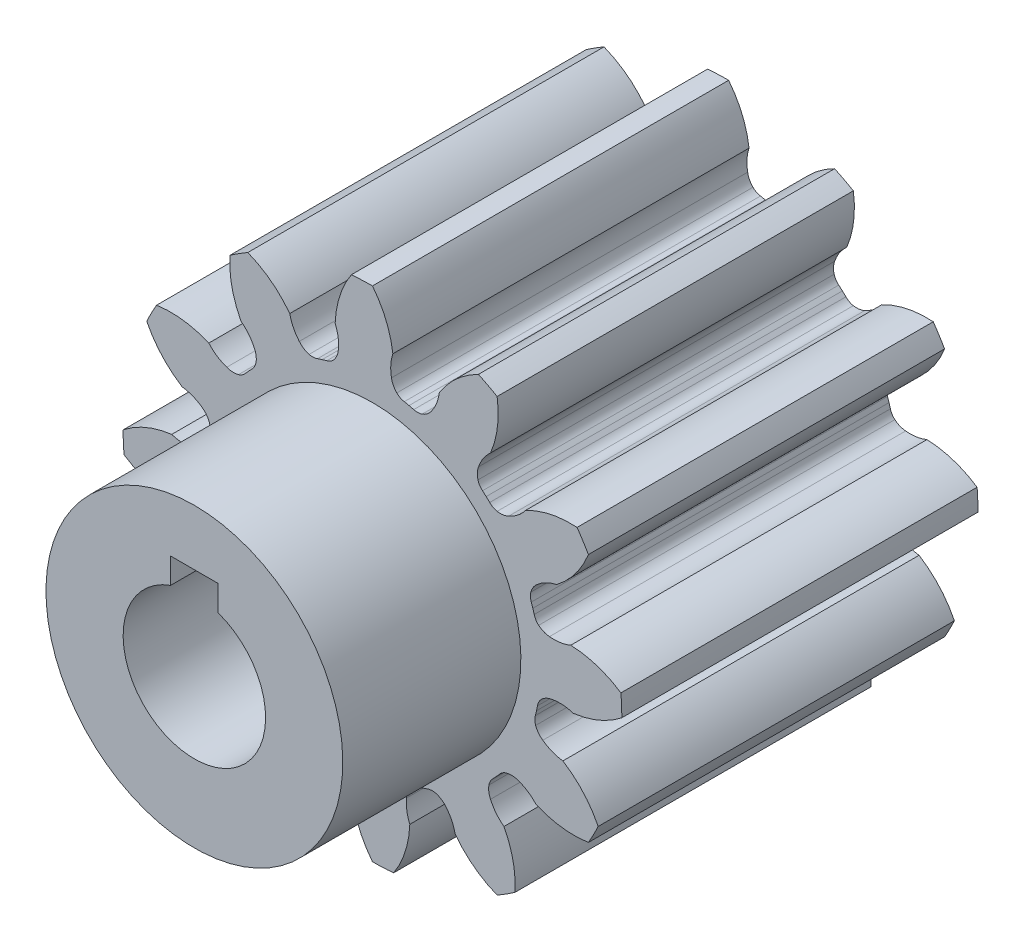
ISO-10303-21;
HEADER;
FILE_DESCRIPTION(('STEP AP214'),'2;1');
FILE_NAME('part.step','',(''),(''),'','','');
FILE_SCHEMA(('AUTOMOTIVE_DESIGN { 1 0 10303 214 1 1 1 1 }'));
ENDSEC;
DATA;
#1=APPLICATION_CONTEXT('core data for automotive mechanical design processes');
#2=APPLICATION_PROTOCOL_DEFINITION('international standard','automotive_design',2000,#1);
#3=PRODUCT_CONTEXT('',#1,'mechanical');
#4=PRODUCT('Part','Part','',(#3));
#5=PRODUCT_RELATED_PRODUCT_CATEGORY('part','',(#4));
#6=PRODUCT_DEFINITION_FORMATION('','',#4);
#7=PRODUCT_DEFINITION_CONTEXT('part definition',#1,'design');
#8=PRODUCT_DEFINITION('design','',#6,#7);
#9=PRODUCT_DEFINITION_SHAPE('','',#8);
#10=(LENGTH_UNIT() NAMED_UNIT(*) SI_UNIT(.MILLI.,.METRE.));
#11=(NAMED_UNIT(*) PLANE_ANGLE_UNIT() SI_UNIT($,.RADIAN.));
#12=(NAMED_UNIT(*) SI_UNIT($,.STERADIAN.) SOLID_ANGLE_UNIT());
#13=UNCERTAINTY_MEASURE_WITH_UNIT(LENGTH_MEASURE(1.E-05),#10,'distance_accuracy_value','');
#14=(GEOMETRIC_REPRESENTATION_CONTEXT(3) GLOBAL_UNCERTAINTY_ASSIGNED_CONTEXT((#13)) GLOBAL_UNIT_ASSIGNED_CONTEXT((#10,
#11,#12)) REPRESENTATION_CONTEXT('',''));
#15=CARTESIAN_POINT('',(0.,0.,0.));
#16=DIRECTION('',(0.,0.,1.));
#17=DIRECTION('',(1.,0.,0.));
#18=AXIS2_PLACEMENT_3D('',#15,#16,#17);
#19=CARTESIAN_POINT('',(0.,0.,0.));
#20=DIRECTION('',(0.,0.,-1.));
#21=DIRECTION('',(0.,1.,0.));
#22=AXIS2_PLACEMENT_3D('',#19,#20,#21);
#23=CYLINDRICAL_SURFACE('',#22,21.);
#24=CARTESIAN_POINT('',(0.,0.,30.));
#25=DIRECTION('',(0.,0.,-1.));
#26=DIRECTION('',(0.,1.,0.));
#27=AXIS2_PLACEMENT_3D('',#24,#25,#26);
#28=CIRCLE('',#27,21.);
#29=CARTESIAN_POINT('',(-20.9244863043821,-1.77928999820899,30.));
#30=VERTEX_POINT('',#29);
#31=CARTESIAN_POINT('',(-21.,0.,30.));
#32=VERTEX_POINT('',#31);
#33=EDGE_CURVE('E867',#30,#32,#28,.T.);
#34=ORIENTED_EDGE('',*,*,#33,.T.);
#35=DIRECTION('',(0.,0.,-1.));
#36=VECTOR('',#35,1.);
#37=CARTESIAN_POINT('',(-21.,0.,22.5));
#38=LINE('',#37,#36);
#39=CARTESIAN_POINT('',(-21.,0.,0.));
#40=VERTEX_POINT('',#39);
#41=EDGE_CURVE('E850',#32,#40,#38,.T.);
#42=ORIENTED_EDGE('',*,*,#41,.T.);
#43=CARTESIAN_POINT('',(0.,0.,0.));
#44=DIRECTION('',(0.,0.,-1.));
#45=DIRECTION('',(0.,1.,0.));
#46=AXIS2_PLACEMENT_3D('',#43,#44,#45);
#47=CIRCLE('',#46,21.);
#48=CARTESIAN_POINT('',(-20.9244863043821,-1.77928999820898,0.));
#49=VERTEX_POINT('',#48);
#50=EDGE_CURVE('E865',#49,#40,#47,.T.);
#51=ORIENTED_EDGE('',*,*,#50,.F.);
#52=DIRECTION('',(0.,0.,-1.));
#53=VECTOR('',#52,1.);
#54=CARTESIAN_POINT('',(-20.9244863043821,-1.77928999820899,22.5));
#55=LINE('',#54,#53);
#56=EDGE_CURVE('E904',#49,#30,#55,.F.);
#57=ORIENTED_EDGE('',*,*,#56,.T.);
#58=EDGE_LOOP('',(#34,#42,#51,#57));
#59=FACE_BOUND('',#58,.T.);
#60=ADVANCED_FACE('F14',(#59),#23,.T.);
#61=CARTESIAN_POINT('',(-19.0107816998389,8.92133281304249,0.));
#62=VERTEX_POINT('',#61);
#63=CARTESIAN_POINT('',(-18.1865334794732,10.5,0.));
#64=VERTEX_POINT('',#63);
#65=EDGE_CURVE('E877',#62,#64,#47,.T.);
#66=ORIENTED_EDGE('',*,*,#65,.F.);
#67=DIRECTION('',(0.,0.,-1.));
#68=VECTOR('',#67,1.);
#69=CARTESIAN_POINT('',(-19.0107816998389,8.92133281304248,22.5));
#70=LINE('',#69,#68);
#71=CARTESIAN_POINT('',(-19.0107816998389,8.92133281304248,30.));
#72=VERTEX_POINT('',#71);
#73=EDGE_CURVE('E869',#62,#72,#70,.F.);
#74=ORIENTED_EDGE('',*,*,#73,.T.);
#75=CARTESIAN_POINT('',(-18.1865334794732,10.5,30.));
#76=VERTEX_POINT('',#75);
#77=EDGE_CURVE('E1736',#72,#76,#28,.T.);
#78=ORIENTED_EDGE('',*,*,#77,.T.);
#79=DIRECTION('',(0.,0.,-1.));
#80=VECTOR('',#79,1.);
#81=CARTESIAN_POINT('',(-18.1865334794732,10.5,22.5));
#82=LINE('',#81,#80);
#83=EDGE_CURVE('E961',#76,#64,#82,.T.);
#84=ORIENTED_EDGE('',*,*,#83,.T.);
#85=EDGE_LOOP('',(#66,#74,#78,#84));
#86=FACE_BOUND('',#85,.T.);
#87=ADVANCED_FACE('F1733',(#86),#23,.T.);
#88=CARTESIAN_POINT('',(-12.0031534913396,17.2314917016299,0.));
#89=VERTEX_POINT('',#88);
#90=CARTESIAN_POINT('',(-10.5,18.1865334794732,0.));
#91=VERTEX_POINT('',#90);
#92=EDGE_CURVE('E882',#89,#91,#47,.T.);
#93=ORIENTED_EDGE('',*,*,#92,.F.);
#94=DIRECTION('',(0.,0.,-1.));
#95=VECTOR('',#94,1.);
#96=CARTESIAN_POINT('',(-12.0031534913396,17.2314917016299,22.5));
#97=LINE('',#96,#95);
#98=CARTESIAN_POINT('',(-12.0031534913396,17.2314917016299,30.));
#99=VERTEX_POINT('',#98);
#100=EDGE_CURVE('E958',#89,#99,#97,.F.);
#101=ORIENTED_EDGE('',*,*,#100,.T.);
#102=CARTESIAN_POINT('',(-10.5,18.1865334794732,30.));
#103=VERTEX_POINT('',#102);
#104=EDGE_CURVE('E2126',#99,#103,#28,.T.);
#105=ORIENTED_EDGE('',*,*,#104,.T.);
#106=DIRECTION('',(0.,0.,-1.));
#107=VECTOR('',#106,1.);
#108=CARTESIAN_POINT('',(-10.5,18.1865334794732,22.5));
#109=LINE('',#108,#107);
#110=EDGE_CURVE('E955',#103,#91,#109,.T.);
#111=ORIENTED_EDGE('',*,*,#110,.T.);
#112=EDGE_LOOP('',(#93,#101,#105,#111));
#113=FACE_BOUND('',#112,.T.);
#114=ADVANCED_FACE('F1784',(#113),#23,.T.);
#115=CARTESIAN_POINT('',(-1.77928999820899,20.9244863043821,0.));
#116=VERTEX_POINT('',#115);
#117=CARTESIAN_POINT('',(0.,21.,0.));
#118=VERTEX_POINT('',#117);
#119=EDGE_CURVE('E1787',#116,#118,#47,.T.);
#120=ORIENTED_EDGE('',*,*,#119,.F.);
#121=DIRECTION('',(0.,0.,-1.));
#122=VECTOR('',#121,1.);
#123=CARTESIAN_POINT('',(-1.77928999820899,20.9244863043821,22.5));
#124=LINE('',#123,#122);
#125=CARTESIAN_POINT('',(-1.77928999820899,20.9244863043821,30.));
#126=VERTEX_POINT('',#125);
#127=EDGE_CURVE('E952',#116,#126,#124,.F.);
#128=ORIENTED_EDGE('',*,*,#127,.T.);
#129=CARTESIAN_POINT('',(0.,21.,30.));
#130=VERTEX_POINT('',#129);
#131=EDGE_CURVE('E2127',#126,#130,#28,.T.);
#132=ORIENTED_EDGE('',*,*,#131,.T.);
#133=DIRECTION('',(0.,0.,-1.));
#134=VECTOR('',#133,1.);
#135=CARTESIAN_POINT('',(0.,21.,22.5));
#136=LINE('',#135,#134);
#137=EDGE_CURVE('E949',#130,#118,#136,.T.);
#138=ORIENTED_EDGE('',*,*,#137,.T.);
#139=EDGE_LOOP('',(#120,#128,#132,#138));
#140=FACE_BOUND('',#139,.T.);
#141=ADVANCED_FACE('F2702',(#140),#23,.T.);
#142=CARTESIAN_POINT('',(8.9213328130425,19.0107816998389,0.));
#143=VERTEX_POINT('',#142);
#144=CARTESIAN_POINT('',(10.5,18.1865334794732,0.));
#145=VERTEX_POINT('',#144);
#146=EDGE_CURVE('E1789',#143,#145,#47,.T.);
#147=ORIENTED_EDGE('',*,*,#146,.F.);
#148=DIRECTION('',(0.,0.,-1.));
#149=VECTOR('',#148,1.);
#150=CARTESIAN_POINT('',(8.9213328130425,19.0107816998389,22.5));
#151=LINE('',#150,#149);
#152=CARTESIAN_POINT('',(8.9213328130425,19.0107816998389,30.));
#153=VERTEX_POINT('',#152);
#154=EDGE_CURVE('E946',#143,#153,#151,.F.);
#155=ORIENTED_EDGE('',*,*,#154,.T.);
#156=CARTESIAN_POINT('',(10.5,18.1865334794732,30.));
#157=VERTEX_POINT('',#156);
#158=EDGE_CURVE('E2129',#153,#157,#28,.T.);
#159=ORIENTED_EDGE('',*,*,#158,.T.);
#160=DIRECTION('',(0.,0.,-1.));
#161=VECTOR('',#160,1.);
#162=CARTESIAN_POINT('',(10.5,18.1865334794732,22.5));
#163=LINE('',#162,#161);
#164=EDGE_CURVE('E943',#157,#145,#163,.T.);
#165=ORIENTED_EDGE('',*,*,#164,.T.);
#166=EDGE_LOOP('',(#147,#155,#159,#165));
#167=FACE_BOUND('',#166,.T.);
#168=ADVANCED_FACE('F2135',(#167),#23,.T.);
#169=CARTESIAN_POINT('',(17.2314917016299,12.0031534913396,0.));
#170=VERTEX_POINT('',#169);
#171=CARTESIAN_POINT('',(18.1865334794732,10.5,0.));
#172=VERTEX_POINT('',#171);
#173=EDGE_CURVE('E887',#170,#172,#47,.T.);
#174=ORIENTED_EDGE('',*,*,#173,.F.);
#175=DIRECTION('',(0.,0.,-1.));
#176=VECTOR('',#175,1.);
#177=CARTESIAN_POINT('',(17.2314917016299,12.0031534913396,22.5));
#178=LINE('',#177,#176);
#179=CARTESIAN_POINT('',(17.2314917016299,12.0031534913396,30.));
#180=VERTEX_POINT('',#179);
#181=EDGE_CURVE('E941',#170,#180,#178,.F.);
#182=ORIENTED_EDGE('',*,*,#181,.T.);
#183=CARTESIAN_POINT('',(18.1865334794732,10.5,30.));
#184=VERTEX_POINT('',#183);
#185=EDGE_CURVE('E894',#180,#184,#28,.T.);
#186=ORIENTED_EDGE('',*,*,#185,.T.);
#187=DIRECTION('',(0.,0.,-1.));
#188=VECTOR('',#187,1.);
#189=CARTESIAN_POINT('',(18.1865334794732,10.5,22.5));
#190=LINE('',#189,#188);
#191=EDGE_CURVE('E938',#184,#172,#190,.T.);
#192=ORIENTED_EDGE('',*,*,#191,.T.);
#193=EDGE_LOOP('',(#174,#182,#186,#192));
#194=FACE_BOUND('',#193,.T.);
#195=ADVANCED_FACE('F1802',(#194),#23,.T.);
#196=CARTESIAN_POINT('',(19.0107816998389,-8.9213328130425,0.));
#197=VERTEX_POINT('',#196);
#198=CARTESIAN_POINT('',(18.1865334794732,-10.5,0.));
#199=VERTEX_POINT('',#198);
#200=EDGE_CURVE('E889',#197,#199,#47,.T.);
#201=ORIENTED_EDGE('',*,*,#200,.F.);
#202=DIRECTION('',(0.,0.,-1.));
#203=VECTOR('',#202,1.);
#204=CARTESIAN_POINT('',(19.0107816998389,-8.9213328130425,22.5));
#205=LINE('',#204,#203);
#206=CARTESIAN_POINT('',(19.0107816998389,-8.9213328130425,30.));
#207=VERTEX_POINT('',#206);
#208=EDGE_CURVE('E933',#197,#207,#205,.F.);
#209=ORIENTED_EDGE('',*,*,#208,.T.);
#210=CARTESIAN_POINT('',(18.1865334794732,-10.5,30.));
#211=VERTEX_POINT('',#210);
#212=EDGE_CURVE('E895',#207,#211,#28,.T.);
#213=ORIENTED_EDGE('',*,*,#212,.T.);
#214=DIRECTION('',(0.,0.,-1.));
#215=VECTOR('',#214,1.);
#216=CARTESIAN_POINT('',(18.1865334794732,-10.5,22.5));
#217=LINE('',#216,#215);
#218=EDGE_CURVE('E930',#211,#199,#217,.T.);
#219=ORIENTED_EDGE('',*,*,#218,.T.);
#220=EDGE_LOOP('',(#201,#209,#213,#219));
#221=FACE_BOUND('',#220,.T.);
#222=ADVANCED_FACE('F2063',(#221),#23,.T.);
#223=CARTESIAN_POINT('',(12.0031534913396,-17.2314917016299,0.));
#224=VERTEX_POINT('',#223);
#225=CARTESIAN_POINT('',(10.5,-18.1865334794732,0.));
#226=VERTEX_POINT('',#225);
#227=EDGE_CURVE('E2066',#224,#226,#47,.T.);
#228=ORIENTED_EDGE('',*,*,#227,.F.);
#229=DIRECTION('',(0.,0.,-1.));
#230=VECTOR('',#229,1.);
#231=CARTESIAN_POINT('',(12.0031534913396,-17.2314917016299,22.5));
#232=LINE('',#231,#230);
#233=CARTESIAN_POINT('',(12.0031534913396,-17.2314917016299,30.));
#234=VERTEX_POINT('',#233);
#235=EDGE_CURVE('E927',#224,#234,#232,.F.);
#236=ORIENTED_EDGE('',*,*,#235,.T.);
#237=CARTESIAN_POINT('',(10.5,-18.1865334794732,30.));
#238=VERTEX_POINT('',#237);
#239=EDGE_CURVE('E3435',#234,#238,#28,.T.);
#240=ORIENTED_EDGE('',*,*,#239,.T.);
#241=DIRECTION('',(0.,0.,-1.));
#242=VECTOR('',#241,1.);
#243=CARTESIAN_POINT('',(10.5,-18.1865334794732,22.5));
#244=LINE('',#243,#242);
#245=EDGE_CURVE('E924',#238,#226,#244,.T.);
#246=ORIENTED_EDGE('',*,*,#245,.T.);
#247=EDGE_LOOP('',(#228,#236,#240,#246));
#248=FACE_BOUND('',#247,.T.);
#249=ADVANCED_FACE('F2767',(#248),#23,.T.);
#250=CARTESIAN_POINT('',(1.77928999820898,-20.9244863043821,0.));
#251=VERTEX_POINT('',#250);
#252=CARTESIAN_POINT('',(0.,-21.,0.));
#253=VERTEX_POINT('',#252);
#254=EDGE_CURVE('E2068',#251,#253,#47,.T.);
#255=ORIENTED_EDGE('',*,*,#254,.F.);
#256=DIRECTION('',(0.,0.,-1.));
#257=VECTOR('',#256,1.);
#258=CARTESIAN_POINT('',(1.77928999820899,-20.9244863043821,22.5));
#259=LINE('',#258,#257);
#260=CARTESIAN_POINT('',(1.77928999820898,-20.9244863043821,30.));
#261=VERTEX_POINT('',#260);
#262=EDGE_CURVE('E921',#251,#261,#259,.F.);
#263=ORIENTED_EDGE('',*,*,#262,.T.);
#264=CARTESIAN_POINT('',(0.,-21.,30.));
#265=VERTEX_POINT('',#264);
#266=EDGE_CURVE('E2125',#261,#265,#28,.T.);
#267=ORIENTED_EDGE('',*,*,#266,.T.);
#268=DIRECTION('',(0.,0.,-1.));
#269=VECTOR('',#268,1.);
#270=CARTESIAN_POINT('',(0.,-21.,22.5));
#271=LINE('',#270,#269);
#272=EDGE_CURVE('E918',#265,#253,#271,.T.);
#273=ORIENTED_EDGE('',*,*,#272,.T.);
#274=EDGE_LOOP('',(#255,#263,#267,#273));
#275=FACE_BOUND('',#274,.T.);
#276=ADVANCED_FACE('F1882',(#275),#23,.T.);
#277=CARTESIAN_POINT('',(-8.9213328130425,-19.0107816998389,0.));
#278=VERTEX_POINT('',#277);
#279=CARTESIAN_POINT('',(-10.5,-18.1865334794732,0.));
#280=VERTEX_POINT('',#279);
#281=EDGE_CURVE('E880',#278,#280,#47,.T.);
#282=ORIENTED_EDGE('',*,*,#281,.F.);
#283=DIRECTION('',(0.,0.,-1.));
#284=VECTOR('',#283,1.);
#285=CARTESIAN_POINT('',(-8.92133281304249,-19.0107816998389,22.5));
#286=LINE('',#285,#284);
#287=CARTESIAN_POINT('',(-8.92133281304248,-19.0107816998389,30.));
#288=VERTEX_POINT('',#287);
#289=EDGE_CURVE('E915',#278,#288,#286,.F.);
#290=ORIENTED_EDGE('',*,*,#289,.T.);
#291=CARTESIAN_POINT('',(-10.5,-18.1865334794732,30.));
#292=VERTEX_POINT('',#291);
#293=EDGE_CURVE('E2082',#288,#292,#28,.T.);
#294=ORIENTED_EDGE('',*,*,#293,.T.);
#295=DIRECTION('',(0.,0.,-1.));
#296=VECTOR('',#295,1.);
#297=CARTESIAN_POINT('',(-10.5,-18.1865334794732,22.5));
#298=LINE('',#297,#296);
#299=EDGE_CURVE('E912',#292,#280,#298,.T.);
#300=ORIENTED_EDGE('',*,*,#299,.T.);
#301=EDGE_LOOP('',(#282,#290,#294,#300));
#302=FACE_BOUND('',#301,.T.);
#303=ADVANCED_FACE('F1875',(#302),#23,.T.);
#304=CARTESIAN_POINT('',(-17.2314917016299,-12.0031534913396,0.));
#305=VERTEX_POINT('',#304);
#306=CARTESIAN_POINT('',(-18.1865334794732,-10.5,0.));
#307=VERTEX_POINT('',#306);
#308=EDGE_CURVE('E876',#305,#307,#47,.T.);
#309=ORIENTED_EDGE('',*,*,#308,.F.);
#310=DIRECTION('',(0.,0.,-1.));
#311=VECTOR('',#310,1.);
#312=CARTESIAN_POINT('',(-17.2314917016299,-12.0031534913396,22.5));
#313=LINE('',#312,#311);
#314=CARTESIAN_POINT('',(-17.2314917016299,-12.0031534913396,30.));
#315=VERTEX_POINT('',#314);
#316=EDGE_CURVE('E909',#305,#315,#313,.F.);
#317=ORIENTED_EDGE('',*,*,#316,.T.);
#318=CARTESIAN_POINT('',(-18.1865334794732,-10.5,30.));
#319=VERTEX_POINT('',#318);
#320=EDGE_CURVE('E2123',#315,#319,#28,.T.);
#321=ORIENTED_EDGE('',*,*,#320,.T.);
#322=DIRECTION('',(0.,0.,-1.));
#323=VECTOR('',#322,1.);
#324=CARTESIAN_POINT('',(-18.1865334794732,-10.5,22.5));
#325=LINE('',#324,#323);
#326=EDGE_CURVE('E906',#319,#307,#325,.T.);
#327=ORIENTED_EDGE('',*,*,#326,.T.);
#328=EDGE_LOOP('',(#309,#317,#321,#327));
#329=FACE_BOUND('',#328,.T.);
#330=ADVANCED_FACE('F1866',(#329),#23,.T.);
#331=CARTESIAN_POINT('',(0.,0.,45.));
#332=DIRECTION('',(0.,0.,-1.));
#333=DIRECTION('',(0.,1.,0.));
#334=AXIS2_PLACEMENT_3D('',#331,#332,#333);
#335=PLANE('',#334);
#336=CARTESIAN_POINT('',(0.,0.,45.));
#337=DIRECTION('',(0.,0.,-1.));
#338=DIRECTION('',(0.,1.,0.));
#339=AXIS2_PLACEMENT_3D('',#336,#337,#338);
#340=CIRCLE('',#339,12.5);
#341=CARTESIAN_POINT('',(0.,12.5,45.));
#342=VERTEX_POINT('',#341);
#343=EDGE_CURVE('E899',#342,#342,#340,.T.);
#344=ORIENTED_EDGE('',*,*,#343,.F.);
#345=EDGE_LOOP('',(#344));
#346=FACE_BOUND('',#345,.T.);
#347=DIRECTION('',(0.,-1.,0.));
#348=VECTOR('',#347,1.);
#349=CARTESIAN_POINT('',(-2.,7.8,45.));
#350=LINE('',#349,#348);
#351=CARTESIAN_POINT('',(-2.,7.8,45.));
#352=VERTEX_POINT('',#351);
#353=CARTESIAN_POINT('',(-2.,5.65685424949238,45.));
#354=VERTEX_POINT('',#353);
#355=EDGE_CURVE('E1487',#352,#354,#350,.T.);
#356=ORIENTED_EDGE('',*,*,#355,.F.);
#357=DIRECTION('',(-1.,0.,0.));
#358=VECTOR('',#357,1.);
#359=CARTESIAN_POINT('',(2.,7.8,45.));
#360=LINE('',#359,#358);
#361=CARTESIAN_POINT('',(2.,7.8,45.));
#362=VERTEX_POINT('',#361);
#363=EDGE_CURVE('E1495',#362,#352,#360,.T.);
#364=ORIENTED_EDGE('',*,*,#363,.F.);
#365=DIRECTION('',(0.,1.,0.));
#366=VECTOR('',#365,1.);
#367=CARTESIAN_POINT('',(2.,5.65685424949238,45.));
#368=LINE('',#367,#366);
#369=CARTESIAN_POINT('',(2.,5.65685424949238,45.));
#370=VERTEX_POINT('',#369);
#371=EDGE_CURVE('E1492',#370,#362,#368,.T.);
#372=ORIENTED_EDGE('',*,*,#371,.F.);
#373=CARTESIAN_POINT('',(0.,0.,45.));
#374=DIRECTION('',(0.,0.,1.));
#375=DIRECTION('',(1.,0.,0.));
#376=AXIS2_PLACEMENT_3D('',#373,#374,#375);
#377=CIRCLE('',#376,6.);
#378=EDGE_CURVE('E1489',#354,#370,#377,.T.);
#379=ORIENTED_EDGE('',*,*,#378,.F.);
#380=EDGE_LOOP('',(#356,#364,#372,#379));
#381=FACE_BOUND('',#380,.T.);
#382=ADVANCED_FACE('F16',(#346,#381),#335,.F.);
#383=CARTESIAN_POINT('',(21.,0.,0.));
#384=DIRECTION('',(0.,0.,1.));
#385=DIRECTION('',(0.,-1.,0.));
#386=AXIS2_PLACEMENT_3D('',#383,#384,#385);
#387=PLANE('',#386);
#388=DIRECTION('',(0.,-1.,0.));
#389=VECTOR('',#388,1.);
#390=CARTESIAN_POINT('',(-2.,7.8,0.));
#391=LINE('',#390,#389);
#392=CARTESIAN_POINT('',(-2.,7.8,0.));
#393=VERTEX_POINT('',#392);
#394=CARTESIAN_POINT('',(-2.,5.65685424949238,0.));
#395=VERTEX_POINT('',#394);
#396=EDGE_CURVE('E1486',#393,#395,#391,.T.);
#397=ORIENTED_EDGE('',*,*,#396,.T.);
#398=CARTESIAN_POINT('',(0.,0.,0.));
#399=DIRECTION('',(0.,0.,1.));
#400=DIRECTION('',(0.,-1.,0.));
#401=AXIS2_PLACEMENT_3D('',#398,#399,#400);
#402=CIRCLE('',#401,6.);
#403=CARTESIAN_POINT('',(2.,5.65685424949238,0.));
#404=VERTEX_POINT('',#403);
#405=EDGE_CURVE('E902',#404,#395,#402,.F.);
#406=ORIENTED_EDGE('',*,*,#405,.F.);
#407=DIRECTION('',(0.,1.,0.));
#408=VECTOR('',#407,1.);
#409=CARTESIAN_POINT('',(2.,5.65685424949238,0.));
#410=LINE('',#409,#408);
#411=CARTESIAN_POINT('',(2.,7.8,0.));
#412=VERTEX_POINT('',#411);
#413=EDGE_CURVE('E1500',#404,#412,#410,.T.);
#414=ORIENTED_EDGE('',*,*,#413,.T.);
#415=DIRECTION('',(-1.,0.,0.));
#416=VECTOR('',#415,1.);
#417=CARTESIAN_POINT('',(2.,7.8,0.));
#418=LINE('',#417,#416);
#419=EDGE_CURVE('E1490',#412,#393,#418,.T.);
#420=ORIENTED_EDGE('',*,*,#419,.T.);
#421=EDGE_LOOP('',(#397,#406,#414,#420));
#422=FACE_BOUND('',#421,.T.);
#423=ORIENTED_EDGE('',*,*,#50,.T.);
#424=CARTESIAN_POINT('',(-15.9249276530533,-6.36293656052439,0.));
#425=DIRECTION('',(0.,0.,1.));
#426=DIRECTION('',(1.,0.,0.));
#427=AXIS2_PLACEMENT_3D('',#424,#425,#426);
#428=CIRCLE('',#427,8.139);
#429=CARTESIAN_POINT('',(-16.9079010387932,1.71648695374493,0.));
#430=VERTEX_POINT('',#429);
#431=EDGE_CURVE('E847',#430,#40,#428,.T.);
#432=ORIENTED_EDGE('',*,*,#431,.F.);
#433=CARTESIAN_POINT('',(-15.7780768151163,5.12722678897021,0.));
#434=DIRECTION('',(0.,0.,1.));
#435=DIRECTION('',(1.,0.,0.));
#436=AXIS2_PLACEMENT_3D('',#433,#434,#435);
#437=CIRCLE('',#436,3.593);
#438=CARTESIAN_POINT('',(-15.0964940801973,1.59946631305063,0.));
#439=VERTEX_POINT('',#438);
#440=EDGE_CURVE('E859',#430,#439,#437,.T.);
#441=ORIENTED_EDGE('',*,*,#440,.T.);
#442=CARTESIAN_POINT('',(-15.364951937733,3.20720708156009,0.));
#443=DIRECTION('',(0.,0.,1.));
#444=DIRECTION('',(1.,0.,0.));
#445=AXIS2_PLACEMENT_3D('',#442,#443,#444);
#446=CIRCLE('',#445,1.63);
#447=CARTESIAN_POINT('',(-14.2198183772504,2.04722038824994,0.));
#448=VERTEX_POINT('',#447);
#449=EDGE_CURVE('E1708',#439,#448,#446,.T.);
#450=ORIENTED_EDGE('',*,*,#449,.T.);
#451=CARTESIAN_POINT('',(-15.0648262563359,2.87371036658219,0.));
#452=DIRECTION('',(0.,0.,1.));
#453=DIRECTION('',(1.,0.,0.));
#454=AXIS2_PLACEMENT_3D('',#451,#452,#453);
#455=CIRCLE('',#454,1.182);
#456=CARTESIAN_POINT('',(-13.8988185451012,2.67993209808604,0.));
#457=VERTEX_POINT('',#456);
#458=EDGE_CURVE('E1192',#448,#457,#455,.T.);
#459=ORIENTED_EDGE('',*,*,#458,.T.);
#460=DIRECTION('',(-0.202971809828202,-0.979184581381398,0.));
#461=VECTOR('',#460,1.);
#462=CARTESIAN_POINT('',(-13.8157740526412,3.08055860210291,0.));
#463=LINE('',#462,#461);
#464=CARTESIAN_POINT('',(-13.8157740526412,3.08055860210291,0.));
#465=VERTEX_POINT('',#464);
#466=EDGE_CURVE('E1705',#465,#457,#463,.T.);
#467=ORIENTED_EDGE('',*,*,#466,.F.);
#468=DIRECTION('',(-0.231295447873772,-0.972883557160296,0.));
#469=VECTOR('',#468,1.);
#470=CARTESIAN_POINT('',(-13.7210470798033,3.47900273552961,0.));
#471=LINE('',#470,#469);
#472=CARTESIAN_POINT('',(-13.7210470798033,3.47900273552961,0.));
#473=VERTEX_POINT('',#472);
#474=EDGE_CURVE('E1210',#473,#465,#471,.T.);
#475=ORIENTED_EDGE('',*,*,#474,.F.);
#476=CARTESIAN_POINT('',(-14.8588869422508,3.79907217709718,0.));
#477=DIRECTION('',(0.,0.,1.));
#478=DIRECTION('',(1.,0.,0.));
#479=AXIS2_PLACEMENT_3D('',#476,#477,#478);
#480=CIRCLE('',#479,1.18199999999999);
#481=CARTESIAN_POINT('',(-13.7426369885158,4.1878009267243,0.));
#482=VERTEX_POINT('',#481);
#483=EDGE_CURVE('E1701',#473,#482,#480,.T.);
#484=ORIENTED_EDGE('',*,*,#483,.T.);
#485=CARTESIAN_POINT('',(-15.2715714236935,3.62277040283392,0.));
#486=DIRECTION('',(0.,0.,1.));
#487=DIRECTION('',(1.,0.,0.));
#488=AXIS2_PLACEMENT_3D('',#485,#486,#487);
#489=CIRCLE('',#488,1.62999999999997);
#490=CARTESIAN_POINT('',(-14.3463272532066,4.96471795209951,0.));
#491=VERTEX_POINT('',#490);
#492=EDGE_CURVE('E1698',#482,#491,#489,.T.);
#493=ORIENTED_EDGE('',*,*,#492,.T.);
#494=CARTESIAN_POINT('',(-16.4628775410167,2.06129516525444,0.));
#495=DIRECTION('',(0.,0.,1.));
#496=DIRECTION('',(1.,0.,0.));
#497=AXIS2_PLACEMENT_3D('',#494,#495,#496);
#498=CIRCLE('',#497,3.593);
#499=CARTESIAN_POINT('',(-16.0353125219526,5.62876445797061,0.));
#500=VERTEX_POINT('',#499);
#501=EDGE_CURVE('E1695',#491,#500,#498,.T.);
#502=ORIENTED_EDGE('',*,*,#501,.T.);
#503=CARTESIAN_POINT('',(-11.7132196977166,12.5253458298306,0.));
#504=DIRECTION('',(0.,0.,1.));
#505=DIRECTION('',(1.,0.,0.));
#506=AXIS2_PLACEMENT_3D('',#503,#504,#505);
#507=CIRCLE('',#506,8.139);
#508=EDGE_CURVE('E1692',#62,#500,#507,.T.);
#509=ORIENTED_EDGE('',*,*,#508,.F.);
#510=ORIENTED_EDGE('',*,*,#65,.T.);
#511=CARTESIAN_POINT('',(-16.9728601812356,2.45199912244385,0.));
#512=DIRECTION('',(0.,0.,1.));
#513=DIRECTION('',(1.,0.,0.));
#514=AXIS2_PLACEMENT_3D('',#511,#512,#513);
#515=CIRCLE('',#514,8.139);
#516=CARTESIAN_POINT('',(-13.7844283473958,9.94047182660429,0.));
#517=VERTEX_POINT('',#516);
#518=EDGE_CURVE('E1690',#517,#64,#515,.T.);
#519=ORIENTED_EDGE('',*,*,#518,.F.);
#520=CARTESIAN_POINT('',(-11.1006019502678,12.3293470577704,0.));
#521=DIRECTION('',(0.,0.,1.));
#522=DIRECTION('',(1.,0.,0.));
#523=AXIS2_PLACEMENT_3D('',#520,#521,#522);
#524=CIRCLE('',#523,3.593);
#525=CARTESIAN_POINT('',(-12.274214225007,8.93342549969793,0.));
#526=VERTEX_POINT('',#525);
#527=EDGE_CURVE('E1687',#517,#526,#524,.T.);
#528=ORIENTED_EDGE('',*,*,#527,.T.);
#529=CARTESIAN_POINT('',(-11.7028351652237,10.4599987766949,0.));
#530=DIRECTION('',(0.,0.,1.));
#531=DIRECTION('',(1.,0.,0.));
#532=AXIS2_PLACEMENT_3D('',#529,#530,#531);
#533=CIRCLE('',#532,1.63000000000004);
#534=CARTESIAN_POINT('',(-11.2911137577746,8.88285405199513,0.));
#535=VERTEX_POINT('',#534);
#536=EDGE_CURVE('E1684',#526,#535,#533,.T.);
#537=ORIENTED_EDGE('',*,*,#536,.T.);
#538=CARTESIAN_POINT('',(-11.6096670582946,10.0211193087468,0.));
#539=DIRECTION('',(0.,0.,1.));
#540=DIRECTION('',(1.,0.,0.));
#541=AXIS2_PLACEMENT_3D('',#538,#539,#540);
#542=CIRCLE('',#541,1.18200000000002);
#543=CARTESIAN_POINT('',(-10.6967638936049,9.27029854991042,0.));
#544=VERTEX_POINT('',#543);
#545=EDGE_CURVE('E1681',#535,#544,#542,.T.);
#546=ORIENTED_EDGE('',*,*,#545,.T.);
#547=DIRECTION('',(-0.66537103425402,-0.746512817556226,0.));
#548=VECTOR('',#547,1.);
#549=CARTESIAN_POINT('',(-10.4245320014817,9.5757290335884,0.));
#550=LINE('',#549,#548);
#551=CARTESIAN_POINT('',(-10.4245320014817,9.5757290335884,0.));
#552=VERTEX_POINT('',#551);
#553=EDGE_CURVE('E1678',#552,#544,#550,.T.);
#554=ORIENTED_EDGE('',*,*,#553,.F.);
#555=DIRECTION('',(-0.686749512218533,-0.726894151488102,0.));
#556=VECTOR('',#555,1.);
#557=CARTESIAN_POINT('',(-10.1432739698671,9.87342828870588,0.));
#558=LINE('',#557,#556);
#559=CARTESIAN_POINT('',(-10.1432739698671,9.87342828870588,0.));
#560=VERTEX_POINT('',#559);
#561=EDGE_CURVE('E1675',#560,#552,#558,.T.);
#562=ORIENTED_EDGE('',*,*,#561,.F.);
#563=CARTESIAN_POINT('',(-10.9686374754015,10.7195364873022,0.));
#564=DIRECTION('',(0.,0.,1.));
#565=DIRECTION('',(1.,0.,0.));
#566=AXIS2_PLACEMENT_3D('',#563,#564,#565);
#567=CIRCLE('',#566,1.182);
#568=CARTESIAN_POINT('',(-9.80757228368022,10.4980604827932,0.));
#569=VERTEX_POINT('',#568);
#570=EDGE_CURVE('E1672',#560,#569,#567,.T.);
#571=ORIENTED_EDGE('',*,*,#570,.T.);
#572=CARTESIAN_POINT('',(-11.4141836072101,10.7731969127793,0.));
#573=DIRECTION('',(0.,0.,1.));
#574=DIRECTION('',(1.,0.,0.));
#575=AXIS2_PLACEMENT_3D('',#572,#573,#574);
#576=CIRCLE('',#575,1.63);
#577=CARTESIAN_POINT('',(-9.94192487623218,11.4727354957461,0.));
#578=VERTEX_POINT('',#577);
#579=EDGE_CURVE('E1669',#569,#578,#576,.T.);
#580=ORIENTED_EDGE('',*,*,#579,.T.);
#581=CARTESIAN_POINT('',(-13.2266225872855,10.0165727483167,0.));
#582=DIRECTION('',(0.,0.,1.));
#583=DIRECTION('',(1.,0.,0.));
#584=AXIS2_PLACEMENT_3D('',#581,#582,#583);
#585=CIRCLE('',#584,3.593);
#586=CARTESIAN_POINT('',(-11.0726057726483,12.8923092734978,0.));
#587=VERTEX_POINT('',#586);
#588=EDGE_CURVE('E1666',#578,#587,#585,.T.);
#589=ORIENTED_EDGE('',*,*,#588,.T.);
#590=CARTESIAN_POINT('',(-3.88127290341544,16.7038775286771,0.));
#591=DIRECTION('',(0.,0.,1.));
#592=DIRECTION('',(1.,0.,0.));
#593=AXIS2_PLACEMENT_3D('',#590,#591,#592);
#594=CIRCLE('',#593,8.139);
#595=EDGE_CURVE('E1663',#89,#587,#594,.T.);
#596=ORIENTED_EDGE('',*,*,#595,.F.);
#597=ORIENTED_EDGE('',*,*,#92,.T.);
#598=CARTESIAN_POINT('',(-13.4729285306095,10.6099236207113,0.));
#599=DIRECTION('',(0.,0.,1.));
#600=DIRECTION('',(1.,0.,0.));
#601=AXIS2_PLACEMENT_3D('',#598,#599,#600);
#602=CIRCLE('',#601,8.139);
#603=CARTESIAN_POINT('',(-6.96742921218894,15.5009153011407,0.));
#604=VERTEX_POINT('',#603);
#605=EDGE_CURVE('E1661',#604,#91,#602,.T.);
#606=ORIENTED_EDGE('',*,*,#605,.F.);
#607=CARTESIAN_POINT('',(-3.44872975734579,16.2278287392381,0.));
#608=DIRECTION('',(0.,0.,1.));
#609=DIRECTION('',(1.,0.,0.));
#610=AXIS2_PLACEMENT_3D('',#607,#608,#609);
#611=CIRCLE('',#610,3.593);
#612=CARTESIAN_POINT('',(-6.16306858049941,13.8736805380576,0.));
#613=VERTEX_POINT('',#612);
#614=EDGE_CURVE('E1658',#604,#613,#611,.T.);
#615=ORIENTED_EDGE('',*,*,#614,.T.);
#616=CARTESIAN_POINT('',(-4.9049531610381,14.9100422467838,0.));
#617=DIRECTION('',(0.,0.,1.));
#618=DIRECTION('',(1.,0.,0.));
#619=AXIS2_PLACEMENT_3D('',#616,#617,#618);
#620=CIRCLE('',#619,1.63000000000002);
#621=CARTESIAN_POINT('',(-5.33696432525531,13.3383341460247,0.));
#622=VERTEX_POINT('',#621);
#623=EDGE_CURVE('E1655',#613,#622,#620,.T.);
#624=ORIENTED_EDGE('',*,*,#623,.T.);
#625=CARTESIAN_POINT('',(-5.04370694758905,14.4833774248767,0.));
#626=DIRECTION('',(0.,0.,1.));
#627=DIRECTION('',(1.,0.,0.));
#628=AXIS2_PLACEMENT_3D('',#625,#626,#627);
#629=CIRCLE('',#628,1.18199999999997);
#630=CARTESIAN_POINT('',(-4.62851999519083,13.3766959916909,0.));
#631=VERTEX_POINT('',#630);
#632=EDGE_CURVE('E1652',#622,#631,#629,.T.);
#633=ORIENTED_EDGE('',*,*,#632,.T.);
#634=DIRECTION('',(-0.949484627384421,-0.313813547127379,0.));
#635=VECTOR('',#634,1.);
#636=CARTESIAN_POINT('',(-4.24004501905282,13.5050906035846,0.));
#637=LINE('',#636,#635);
#638=CARTESIAN_POINT('',(-4.24004501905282,13.5050906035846,0.));
#639=VERTEX_POINT('',#638);
#640=EDGE_CURVE('E1649',#639,#631,#637,.T.);
#641=ORIENTED_EDGE('',*,*,#640,.F.);
#642=DIRECTION('',(-0.958189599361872,-0.286134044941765,0.));
#643=VECTOR('',#642,1.);
#644=CARTESIAN_POINT('',(-3.84761879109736,13.6222767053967,0.));
#645=LINE('',#644,#643);
#646=CARTESIAN_POINT('',(-3.84761879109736,13.6222767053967,0.));
#647=VERTEX_POINT('',#646);
#648=EDGE_CURVE('E1646',#647,#639,#645,.T.);
#649=ORIENTED_EDGE('',*,*,#648,.F.);
#650=CARTESIAN_POINT('',(-4.13935045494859,14.7677096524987,0.));
#651=DIRECTION('',(0.,0.,1.));
#652=DIRECTION('',(1.,0.,0.));
#653=AXIS2_PLACEMENT_3D('',#650,#651,#652);
#654=CIRCLE('',#653,1.182);
#655=CARTESIAN_POINT('',(-3.24457650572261,13.9953732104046,0.));
#656=VERTEX_POINT('',#655);
#657=EDGE_CURVE('E1643',#647,#656,#654,.T.);
#658=ORIENTED_EDGE('',*,*,#657,.T.);
#659=CARTESIAN_POINT('',(-4.49837451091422,15.036954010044,0.));
#660=DIRECTION('',(0.,0.,1.));
#661=DIRECTION('',(1.,0.,0.));
#662=AXIS2_PLACEMENT_3D('',#659,#660,#661);
#663=CIRCLE('',#662,1.63);
#664=CARTESIAN_POINT('',(-2.87359175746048,14.9066428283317,0.));
#665=VERTEX_POINT('',#664);
#666=EDGE_CURVE('E1640',#656,#665,#663,.T.);
#667=ORIENTED_EDGE('',*,*,#666,.T.);
#668=CARTESIAN_POINT('',(-6.44630479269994,15.2879177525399,0.));
#669=DIRECTION('',(0.,0.,1.));
#670=DIRECTION('',(1.,0.,0.));
#671=AXIS2_PLACEMENT_3D('',#668,#669,#670);
#672=CIRCLE('',#671,3.593);
#673=CARTESIAN_POINT('',(-3.14300324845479,16.7013702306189,0.));
#674=VERTEX_POINT('',#673);
#675=EDGE_CURVE('E1637',#665,#674,#672,.T.);
#676=ORIENTED_EDGE('',*,*,#675,.T.);
#677=CARTESIAN_POINT('',(4.99065783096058,16.4066187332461,0.));
#678=DIRECTION('',(0.,0.,1.));
#679=DIRECTION('',(1.,0.,0.));
#680=AXIS2_PLACEMENT_3D('',#677,#678,#679);
#681=CIRCLE('',#680,8.139);
#682=EDGE_CURVE('E1634',#116,#674,#681,.T.);
#683=ORIENTED_EDGE('',*,*,#682,.F.);
#684=ORIENTED_EDGE('',*,*,#119,.T.);
#685=CARTESIAN_POINT('',(-6.36293656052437,15.9249276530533,0.));
#686=DIRECTION('',(0.,0.,1.));
#687=DIRECTION('',(1.,0.,0.));
#688=AXIS2_PLACEMENT_3D('',#685,#686,#687);
#689=CIRCLE('',#688,8.139);
#690=CARTESIAN_POINT('',(1.71648695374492,16.9079010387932,0.));
#691=VERTEX_POINT('',#690);
#692=EDGE_CURVE('E1632',#691,#118,#689,.T.);
#693=ORIENTED_EDGE('',*,*,#692,.F.);
#694=CARTESIAN_POINT('',(5.12722678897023,15.7780768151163,0.));
#695=DIRECTION('',(0.,0.,1.));
#696=DIRECTION('',(1.,0.,0.));
#697=AXIS2_PLACEMENT_3D('',#694,#695,#696);
#698=CIRCLE('',#697,3.593);
#699=CARTESIAN_POINT('',(1.59946631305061,15.0964940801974,0.));
#700=VERTEX_POINT('',#699);
#701=EDGE_CURVE('E1629',#691,#700,#698,.T.);
#702=ORIENTED_EDGE('',*,*,#701,.T.);
#703=CARTESIAN_POINT('',(3.20720708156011,15.364951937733,0.));
#704=DIRECTION('',(0.,0.,1.));
#705=DIRECTION('',(1.,0.,0.));
#706=AXIS2_PLACEMENT_3D('',#703,#704,#705);
#707=CIRCLE('',#706,1.63000000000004);
#708=CARTESIAN_POINT('',(2.04722038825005,14.2198183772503,0.));
#709=VERTEX_POINT('',#708);
#710=EDGE_CURVE('E1626',#700,#709,#707,.T.);
#711=ORIENTED_EDGE('',*,*,#710,.T.);
#712=CARTESIAN_POINT('',(2.87371036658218,15.0648262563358,0.));
#713=DIRECTION('',(0.,0.,1.));
#714=DIRECTION('',(1.,0.,0.));
#715=AXIS2_PLACEMENT_3D('',#712,#713,#714);
#716=CIRCLE('',#715,1.182);
#717=CARTESIAN_POINT('',(2.67993209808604,13.8988185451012,0.));
#718=VERTEX_POINT('',#717);
#719=EDGE_CURVE('E1623',#709,#718,#716,.T.);
#720=ORIENTED_EDGE('',*,*,#719,.T.);
#721=DIRECTION('',(-0.9791845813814,0.202971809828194,0.));
#722=VECTOR('',#721,1.);
#723=CARTESIAN_POINT('',(3.08055860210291,13.8157740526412,0.));
#724=LINE('',#723,#722);
#725=CARTESIAN_POINT('',(3.08055860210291,13.8157740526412,0.));
#726=VERTEX_POINT('',#725);
#727=EDGE_CURVE('E1620',#726,#718,#724,.T.);
#728=ORIENTED_EDGE('',*,*,#727,.F.);
#729=DIRECTION('',(-0.972883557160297,0.23129544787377,0.));
#730=VECTOR('',#729,1.);
#731=CARTESIAN_POINT('',(3.47900273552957,13.7210470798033,0.));
#732=LINE('',#731,#730);
#733=CARTESIAN_POINT('',(3.47900273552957,13.7210470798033,0.));
#734=VERTEX_POINT('',#733);
#735=EDGE_CURVE('E1617',#734,#726,#732,.T.);
#736=ORIENTED_EDGE('',*,*,#735,.F.);
#737=CARTESIAN_POINT('',(3.79907217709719,14.8588869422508,0.));
#738=DIRECTION('',(0.,0.,1.));
#739=DIRECTION('',(1.,0.,0.));
#740=AXIS2_PLACEMENT_3D('',#737,#738,#739);
#741=CIRCLE('',#740,1.182);
#742=CARTESIAN_POINT('',(4.18780092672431,13.7426369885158,0.));
#743=VERTEX_POINT('',#742);
#744=EDGE_CURVE('E1614',#734,#743,#741,.T.);
#745=ORIENTED_EDGE('',*,*,#744,.T.);
#746=CARTESIAN_POINT('',(3.62277040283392,15.2715714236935,0.));
#747=DIRECTION('',(0.,0.,1.));
#748=DIRECTION('',(1.,0.,0.));
#749=AXIS2_PLACEMENT_3D('',#746,#747,#748);
#750=CIRCLE('',#749,1.63);
#751=CARTESIAN_POINT('',(4.96471795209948,14.3463272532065,0.));
#752=VERTEX_POINT('',#751);
#753=EDGE_CURVE('E1611',#743,#752,#750,.T.);
#754=ORIENTED_EDGE('',*,*,#753,.T.);
#755=CARTESIAN_POINT('',(2.06129516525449,16.4628775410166,0.));
#756=DIRECTION('',(0.,0.,1.));
#757=DIRECTION('',(1.,0.,0.));
#758=AXIS2_PLACEMENT_3D('',#755,#756,#757);
#759=CIRCLE('',#758,3.593);
#760=CARTESIAN_POINT('',(5.62876445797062,16.0353125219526,0.));
#761=VERTEX_POINT('',#760);
#762=EDGE_CURVE('E1608',#752,#761,#759,.T.);
#763=ORIENTED_EDGE('',*,*,#762,.T.);
#764=CARTESIAN_POINT('',(12.5253458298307,11.7132196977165,0.));
#765=DIRECTION('',(0.,0.,1.));
#766=DIRECTION('',(1.,0.,0.));
#767=AXIS2_PLACEMENT_3D('',#764,#765,#766);
#768=CIRCLE('',#767,8.139);
#769=EDGE_CURVE('E1605',#143,#761,#768,.T.);
#770=ORIENTED_EDGE('',*,*,#769,.F.);
#771=ORIENTED_EDGE('',*,*,#146,.T.);
#772=CARTESIAN_POINT('',(2.45199912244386,16.9728601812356,0.));
#773=DIRECTION('',(0.,0.,1.));
#774=DIRECTION('',(1.,0.,0.));
#775=AXIS2_PLACEMENT_3D('',#772,#773,#774);
#776=CIRCLE('',#775,8.139);
#777=CARTESIAN_POINT('',(9.9404718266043,13.7844283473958,0.));
#778=VERTEX_POINT('',#777);
#779=EDGE_CURVE('E1603',#778,#145,#776,.T.);
#780=ORIENTED_EDGE('',*,*,#779,.F.);
#781=CARTESIAN_POINT('',(12.3293470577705,11.1006019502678,0.));
#782=DIRECTION('',(0.,0.,1.));
#783=DIRECTION('',(1.,0.,0.));
#784=AXIS2_PLACEMENT_3D('',#781,#782,#783);
#785=CIRCLE('',#784,3.593);
#786=CARTESIAN_POINT('',(8.93342549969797,12.274214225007,0.));
#787=VERTEX_POINT('',#786);
#788=EDGE_CURVE('E1600',#778,#787,#785,.T.);
#789=ORIENTED_EDGE('',*,*,#788,.T.);
#790=CARTESIAN_POINT('',(10.4599987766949,11.7028351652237,0.));
#791=DIRECTION('',(0.,0.,1.));
#792=DIRECTION('',(1.,0.,0.));
#793=AXIS2_PLACEMENT_3D('',#790,#791,#792);
#794=CIRCLE('',#793,1.63000000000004);
#795=CARTESIAN_POINT('',(8.88285405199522,11.2911137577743,0.));
#796=VERTEX_POINT('',#795);
#797=EDGE_CURVE('E1597',#787,#796,#794,.T.);
#798=ORIENTED_EDGE('',*,*,#797,.T.);
#799=CARTESIAN_POINT('',(10.0211193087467,11.6096670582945,0.));
#800=DIRECTION('',(0.,0.,1.));
#801=DIRECTION('',(1.,0.,0.));
#802=AXIS2_PLACEMENT_3D('',#799,#800,#801);
#803=CIRCLE('',#802,1.18199999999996);
#804=CARTESIAN_POINT('',(9.27029854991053,10.6967638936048,0.));
#805=VERTEX_POINT('',#804);
#806=EDGE_CURVE('E1594',#796,#805,#803,.T.);
#807=ORIENTED_EDGE('',*,*,#806,.T.);
#808=DIRECTION('',(-0.746512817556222,0.665371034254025,0.));
#809=VECTOR('',#808,1.);
#810=CARTESIAN_POINT('',(9.5757290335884,10.4245320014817,0.));
#811=LINE('',#810,#809);
#812=CARTESIAN_POINT('',(9.5757290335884,10.4245320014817,0.));
#813=VERTEX_POINT('',#812);
#814=EDGE_CURVE('E1591',#813,#805,#811,.T.);
#815=ORIENTED_EDGE('',*,*,#814,.F.);
#816=DIRECTION('',(-0.726894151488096,0.686749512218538,0.));
#817=VECTOR('',#816,1.);
#818=CARTESIAN_POINT('',(9.87342828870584,10.1432739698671,0.));
#819=LINE('',#818,#817);
#820=CARTESIAN_POINT('',(9.87342828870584,10.1432739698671,0.));
#821=VERTEX_POINT('',#820);
#822=EDGE_CURVE('E1588',#821,#813,#819,.T.);
#823=ORIENTED_EDGE('',*,*,#822,.F.);
#824=CARTESIAN_POINT('',(10.7195364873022,10.9686374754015,0.));
#825=DIRECTION('',(0.,0.,1.));
#826=DIRECTION('',(1.,0.,0.));
#827=AXIS2_PLACEMENT_3D('',#824,#825,#826);
#828=CIRCLE('',#827,1.182);
#829=CARTESIAN_POINT('',(10.4980604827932,9.8075722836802,0.));
#830=VERTEX_POINT('',#829);
#831=EDGE_CURVE('E1585',#821,#830,#828,.T.);
#832=ORIENTED_EDGE('',*,*,#831,.T.);
#833=CARTESIAN_POINT('',(10.7731969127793,11.4141836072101,0.));
#834=DIRECTION('',(0.,0.,1.));
#835=DIRECTION('',(1.,0.,0.));
#836=AXIS2_PLACEMENT_3D('',#833,#834,#835);
#837=CIRCLE('',#836,1.63);
#838=CARTESIAN_POINT('',(11.4727354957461,9.94192487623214,0.));
#839=VERTEX_POINT('',#838);
#840=EDGE_CURVE('E1582',#830,#839,#837,.T.);
#841=ORIENTED_EDGE('',*,*,#840,.T.);
#842=CARTESIAN_POINT('',(10.0165727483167,13.2266225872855,0.));
#843=DIRECTION('',(0.,0.,1.));
#844=DIRECTION('',(1.,0.,0.));
#845=AXIS2_PLACEMENT_3D('',#842,#843,#844);
#846=CIRCLE('',#845,3.593);
#847=CARTESIAN_POINT('',(12.8923092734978,11.0726057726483,0.));
#848=VERTEX_POINT('',#847);
#849=EDGE_CURVE('E1579',#839,#848,#846,.T.);
#850=ORIENTED_EDGE('',*,*,#849,.T.);
#851=CARTESIAN_POINT('',(16.7038775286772,3.88127290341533,0.));
#852=DIRECTION('',(0.,0.,1.));
#853=DIRECTION('',(1.,0.,0.));
#854=AXIS2_PLACEMENT_3D('',#851,#852,#853);
#855=CIRCLE('',#854,8.1390000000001);
#856=EDGE_CURVE('E1576',#170,#848,#855,.T.);
#857=ORIENTED_EDGE('',*,*,#856,.F.);
#858=ORIENTED_EDGE('',*,*,#173,.T.);
#859=CARTESIAN_POINT('',(10.6099236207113,13.4729285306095,0.));
#860=DIRECTION('',(0.,0.,1.));
#861=DIRECTION('',(1.,0.,0.));
#862=AXIS2_PLACEMENT_3D('',#859,#860,#861);
#863=CIRCLE('',#862,8.139);
#864=CARTESIAN_POINT('',(15.5009153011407,6.96742921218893,0.));
#865=VERTEX_POINT('',#864);
#866=EDGE_CURVE('E1574',#865,#172,#863,.T.);
#867=ORIENTED_EDGE('',*,*,#866,.F.);
#868=CARTESIAN_POINT('',(16.2278287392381,3.44872975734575,0.));
#869=DIRECTION('',(0.,0.,1.));
#870=DIRECTION('',(1.,0.,0.));
#871=AXIS2_PLACEMENT_3D('',#868,#869,#870);
#872=CIRCLE('',#871,3.593);
#873=CARTESIAN_POINT('',(13.8736805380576,6.1630685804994,0.));
#874=VERTEX_POINT('',#873);
#875=EDGE_CURVE('E1571',#865,#874,#872,.T.);
#876=ORIENTED_EDGE('',*,*,#875,.T.);
#877=CARTESIAN_POINT('',(14.9100422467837,4.90495316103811,0.));
#878=DIRECTION('',(0.,0.,1.));
#879=DIRECTION('',(1.,0.,0.));
#880=AXIS2_PLACEMENT_3D('',#877,#878,#879);
#881=CIRCLE('',#880,1.63);
#882=CARTESIAN_POINT('',(13.3383341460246,5.3369643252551,0.));
#883=VERTEX_POINT('',#882);
#884=EDGE_CURVE('E1568',#874,#883,#881,.T.);
#885=ORIENTED_EDGE('',*,*,#884,.T.);
#886=CARTESIAN_POINT('',(14.4833774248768,5.04370694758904,0.));
#887=DIRECTION('',(0.,0.,1.));
#888=DIRECTION('',(1.,0.,0.));
#889=AXIS2_PLACEMENT_3D('',#886,#887,#888);
#890=CIRCLE('',#889,1.18200000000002);
#891=CARTESIAN_POINT('',(13.3766959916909,4.62851999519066,0.));
#892=VERTEX_POINT('',#891);
#893=EDGE_CURVE('E1565',#883,#892,#890,.T.);
#894=ORIENTED_EDGE('',*,*,#893,.T.);
#895=DIRECTION('',(-0.313813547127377,0.949484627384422,0.));
#896=VECTOR('',#895,1.);
#897=CARTESIAN_POINT('',(13.5050906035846,4.24004501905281,0.));
#898=LINE('',#897,#896);
#899=CARTESIAN_POINT('',(13.5050906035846,4.24004501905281,0.));
#900=VERTEX_POINT('',#899);
#901=EDGE_CURVE('E1562',#900,#892,#898,.T.);
#902=ORIENTED_EDGE('',*,*,#901,.F.);
#903=DIRECTION('',(-0.286134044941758,0.958189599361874,0.));
#904=VECTOR('',#903,1.);
#905=CARTESIAN_POINT('',(13.6222767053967,3.8476187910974,0.));
#906=LINE('',#905,#904);
#907=CARTESIAN_POINT('',(13.6222767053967,3.8476187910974,0.));
#908=VERTEX_POINT('',#907);
#909=EDGE_CURVE('E1559',#908,#900,#906,.T.);
#910=ORIENTED_EDGE('',*,*,#909,.F.);
#911=CARTESIAN_POINT('',(14.7677096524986,4.13935045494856,0.));
#912=DIRECTION('',(0.,0.,1.));
#913=DIRECTION('',(1.,0.,0.));
#914=AXIS2_PLACEMENT_3D('',#911,#912,#913);
#915=CIRCLE('',#914,1.18199999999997);
#916=CARTESIAN_POINT('',(13.9953732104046,3.24457650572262,0.));
#917=VERTEX_POINT('',#916);
#918=EDGE_CURVE('E1556',#908,#917,#915,.T.);
#919=ORIENTED_EDGE('',*,*,#918,.T.);
#920=CARTESIAN_POINT('',(15.0369540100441,4.49837451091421,0.));
#921=DIRECTION('',(0.,0.,1.));
#922=DIRECTION('',(1.,0.,0.));
#923=AXIS2_PLACEMENT_3D('',#920,#921,#922);
#924=CIRCLE('',#923,1.63);
#925=CARTESIAN_POINT('',(14.9066428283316,2.87359175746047,0.));
#926=VERTEX_POINT('',#925);
#927=EDGE_CURVE('E1553',#917,#926,#924,.T.);
#928=ORIENTED_EDGE('',*,*,#927,.T.);
#929=CARTESIAN_POINT('',(15.2879177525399,6.44630479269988,0.));
#930=DIRECTION('',(0.,0.,1.));
#931=DIRECTION('',(1.,0.,0.));
#932=AXIS2_PLACEMENT_3D('',#929,#930,#931);
#933=CIRCLE('',#932,3.59299999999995);
#934=CARTESIAN_POINT('',(16.7013702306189,3.14300324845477,0.));
#935=VERTEX_POINT('',#934);
#936=EDGE_CURVE('E1550',#926,#935,#933,.T.);
#937=ORIENTED_EDGE('',*,*,#936,.T.);
#938=CARTESIAN_POINT('',(16.4066187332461,-4.99065783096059,0.));
#939=DIRECTION('',(0.,0.,1.));
#940=DIRECTION('',(1.,0.,0.));
#941=AXIS2_PLACEMENT_3D('',#938,#939,#940);
#942=CIRCLE('',#941,8.139);
#943=CARTESIAN_POINT('',(20.9244863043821,1.77928999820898,0.));
#944=VERTEX_POINT('',#943);
#945=EDGE_CURVE('E1544',#944,#935,#942,.T.);
#946=ORIENTED_EDGE('',*,*,#945,.F.);
#947=CARTESIAN_POINT('',(21.,0.,0.));
#948=VERTEX_POINT('',#947);
#949=EDGE_CURVE('E883',#944,#948,#47,.T.);
#950=ORIENTED_EDGE('',*,*,#949,.T.);
#951=CARTESIAN_POINT('',(15.9249276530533,6.36293656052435,0.));
#952=DIRECTION('',(0.,0.,1.));
#953=DIRECTION('',(1.,0.,0.));
#954=AXIS2_PLACEMENT_3D('',#951,#952,#953);
#955=CIRCLE('',#954,8.139);
#956=CARTESIAN_POINT('',(16.9079010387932,-1.71648695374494,0.));
#957=VERTEX_POINT('',#956);
#958=EDGE_CURVE('E1523',#957,#948,#955,.T.);
#959=ORIENTED_EDGE('',*,*,#958,.F.);
#960=CARTESIAN_POINT('',(15.7780768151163,-5.12722678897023,0.));
#961=DIRECTION('',(0.,0.,1.));
#962=DIRECTION('',(1.,0.,0.));
#963=AXIS2_PLACEMENT_3D('',#960,#961,#962);
#964=CIRCLE('',#963,3.593);
#965=CARTESIAN_POINT('',(15.0964940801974,-1.59946631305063,0.));
#966=VERTEX_POINT('',#965);
#967=EDGE_CURVE('E1540',#957,#966,#964,.T.);
#968=ORIENTED_EDGE('',*,*,#967,.T.);
#969=CARTESIAN_POINT('',(15.364951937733,-3.20720708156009,0.));
#970=DIRECTION('',(0.,0.,1.));
#971=DIRECTION('',(1.,0.,0.));
#972=AXIS2_PLACEMENT_3D('',#969,#970,#971);
#973=CIRCLE('',#972,1.63);
#974=CARTESIAN_POINT('',(14.2198183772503,-2.04722038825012,0.));
#975=VERTEX_POINT('',#974);
#976=EDGE_CURVE('E1536',#966,#975,#973,.T.);
#977=ORIENTED_EDGE('',*,*,#976,.T.);
#978=CARTESIAN_POINT('',(15.0648262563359,-2.87371036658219,0.));
#979=DIRECTION('',(0.,0.,1.));
#980=DIRECTION('',(1.,0.,0.));
#981=AXIS2_PLACEMENT_3D('',#978,#979,#980);
#982=CIRCLE('',#981,1.18200000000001);
#983=CARTESIAN_POINT('',(13.8988185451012,-2.67993209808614,0.));
#984=VERTEX_POINT('',#983);
#985=EDGE_CURVE('E1541',#975,#984,#982,.T.);
#986=ORIENTED_EDGE('',*,*,#985,.T.);
#987=DIRECTION('',(0.2029718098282,0.979184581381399,0.));
#988=VECTOR('',#987,1.);
#989=CARTESIAN_POINT('',(13.8157740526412,-3.08055860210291,0.));
#990=LINE('',#989,#988);
#991=CARTESIAN_POINT('',(13.8157740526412,-3.08055860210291,0.));
#992=VERTEX_POINT('',#991);
#993=EDGE_CURVE('E2029',#992,#984,#990,.T.);
#994=ORIENTED_EDGE('',*,*,#993,.F.);
#995=DIRECTION('',(0.231295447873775,0.972883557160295,0.));
#996=VECTOR('',#995,1.);
#997=CARTESIAN_POINT('',(13.7210470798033,-3.47900273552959,0.));
#998=LINE('',#997,#996);
#999=CARTESIAN_POINT('',(13.7210470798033,-3.47900273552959,0.));
#1000=VERTEX_POINT('',#999);
#1001=EDGE_CURVE('E2026',#1000,#992,#998,.T.);
#1002=ORIENTED_EDGE('',*,*,#1001,.F.);
#1003=CARTESIAN_POINT('',(14.8588869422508,-3.79907217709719,0.));
#1004=DIRECTION('',(0.,0.,1.));
#1005=DIRECTION('',(1.,0.,0.));
#1006=AXIS2_PLACEMENT_3D('',#1003,#1004,#1005);
#1007=CIRCLE('',#1006,1.18200000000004);
#1008=CARTESIAN_POINT('',(13.7426369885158,-4.18780092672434,0.));
#1009=VERTEX_POINT('',#1008);
#1010=EDGE_CURVE('E2023',#1000,#1009,#1007,.T.);
#1011=ORIENTED_EDGE('',*,*,#1010,.T.);
#1012=CARTESIAN_POINT('',(15.2715714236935,-3.62277040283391,0.));
#1013=DIRECTION('',(0.,0.,1.));
#1014=DIRECTION('',(1.,0.,0.));
#1015=AXIS2_PLACEMENT_3D('',#1012,#1013,#1014);
#1016=CIRCLE('',#1015,1.63);
#1017=CARTESIAN_POINT('',(14.3463272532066,-4.96471795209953,0.));
#1018=VERTEX_POINT('',#1017);
#1019=EDGE_CURVE('E2020',#1009,#1018,#1016,.T.);
#1020=ORIENTED_EDGE('',*,*,#1019,.T.);
#1021=CARTESIAN_POINT('',(16.4628775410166,-2.06129516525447,0.));
#1022=DIRECTION('',(0.,0.,1.));
#1023=DIRECTION('',(1.,0.,0.));
#1024=AXIS2_PLACEMENT_3D('',#1021,#1022,#1023);
#1025=CIRCLE('',#1024,3.593);
#1026=CARTESIAN_POINT('',(16.0353125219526,-5.62876445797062,0.));
#1027=VERTEX_POINT('',#1026);
#1028=EDGE_CURVE('E2017',#1018,#1027,#1025,.T.);
#1029=ORIENTED_EDGE('',*,*,#1028,.T.);
#1030=CARTESIAN_POINT('',(11.7132196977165,-12.5253458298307,0.));
#1031=DIRECTION('',(0.,0.,1.));
#1032=DIRECTION('',(1.,0.,0.));
#1033=AXIS2_PLACEMENT_3D('',#1030,#1031,#1032);
#1034=CIRCLE('',#1033,8.139);
#1035=EDGE_CURVE('E2014',#197,#1027,#1034,.T.);
#1036=ORIENTED_EDGE('',*,*,#1035,.F.);
#1037=ORIENTED_EDGE('',*,*,#200,.T.);
#1038=CARTESIAN_POINT('',(16.9728601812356,-2.45199912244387,0.));
#1039=DIRECTION('',(0.,0.,1.));
#1040=DIRECTION('',(1.,0.,0.));
#1041=AXIS2_PLACEMENT_3D('',#1038,#1039,#1040);
#1042=CIRCLE('',#1041,8.139);
#1043=CARTESIAN_POINT('',(13.7844283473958,-9.9404718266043,0.));
#1044=VERTEX_POINT('',#1043);
#1045=EDGE_CURVE('E2012',#1044,#199,#1042,.T.);
#1046=ORIENTED_EDGE('',*,*,#1045,.F.);
#1047=CARTESIAN_POINT('',(11.1006019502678,-12.3293470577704,0.));
#1048=DIRECTION('',(0.,0.,1.));
#1049=DIRECTION('',(1.,0.,0.));
#1050=AXIS2_PLACEMENT_3D('',#1047,#1048,#1049);
#1051=CIRCLE('',#1050,3.593);
#1052=CARTESIAN_POINT('',(12.2742142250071,-8.93342549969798,0.));
#1053=VERTEX_POINT('',#1052);
#1054=EDGE_CURVE('E2009',#1044,#1053,#1051,.T.);
#1055=ORIENTED_EDGE('',*,*,#1054,.T.);
#1056=CARTESIAN_POINT('',(11.7028351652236,-10.4599987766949,0.));
#1057=DIRECTION('',(0.,0.,1.));
#1058=DIRECTION('',(1.,0.,0.));
#1059=AXIS2_PLACEMENT_3D('',#1056,#1057,#1058);
#1060=CIRCLE('',#1059,1.63000000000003);
#1061=CARTESIAN_POINT('',(11.2911137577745,-8.88285405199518,0.));
#1062=VERTEX_POINT('',#1061);
#1063=EDGE_CURVE('E2006',#1053,#1062,#1060,.T.);
#1064=ORIENTED_EDGE('',*,*,#1063,.T.);
#1065=CARTESIAN_POINT('',(11.6096670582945,-10.0211193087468,0.));
#1066=DIRECTION('',(0.,0.,1.));
#1067=DIRECTION('',(1.,0.,0.));
#1068=AXIS2_PLACEMENT_3D('',#1065,#1066,#1067);
#1069=CIRCLE('',#1068,1.18200000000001);
#1070=CARTESIAN_POINT('',(10.6967638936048,-9.27029854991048,0.));
#1071=VERTEX_POINT('',#1070);
#1072=EDGE_CURVE('E2003',#1062,#1071,#1069,.T.);
#1073=ORIENTED_EDGE('',*,*,#1072,.T.);
#1074=DIRECTION('',(0.665371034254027,0.74651281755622,0.));
#1075=VECTOR('',#1074,1.);
#1076=CARTESIAN_POINT('',(10.4245320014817,-9.5757290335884,0.));
#1077=LINE('',#1076,#1075);
#1078=CARTESIAN_POINT('',(10.4245320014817,-9.5757290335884,0.));
#1079=VERTEX_POINT('',#1078);
#1080=EDGE_CURVE('E2000',#1079,#1071,#1077,.T.);
#1081=ORIENTED_EDGE('',*,*,#1080,.F.);
#1082=DIRECTION('',(0.686749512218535,0.7268941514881,0.));
#1083=VECTOR('',#1082,1.);
#1084=CARTESIAN_POINT('',(10.1432739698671,-9.87342828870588,0.));
#1085=LINE('',#1084,#1083);
#1086=CARTESIAN_POINT('',(10.1432739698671,-9.87342828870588,0.));
#1087=VERTEX_POINT('',#1086);
#1088=EDGE_CURVE('E1997',#1087,#1079,#1085,.T.);
#1089=ORIENTED_EDGE('',*,*,#1088,.F.);
#1090=CARTESIAN_POINT('',(10.9686374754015,-10.7195364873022,0.));
#1091=DIRECTION('',(0.,0.,1.));
#1092=DIRECTION('',(1.,0.,0.));
#1093=AXIS2_PLACEMENT_3D('',#1090,#1091,#1092);
#1094=CIRCLE('',#1093,1.182);
#1095=CARTESIAN_POINT('',(9.8075722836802,-10.4980604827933,0.));
#1096=VERTEX_POINT('',#1095);
#1097=EDGE_CURVE('E1994',#1087,#1096,#1094,.T.);
#1098=ORIENTED_EDGE('',*,*,#1097,.T.);
#1099=CARTESIAN_POINT('',(11.4141836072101,-10.7731969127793,0.));
#1100=DIRECTION('',(0.,0.,1.));
#1101=DIRECTION('',(1.,0.,0.));
#1102=AXIS2_PLACEMENT_3D('',#1099,#1100,#1101);
#1103=CIRCLE('',#1102,1.63);
#1104=CARTESIAN_POINT('',(9.94192487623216,-11.4727354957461,0.));
#1105=VERTEX_POINT('',#1104);
#1106=EDGE_CURVE('E1991',#1096,#1105,#1103,.T.);
#1107=ORIENTED_EDGE('',*,*,#1106,.T.);
#1108=CARTESIAN_POINT('',(13.2266225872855,-10.0165727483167,0.));
#1109=DIRECTION('',(0.,0.,1.));
#1110=DIRECTION('',(1.,0.,0.));
#1111=AXIS2_PLACEMENT_3D('',#1108,#1109,#1110);
#1112=CIRCLE('',#1111,3.593);
#1113=CARTESIAN_POINT('',(11.0726057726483,-12.8923092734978,0.));
#1114=VERTEX_POINT('',#1113);
#1115=EDGE_CURVE('E1988',#1105,#1114,#1112,.T.);
#1116=ORIENTED_EDGE('',*,*,#1115,.T.);
#1117=CARTESIAN_POINT('',(3.88127290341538,-16.7038775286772,0.));
#1118=DIRECTION('',(0.,0.,1.));
#1119=DIRECTION('',(1.,0.,0.));
#1120=AXIS2_PLACEMENT_3D('',#1117,#1118,#1119);
#1121=CIRCLE('',#1120,8.139);
#1122=EDGE_CURVE('E1985',#224,#1114,#1121,.T.);
#1123=ORIENTED_EDGE('',*,*,#1122,.F.);
#1124=ORIENTED_EDGE('',*,*,#227,.T.);
#1125=CARTESIAN_POINT('',(13.4729285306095,-10.6099236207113,0.));
#1126=DIRECTION('',(0.,0.,1.));
#1127=DIRECTION('',(1.,0.,0.));
#1128=AXIS2_PLACEMENT_3D('',#1125,#1126,#1127);
#1129=CIRCLE('',#1128,8.139);
#1130=CARTESIAN_POINT('',(6.96742921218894,-15.5009153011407,0.));
#1131=VERTEX_POINT('',#1130);
#1132=EDGE_CURVE('E1983',#1131,#226,#1129,.T.);
#1133=ORIENTED_EDGE('',*,*,#1132,.F.);
#1134=CARTESIAN_POINT('',(3.44872975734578,-16.2278287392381,0.));
#1135=DIRECTION('',(0.,0.,1.));
#1136=DIRECTION('',(1.,0.,0.));
#1137=AXIS2_PLACEMENT_3D('',#1134,#1135,#1136);
#1138=CIRCLE('',#1137,3.593);
#1139=CARTESIAN_POINT('',(6.16306858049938,-13.8736805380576,0.));
#1140=VERTEX_POINT('',#1139);
#1141=EDGE_CURVE('E1980',#1131,#1140,#1138,.T.);
#1142=ORIENTED_EDGE('',*,*,#1141,.T.);
#1143=CARTESIAN_POINT('',(4.90495316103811,-14.9100422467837,0.));
#1144=DIRECTION('',(0.,0.,1.));
#1145=DIRECTION('',(1.,0.,0.));
#1146=AXIS2_PLACEMENT_3D('',#1143,#1144,#1145);
#1147=CIRCLE('',#1146,1.63);
#1148=CARTESIAN_POINT('',(5.33696432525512,-13.3383341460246,0.));
#1149=VERTEX_POINT('',#1148);
#1150=EDGE_CURVE('E1977',#1140,#1149,#1147,.T.);
#1151=ORIENTED_EDGE('',*,*,#1150,.T.);
#1152=CARTESIAN_POINT('',(5.04370694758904,-14.4833774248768,0.));
#1153=DIRECTION('',(0.,0.,1.));
#1154=DIRECTION('',(1.,0.,0.));
#1155=AXIS2_PLACEMENT_3D('',#1152,#1153,#1154);
#1156=CIRCLE('',#1155,1.18200000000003);
#1157=CARTESIAN_POINT('',(4.6285199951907,-13.3766959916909,0.));
#1158=VERTEX_POINT('',#1157);
#1159=EDGE_CURVE('E1974',#1149,#1158,#1156,.T.);
#1160=ORIENTED_EDGE('',*,*,#1159,.T.);
#1161=DIRECTION('',(0.949484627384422,0.313813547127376,0.));
#1162=VECTOR('',#1161,1.);
#1163=CARTESIAN_POINT('',(4.24004501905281,-13.5050906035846,0.));
#1164=LINE('',#1163,#1162);
#1165=CARTESIAN_POINT('',(4.24004501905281,-13.5050906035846,0.));
#1166=VERTEX_POINT('',#1165);
#1167=EDGE_CURVE('E1971',#1166,#1158,#1164,.T.);
#1168=ORIENTED_EDGE('',*,*,#1167,.F.);
#1169=DIRECTION('',(0.958189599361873,0.286134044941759,0.));
#1170=VECTOR('',#1169,1.);
#1171=CARTESIAN_POINT('',(3.8476187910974,-13.6222767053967,0.));
#1172=LINE('',#1171,#1170);
#1173=CARTESIAN_POINT('',(3.8476187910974,-13.6222767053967,0.));
#1174=VERTEX_POINT('',#1173);
#1175=EDGE_CURVE('E1968',#1174,#1166,#1172,.T.);
#1176=ORIENTED_EDGE('',*,*,#1175,.F.);
#1177=CARTESIAN_POINT('',(4.13935045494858,-14.7677096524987,0.));
#1178=DIRECTION('',(0.,0.,1.));
#1179=DIRECTION('',(1.,0.,0.));
#1180=AXIS2_PLACEMENT_3D('',#1177,#1178,#1179);
#1181=CIRCLE('',#1180,1.182);
#1182=CARTESIAN_POINT('',(3.24457650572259,-13.9953732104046,0.));
#1183=VERTEX_POINT('',#1182);
#1184=EDGE_CURVE('E1965',#1174,#1183,#1181,.T.);
#1185=ORIENTED_EDGE('',*,*,#1184,.T.);
#1186=CARTESIAN_POINT('',(4.49837451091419,-15.036954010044,0.));
#1187=DIRECTION('',(0.,0.,1.));
#1188=DIRECTION('',(1.,0.,0.));
#1189=AXIS2_PLACEMENT_3D('',#1186,#1187,#1188);
#1190=CIRCLE('',#1189,1.63);
#1191=CARTESIAN_POINT('',(2.87359175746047,-14.9066428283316,0.));
#1192=VERTEX_POINT('',#1191);
#1193=EDGE_CURVE('E1962',#1183,#1192,#1190,.T.);
#1194=ORIENTED_EDGE('',*,*,#1193,.T.);
#1195=CARTESIAN_POINT('',(6.44630479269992,-15.2879177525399,0.));
#1196=DIRECTION('',(0.,0.,1.));
#1197=DIRECTION('',(1.,0.,0.));
#1198=AXIS2_PLACEMENT_3D('',#1195,#1196,#1197);
#1199=CIRCLE('',#1198,3.593);
#1200=CARTESIAN_POINT('',(3.14300324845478,-16.7013702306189,0.));
#1201=VERTEX_POINT('',#1200);
#1202=EDGE_CURVE('E1959',#1192,#1201,#1199,.T.);
#1203=ORIENTED_EDGE('',*,*,#1202,.T.);
#1204=CARTESIAN_POINT('',(-4.99065783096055,-16.4066187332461,0.));
#1205=DIRECTION('',(0.,0.,1.));
#1206=DIRECTION('',(1.,0.,0.));
#1207=AXIS2_PLACEMENT_3D('',#1204,#1205,#1206);
#1208=CIRCLE('',#1207,8.139);
#1209=EDGE_CURVE('E1956',#251,#1201,#1208,.T.);
#1210=ORIENTED_EDGE('',*,*,#1209,.F.);
#1211=ORIENTED_EDGE('',*,*,#254,.T.);
#1212=CARTESIAN_POINT('',(6.36293656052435,-15.9249276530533,0.));
#1213=DIRECTION('',(0.,0.,1.));
#1214=DIRECTION('',(1.,0.,0.));
#1215=AXIS2_PLACEMENT_3D('',#1212,#1213,#1214);
#1216=CIRCLE('',#1215,8.139);
#1217=CARTESIAN_POINT('',(-1.71648695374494,-16.9079010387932,0.));
#1218=VERTEX_POINT('',#1217);
#1219=EDGE_CURVE('E1954',#1218,#253,#1216,.T.);
#1220=ORIENTED_EDGE('',*,*,#1219,.F.);
#1221=CARTESIAN_POINT('',(-5.12722678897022,-15.7780768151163,0.));
#1222=DIRECTION('',(0.,0.,1.));
#1223=DIRECTION('',(1.,0.,0.));
#1224=AXIS2_PLACEMENT_3D('',#1221,#1222,#1223);
#1225=CIRCLE('',#1224,3.593);
#1226=CARTESIAN_POINT('',(-1.59946631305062,-15.0964940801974,0.));
#1227=VERTEX_POINT('',#1226);
#1228=EDGE_CURVE('E1951',#1218,#1227,#1225,.T.);
#1229=ORIENTED_EDGE('',*,*,#1228,.T.);
#1230=CARTESIAN_POINT('',(-3.20720708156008,-15.364951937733,0.));
#1231=DIRECTION('',(0.,0.,1.));
#1232=DIRECTION('',(1.,0.,0.));
#1233=AXIS2_PLACEMENT_3D('',#1230,#1231,#1232);
#1234=CIRCLE('',#1233,1.63);
#1235=CARTESIAN_POINT('',(-2.04722038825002,-14.2198183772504,0.));
#1236=VERTEX_POINT('',#1235);
#1237=EDGE_CURVE('E1948',#1227,#1236,#1234,.T.);
#1238=ORIENTED_EDGE('',*,*,#1237,.T.);
#1239=CARTESIAN_POINT('',(-2.8737103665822,-15.0648262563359,0.));
#1240=DIRECTION('',(0.,0.,1.));
#1241=DIRECTION('',(1.,0.,0.));
#1242=AXIS2_PLACEMENT_3D('',#1239,#1240,#1241);
#1243=CIRCLE('',#1242,1.18200000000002);
#1244=CARTESIAN_POINT('',(-2.6799320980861,-13.8988185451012,0.));
#1245=VERTEX_POINT('',#1244);
#1246=EDGE_CURVE('E1945',#1236,#1245,#1243,.T.);
#1247=ORIENTED_EDGE('',*,*,#1246,.T.);
#1248=DIRECTION('',(0.979184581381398,-0.202971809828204,0.));
#1249=VECTOR('',#1248,1.);
#1250=CARTESIAN_POINT('',(-3.08055860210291,-13.8157740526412,0.));
#1251=LINE('',#1250,#1249);
#1252=CARTESIAN_POINT('',(-3.08055860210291,-13.8157740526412,0.));
#1253=VERTEX_POINT('',#1252);
#1254=EDGE_CURVE('E1942',#1253,#1245,#1251,.T.);
#1255=ORIENTED_EDGE('',*,*,#1254,.F.);
#1256=DIRECTION('',(0.972883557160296,-0.231295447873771,0.));
#1257=VECTOR('',#1256,1.);
#1258=CARTESIAN_POINT('',(-3.47900273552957,-13.7210470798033,0.));
#1259=LINE('',#1258,#1257);
#1260=CARTESIAN_POINT('',(-3.47900273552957,-13.7210470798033,0.));
#1261=VERTEX_POINT('',#1260);
#1262=EDGE_CURVE('E1939',#1261,#1253,#1259,.T.);
#1263=ORIENTED_EDGE('',*,*,#1262,.F.);
#1264=CARTESIAN_POINT('',(-3.79907217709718,-14.8588869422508,0.));
#1265=DIRECTION('',(0.,0.,1.));
#1266=DIRECTION('',(1.,0.,0.));
#1267=AXIS2_PLACEMENT_3D('',#1264,#1265,#1266);
#1268=CIRCLE('',#1267,1.18200000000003);
#1269=CARTESIAN_POINT('',(-4.18780092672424,-13.7426369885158,0.));
#1270=VERTEX_POINT('',#1269);
#1271=EDGE_CURVE('E1936',#1261,#1270,#1268,.T.);
#1272=ORIENTED_EDGE('',*,*,#1271,.T.);
#1273=CARTESIAN_POINT('',(-3.6227704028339,-15.2715714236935,0.));
#1274=DIRECTION('',(0.,0.,1.));
#1275=DIRECTION('',(1.,0.,0.));
#1276=AXIS2_PLACEMENT_3D('',#1273,#1274,#1275);
#1277=CIRCLE('',#1276,1.63);
#1278=CARTESIAN_POINT('',(-4.9647179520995,-14.3463272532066,0.));
#1279=VERTEX_POINT('',#1278);
#1280=EDGE_CURVE('E1933',#1270,#1279,#1277,.T.);
#1281=ORIENTED_EDGE('',*,*,#1280,.T.);
#1282=CARTESIAN_POINT('',(-2.06129516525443,-16.4628775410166,0.));
#1283=DIRECTION('',(0.,0.,1.));
#1284=DIRECTION('',(1.,0.,0.));
#1285=AXIS2_PLACEMENT_3D('',#1282,#1283,#1284);
#1286=CIRCLE('',#1285,3.593);
#1287=CARTESIAN_POINT('',(-5.62876445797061,-16.0353125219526,0.));
#1288=VERTEX_POINT('',#1287);
#1289=EDGE_CURVE('E1930',#1279,#1288,#1286,.T.);
#1290=ORIENTED_EDGE('',*,*,#1289,.T.);
#1291=CARTESIAN_POINT('',(-12.5253458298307,-11.7132196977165,0.));
#1292=DIRECTION('',(0.,0.,1.));
#1293=DIRECTION('',(1.,0.,0.));
#1294=AXIS2_PLACEMENT_3D('',#1291,#1292,#1293);
#1295=CIRCLE('',#1294,8.139);
#1296=EDGE_CURVE('E1927',#278,#1288,#1295,.T.);
#1297=ORIENTED_EDGE('',*,*,#1296,.F.);
#1298=ORIENTED_EDGE('',*,*,#281,.T.);
#1299=CARTESIAN_POINT('',(-2.45199912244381,-16.9728601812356,0.));
#1300=DIRECTION('',(0.,0.,1.));
#1301=DIRECTION('',(1.,0.,0.));
#1302=AXIS2_PLACEMENT_3D('',#1299,#1300,#1301);
#1303=CIRCLE('',#1302,8.139);
#1304=CARTESIAN_POINT('',(-9.94047182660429,-13.7844283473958,0.));
#1305=VERTEX_POINT('',#1304);
#1306=EDGE_CURVE('E1925',#1305,#280,#1303,.T.);
#1307=ORIENTED_EDGE('',*,*,#1306,.F.);
#1308=CARTESIAN_POINT('',(-12.3293470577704,-11.1006019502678,0.));
#1309=DIRECTION('',(0.,0.,1.));
#1310=DIRECTION('',(1.,0.,0.));
#1311=AXIS2_PLACEMENT_3D('',#1308,#1309,#1310);
#1312=CIRCLE('',#1311,3.59299999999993);
#1313=CARTESIAN_POINT('',(-8.93342549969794,-12.274214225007,0.));
#1314=VERTEX_POINT('',#1313);
#1315=EDGE_CURVE('E1922',#1305,#1314,#1312,.T.);
#1316=ORIENTED_EDGE('',*,*,#1315,.T.);
#1317=CARTESIAN_POINT('',(-10.4599987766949,-11.7028351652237,0.));
#1318=DIRECTION('',(0.,0.,1.));
#1319=DIRECTION('',(1.,0.,0.));
#1320=AXIS2_PLACEMENT_3D('',#1317,#1318,#1319);
#1321=CIRCLE('',#1320,1.63000000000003);
#1322=CARTESIAN_POINT('',(-8.88285405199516,-11.2911137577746,0.));
#1323=VERTEX_POINT('',#1322);
#1324=EDGE_CURVE('E1919',#1314,#1323,#1321,.T.);
#1325=ORIENTED_EDGE('',*,*,#1324,.T.);
#1326=CARTESIAN_POINT('',(-10.0211193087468,-11.6096670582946,0.));
#1327=DIRECTION('',(0.,0.,1.));
#1328=DIRECTION('',(1.,0.,0.));
#1329=AXIS2_PLACEMENT_3D('',#1326,#1327,#1328);
#1330=CIRCLE('',#1329,1.18200000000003);
#1331=CARTESIAN_POINT('',(-9.27029854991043,-10.6967638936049,0.));
#1332=VERTEX_POINT('',#1331);
#1333=EDGE_CURVE('E1916',#1323,#1332,#1330,.T.);
#1334=ORIENTED_EDGE('',*,*,#1333,.T.);
#1335=DIRECTION('',(0.746512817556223,-0.665371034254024,0.));
#1336=VECTOR('',#1335,1.);
#1337=CARTESIAN_POINT('',(-9.5757290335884,-10.4245320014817,0.));
#1338=LINE('',#1337,#1336);
#1339=CARTESIAN_POINT('',(-9.5757290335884,-10.4245320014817,0.));
#1340=VERTEX_POINT('',#1339);
#1341=EDGE_CURVE('E1913',#1340,#1332,#1338,.T.);
#1342=ORIENTED_EDGE('',*,*,#1341,.F.);
#1343=DIRECTION('',(0.726894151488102,-0.686749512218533,0.));
#1344=VECTOR('',#1343,1.);
#1345=CARTESIAN_POINT('',(-9.87342828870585,-10.1432739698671,0.));
#1346=LINE('',#1345,#1344);
#1347=CARTESIAN_POINT('',(-9.87342828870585,-10.1432739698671,0.));
#1348=VERTEX_POINT('',#1347);
#1349=EDGE_CURVE('E1910',#1348,#1340,#1346,.T.);
#1350=ORIENTED_EDGE('',*,*,#1349,.F.);
#1351=CARTESIAN_POINT('',(-10.7195364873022,-10.9686374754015,0.));
#1352=DIRECTION('',(0.,0.,1.));
#1353=DIRECTION('',(1.,0.,0.));
#1354=AXIS2_PLACEMENT_3D('',#1351,#1352,#1353);
#1355=CIRCLE('',#1354,1.182);
#1356=CARTESIAN_POINT('',(-10.4980604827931,-9.80757228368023,0.));
#1357=VERTEX_POINT('',#1356);
#1358=EDGE_CURVE('E1907',#1348,#1357,#1355,.T.);
#1359=ORIENTED_EDGE('',*,*,#1358,.T.);
#1360=CARTESIAN_POINT('',(-10.7731969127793,-11.4141836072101,0.));
#1361=DIRECTION('',(0.,0.,1.));
#1362=DIRECTION('',(1.,0.,0.));
#1363=AXIS2_PLACEMENT_3D('',#1360,#1361,#1362);
#1364=CIRCLE('',#1363,1.63);
#1365=CARTESIAN_POINT('',(-11.472735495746,-9.94192487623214,0.));
#1366=VERTEX_POINT('',#1365);
#1367=EDGE_CURVE('E1900',#1357,#1366,#1364,.T.);
#1368=ORIENTED_EDGE('',*,*,#1367,.T.);
#1369=CARTESIAN_POINT('',(-10.0165727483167,-13.2266225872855,0.));
#1370=DIRECTION('',(0.,0.,1.));
#1371=DIRECTION('',(1.,0.,0.));
#1372=AXIS2_PLACEMENT_3D('',#1369,#1370,#1371);
#1373=CIRCLE('',#1372,3.593);
#1374=CARTESIAN_POINT('',(-12.8923092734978,-11.0726057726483,0.));
#1375=VERTEX_POINT('',#1374);
#1376=EDGE_CURVE('E1896',#1366,#1375,#1373,.T.);
#1377=ORIENTED_EDGE('',*,*,#1376,.T.);
#1378=CARTESIAN_POINT('',(-16.7038775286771,-3.88127290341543,0.));
#1379=DIRECTION('',(0.,0.,1.));
#1380=DIRECTION('',(1.,0.,0.));
#1381=AXIS2_PLACEMENT_3D('',#1378,#1379,#1380);
#1382=CIRCLE('',#1381,8.139);
#1383=EDGE_CURVE('E1893',#305,#1375,#1382,.T.);
#1384=ORIENTED_EDGE('',*,*,#1383,.F.);
#1385=ORIENTED_EDGE('',*,*,#308,.T.);
#1386=CARTESIAN_POINT('',(-10.6099236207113,-13.4729285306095,0.));
#1387=DIRECTION('',(0.,0.,1.));
#1388=DIRECTION('',(1.,0.,0.));
#1389=AXIS2_PLACEMENT_3D('',#1386,#1387,#1388);
#1390=CIRCLE('',#1389,8.139);
#1391=CARTESIAN_POINT('',(-15.5009153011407,-6.96742921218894,0.));
#1392=VERTEX_POINT('',#1391);
#1393=EDGE_CURVE('E1890',#1392,#307,#1390,.T.);
#1394=ORIENTED_EDGE('',*,*,#1393,.F.);
#1395=CARTESIAN_POINT('',(-16.2278287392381,-3.44872975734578,0.));
#1396=DIRECTION('',(0.,0.,1.));
#1397=DIRECTION('',(1.,0.,0.));
#1398=AXIS2_PLACEMENT_3D('',#1395,#1396,#1397);
#1399=CIRCLE('',#1398,3.593);
#1400=CARTESIAN_POINT('',(-13.8736805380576,-6.16306858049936,0.));
#1401=VERTEX_POINT('',#1400);
#1402=EDGE_CURVE('E1902',#1392,#1401,#1399,.T.);
#1403=ORIENTED_EDGE('',*,*,#1402,.T.);
#1404=CARTESIAN_POINT('',(-14.9100422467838,-4.90495316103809,0.));
#1405=DIRECTION('',(0.,0.,1.));
#1406=DIRECTION('',(1.,0.,0.));
#1407=AXIS2_PLACEMENT_3D('',#1404,#1405,#1406);
#1408=CIRCLE('',#1407,1.63000000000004);
#1409=CARTESIAN_POINT('',(-13.3383341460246,-5.33696432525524,0.));
#1410=VERTEX_POINT('',#1409);
#1411=EDGE_CURVE('E3515',#1401,#1410,#1408,.T.);
#1412=ORIENTED_EDGE('',*,*,#1411,.T.);
#1413=CARTESIAN_POINT('',(-14.4833774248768,-5.04370694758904,0.));
#1414=DIRECTION('',(0.,0.,1.));
#1415=DIRECTION('',(1.,0.,0.));
#1416=AXIS2_PLACEMENT_3D('',#1413,#1414,#1415);
#1417=CIRCLE('',#1416,1.18200000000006);
#1418=CARTESIAN_POINT('',(-13.3766959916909,-4.6285199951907,0.));
#1419=VERTEX_POINT('',#1418);
#1420=EDGE_CURVE('E3526',#1410,#1419,#1417,.T.);
#1421=ORIENTED_EDGE('',*,*,#1420,.T.);
#1422=DIRECTION('',(0.313813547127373,-0.949484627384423,0.));
#1423=VECTOR('',#1422,1.);
#1424=CARTESIAN_POINT('',(-13.5050906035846,-4.24004501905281,0.));
#1425=LINE('',#1424,#1423);
#1426=CARTESIAN_POINT('',(-13.5050906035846,-4.24004501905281,0.));
#1427=VERTEX_POINT('',#1426);
#1428=EDGE_CURVE('E3522',#1427,#1419,#1425,.T.);
#1429=ORIENTED_EDGE('',*,*,#1428,.F.);
#1430=DIRECTION('',(0.286134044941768,-0.958189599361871,0.));
#1431=VECTOR('',#1430,1.);
#1432=CARTESIAN_POINT('',(-13.6222767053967,-3.84761879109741,0.));
#1433=LINE('',#1432,#1431);
#1434=CARTESIAN_POINT('',(-13.6222767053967,-3.84761879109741,0.));
#1435=VERTEX_POINT('',#1434);
#1436=EDGE_CURVE('E3527',#1435,#1427,#1433,.T.);
#1437=ORIENTED_EDGE('',*,*,#1436,.F.);
#1438=CARTESIAN_POINT('',(-14.7677096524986,-4.13935045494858,0.));
#1439=DIRECTION('',(0.,0.,1.));
#1440=DIRECTION('',(1.,0.,0.));
#1441=AXIS2_PLACEMENT_3D('',#1438,#1439,#1440);
#1442=CIRCLE('',#1441,1.18199999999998);
#1443=CARTESIAN_POINT('',(-13.9953732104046,-3.2445765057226,0.));
#1444=VERTEX_POINT('',#1443);
#1445=EDGE_CURVE('E3533',#1435,#1444,#1442,.T.);
#1446=ORIENTED_EDGE('',*,*,#1445,.T.);
#1447=CARTESIAN_POINT('',(-15.0369540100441,-4.49837451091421,0.));
#1448=DIRECTION('',(0.,0.,1.));
#1449=DIRECTION('',(1.,0.,0.));
#1450=AXIS2_PLACEMENT_3D('',#1447,#1448,#1449);
#1451=CIRCLE('',#1450,1.63);
#1452=CARTESIAN_POINT('',(-14.9066428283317,-2.87359175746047,0.));
#1453=VERTEX_POINT('',#1452);
#1454=EDGE_CURVE('E3536',#1444,#1453,#1451,.T.);
#1455=ORIENTED_EDGE('',*,*,#1454,.T.);
#1456=CARTESIAN_POINT('',(-15.2879177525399,-6.44630479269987,0.));
#1457=DIRECTION('',(0.,0.,1.));
#1458=DIRECTION('',(1.,0.,0.));
#1459=AXIS2_PLACEMENT_3D('',#1456,#1457,#1458);
#1460=CIRCLE('',#1459,3.59299999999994);
#1461=CARTESIAN_POINT('',(-16.7013702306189,-3.14300324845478,0.));
#1462=VERTEX_POINT('',#1461);
#1463=EDGE_CURVE('E3539',#1453,#1462,#1460,.T.);
#1464=ORIENTED_EDGE('',*,*,#1463,.T.);
#1465=CARTESIAN_POINT('',(-16.4066187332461,4.99065783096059,0.));
#1466=DIRECTION('',(0.,0.,1.));
#1467=DIRECTION('',(1.,0.,0.));
#1468=AXIS2_PLACEMENT_3D('',#1465,#1466,#1467);
#1469=CIRCLE('',#1468,8.139);
#1470=EDGE_CURVE('E875',#49,#1462,#1469,.T.);
#1471=ORIENTED_EDGE('',*,*,#1470,.F.);
#1472=EDGE_LOOP('',(#423,#432,#441,#450,#459,#467,#475,#484,#493,#502,#509,#510,#519,#528,#537,
#546,#554,#562,#571,#580,#589,#596,#597,#606,#615,#624,#633,#641,#649,#658,#667,#676,#683,#684,
#693,#702,#711,#720,#728,#736,#745,#754,#763,#770,#771,#780,#789,#798,#807,#815,#823,#832,#841,
#850,#857,#858,#867,#876,#885,#894,#902,#910,#919,#928,#937,#946,#950,#959,#968,#977,#986,#994,
#1002,#1011,#1020,#1029,#1036,#1037,#1046,#1055,#1064,#1073,#1081,#1089,#1098,#1107,#1116,#1123,
#1124,#1133,#1142,#1151,#1160,#1168,#1176,#1185,#1194,#1203,#1210,#1211,#1220,#1229,#1238,#1247,
#1255,#1263,#1272,#1281,#1290,#1297,#1298,#1307,#1316,#1325,#1334,#1342,#1350,#1359,#1368,#1377,
#1384,#1385,#1394,#1403,#1412,#1421,#1429,#1437,#1446,#1455,#1464,#1471));
#1473=FACE_BOUND('',#1472,.T.);
#1474=ADVANCED_FACE('F872',(#422,#1473),#387,.F.);
#1475=CARTESIAN_POINT('',(0.,0.,0.));
#1476=DIRECTION('',(0.,0.,-1.));
#1477=DIRECTION('',(0.,1.,0.));
#1478=AXIS2_PLACEMENT_3D('',#1475,#1476,#1477);
#1479=CYLINDRICAL_SURFACE('',#1478,12.5);
#1480=CARTESIAN_POINT('',(0.,0.,30.));
#1481=DIRECTION('',(0.,0.,-1.));
#1482=DIRECTION('',(0.,1.,0.));
#1483=AXIS2_PLACEMENT_3D('',#1480,#1481,#1482);
#1484=CIRCLE('',#1483,12.5);
#1485=CARTESIAN_POINT('',(0.,12.5,30.));
#1486=VERTEX_POINT('',#1485);
#1487=EDGE_CURVE('E896',#1486,#1486,#1484,.T.);
#1488=ORIENTED_EDGE('',*,*,#1487,.F.);
#1489=EDGE_LOOP('',(#1488));
#1490=FACE_BOUND('',#1489,.T.);
#1491=ORIENTED_EDGE('',*,*,#343,.T.);
#1492=EDGE_LOOP('',(#1491));
#1493=FACE_BOUND('',#1492,.T.);
#1494=ADVANCED_FACE('F1873',(#1490,#1493),#1479,.T.);
#1495=CARTESIAN_POINT('',(12.5,0.,30.));
#1496=DIRECTION('',(0.,0.,-1.));
#1497=DIRECTION('',(0.,1.,0.));
#1498=AXIS2_PLACEMENT_3D('',#1495,#1496,#1497);
#1499=PLANE('',#1498);
#1500=CARTESIAN_POINT('',(15.9249276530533,6.36293656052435,30.));
#1501=DIRECTION('',(0.,0.,-1.));
#1502=DIRECTION('',(0.,1.,0.));
#1503=AXIS2_PLACEMENT_3D('',#1500,#1501,#1502);
#1504=CIRCLE('',#1503,8.139);
#1505=CARTESIAN_POINT('',(16.9079010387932,-1.71648695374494,30.));
#1506=VERTEX_POINT('',#1505);
#1507=CARTESIAN_POINT('',(21.,0.,30.));
#1508=VERTEX_POINT('',#1507);
#1509=EDGE_CURVE('E1453',#1506,#1508,#1504,.F.);
#1510=ORIENTED_EDGE('',*,*,#1509,.T.);
#1511=CARTESIAN_POINT('',(20.9244863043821,1.77928999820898,30.));
#1512=VERTEX_POINT('',#1511);
#1513=EDGE_CURVE('E891',#1512,#1508,#28,.T.);
#1514=ORIENTED_EDGE('',*,*,#1513,.F.);
#1515=CARTESIAN_POINT('',(16.4066187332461,-4.99065783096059,30.));
#1516=DIRECTION('',(0.,0.,-1.));
#1517=DIRECTION('',(0.,1.,0.));
#1518=AXIS2_PLACEMENT_3D('',#1515,#1516,#1517);
#1519=CIRCLE('',#1518,8.139);
#1520=CARTESIAN_POINT('',(16.7013702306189,3.14300324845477,30.));
#1521=VERTEX_POINT('',#1520);
#1522=EDGE_CURVE('E29',#1512,#1521,#1519,.F.);
#1523=ORIENTED_EDGE('',*,*,#1522,.T.);
#1524=CARTESIAN_POINT('',(15.2879177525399,6.44630479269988,30.));
#1525=DIRECTION('',(0.,0.,-1.));
#1526=DIRECTION('',(0.,1.,0.));
#1527=AXIS2_PLACEMENT_3D('',#1524,#1525,#1526);
#1528=CIRCLE('',#1527,3.59299999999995);
#1529=CARTESIAN_POINT('',(14.9066428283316,2.87359175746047,30.));
#1530=VERTEX_POINT('',#1529);
#1531=EDGE_CURVE('E1073',#1530,#1521,#1528,.F.);
#1532=ORIENTED_EDGE('',*,*,#1531,.F.);
#1533=CARTESIAN_POINT('',(15.0369540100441,4.49837451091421,30.));
#1534=DIRECTION('',(0.,0.,-1.));
#1535=DIRECTION('',(0.,1.,0.));
#1536=AXIS2_PLACEMENT_3D('',#1533,#1534,#1535);
#1537=CIRCLE('',#1536,1.63);
#1538=CARTESIAN_POINT('',(13.9953732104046,3.24457650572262,30.));
#1539=VERTEX_POINT('',#1538);
#1540=EDGE_CURVE('E1075',#1539,#1530,#1537,.F.);
#1541=ORIENTED_EDGE('',*,*,#1540,.F.);
#1542=CARTESIAN_POINT('',(14.7677096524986,4.13935045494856,30.));
#1543=DIRECTION('',(0.,0.,-1.));
#1544=DIRECTION('',(0.,1.,0.));
#1545=AXIS2_PLACEMENT_3D('',#1542,#1543,#1544);
#1546=CIRCLE('',#1545,1.18199999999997);
#1547=CARTESIAN_POINT('',(13.6222767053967,3.8476187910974,30.));
#1548=VERTEX_POINT('',#1547);
#1549=EDGE_CURVE('E1077',#1548,#1539,#1546,.F.);
#1550=ORIENTED_EDGE('',*,*,#1549,.F.);
#1551=DIRECTION('',(-0.286134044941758,0.958189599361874,0.));
#1552=VECTOR('',#1551,1.);
#1553=CARTESIAN_POINT('',(14.5852970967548,0.622710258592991,30.));
#1554=LINE('',#1553,#1552);
#1555=CARTESIAN_POINT('',(13.5050906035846,4.24004501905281,30.));
#1556=VERTEX_POINT('',#1555);
#1557=EDGE_CURVE('E1079',#1548,#1556,#1554,.T.);
#1558=ORIENTED_EDGE('',*,*,#1557,.T.);
#1559=DIRECTION('',(-0.313813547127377,0.949484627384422,0.));
#1560=VECTOR('',#1559,1.);
#1561=CARTESIAN_POINT('',(14.6694789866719,0.717033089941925,30.));
#1562=LINE('',#1561,#1560);
#1563=CARTESIAN_POINT('',(13.3766959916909,4.62851999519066,30.));
#1564=VERTEX_POINT('',#1563);
#1565=EDGE_CURVE('E1082',#1556,#1564,#1562,.T.);
#1566=ORIENTED_EDGE('',*,*,#1565,.T.);
#1567=CARTESIAN_POINT('',(14.4833774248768,5.04370694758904,30.));
#1568=DIRECTION('',(0.,0.,-1.));
#1569=DIRECTION('',(0.,1.,0.));
#1570=AXIS2_PLACEMENT_3D('',#1567,#1568,#1569);
#1571=CIRCLE('',#1570,1.18200000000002);
#1572=CARTESIAN_POINT('',(13.3383341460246,5.3369643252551,30.));
#1573=VERTEX_POINT('',#1572);
#1574=EDGE_CURVE('E1085',#1573,#1564,#1571,.F.);
#1575=ORIENTED_EDGE('',*,*,#1574,.F.);
#1576=CARTESIAN_POINT('',(14.9100422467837,4.90495316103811,30.));
#1577=DIRECTION('',(0.,0.,-1.));
#1578=DIRECTION('',(0.,1.,0.));
#1579=AXIS2_PLACEMENT_3D('',#1576,#1577,#1578);
#1580=CIRCLE('',#1579,1.63);
#1581=CARTESIAN_POINT('',(13.8736805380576,6.1630685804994,30.));
#1582=VERTEX_POINT('',#1581);
#1583=EDGE_CURVE('E1087',#1582,#1573,#1580,.F.);
#1584=ORIENTED_EDGE('',*,*,#1583,.F.);
#1585=CARTESIAN_POINT('',(16.2278287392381,3.44872975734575,30.));
#1586=DIRECTION('',(0.,0.,-1.));
#1587=DIRECTION('',(0.,1.,0.));
#1588=AXIS2_PLACEMENT_3D('',#1585,#1586,#1587);
#1589=CIRCLE('',#1588,3.593);
#1590=CARTESIAN_POINT('',(15.5009153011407,6.96742921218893,30.));
#1591=VERTEX_POINT('',#1590);
#1592=EDGE_CURVE('E1089',#1591,#1582,#1589,.F.);
#1593=ORIENTED_EDGE('',*,*,#1592,.F.);
#1594=CARTESIAN_POINT('',(10.6099236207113,13.4729285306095,30.));
#1595=DIRECTION('',(0.,0.,-1.));
#1596=DIRECTION('',(0.,1.,0.));
#1597=AXIS2_PLACEMENT_3D('',#1594,#1595,#1596);
#1598=CIRCLE('',#1597,8.139);
#1599=EDGE_CURVE('E1456',#1591,#184,#1598,.F.);
#1600=ORIENTED_EDGE('',*,*,#1599,.T.);
#1601=ORIENTED_EDGE('',*,*,#185,.F.);
#1602=CARTESIAN_POINT('',(16.7038775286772,3.88127290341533,30.));
#1603=DIRECTION('',(0.,0.,-1.));
#1604=DIRECTION('',(0.,1.,0.));
#1605=AXIS2_PLACEMENT_3D('',#1602,#1603,#1604);
#1606=CIRCLE('',#1605,8.1390000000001);
#1607=CARTESIAN_POINT('',(12.8923092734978,11.0726057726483,30.));
#1608=VERTEX_POINT('',#1607);
#1609=EDGE_CURVE('E37',#180,#1608,#1606,.F.);
#1610=ORIENTED_EDGE('',*,*,#1609,.T.);
#1611=CARTESIAN_POINT('',(10.0165727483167,13.2266225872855,30.));
#1612=DIRECTION('',(0.,0.,-1.));
#1613=DIRECTION('',(0.,1.,0.));
#1614=AXIS2_PLACEMENT_3D('',#1611,#1612,#1613);
#1615=CIRCLE('',#1614,3.593);
#1616=CARTESIAN_POINT('',(11.4727354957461,9.94192487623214,30.));
#1617=VERTEX_POINT('',#1616);
#1618=EDGE_CURVE('E1091',#1617,#1608,#1615,.F.);
#1619=ORIENTED_EDGE('',*,*,#1618,.F.);
#1620=CARTESIAN_POINT('',(10.7731969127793,11.4141836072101,30.));
#1621=DIRECTION('',(0.,0.,-1.));
#1622=DIRECTION('',(0.,1.,0.));
#1623=AXIS2_PLACEMENT_3D('',#1620,#1621,#1622);
#1624=CIRCLE('',#1623,1.63);
#1625=CARTESIAN_POINT('',(10.4980604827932,9.8075722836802,30.));
#1626=VERTEX_POINT('',#1625);
#1627=EDGE_CURVE('E1093',#1626,#1617,#1624,.F.);
#1628=ORIENTED_EDGE('',*,*,#1627,.F.);
#1629=CARTESIAN_POINT('',(10.7195364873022,10.9686374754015,30.));
#1630=DIRECTION('',(0.,0.,-1.));
#1631=DIRECTION('',(0.,1.,0.));
#1632=AXIS2_PLACEMENT_3D('',#1629,#1630,#1631);
#1633=CIRCLE('',#1632,1.182);
#1634=CARTESIAN_POINT('',(9.87342828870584,10.1432739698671,30.));
#1635=VERTEX_POINT('',#1634);
#1636=EDGE_CURVE('E1095',#1635,#1626,#1633,.F.);
#1637=ORIENTED_EDGE('',*,*,#1636,.F.);
#1638=DIRECTION('',(-0.726894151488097,0.686749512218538,0.));
#1639=VECTOR('',#1638,1.);
#1640=CARTESIAN_POINT('',(16.3247069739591,4.04828409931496,30.));
#1641=LINE('',#1640,#1639);
#1642=CARTESIAN_POINT('',(9.5757290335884,10.4245320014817,30.));
#1643=VERTEX_POINT('',#1642);
#1644=EDGE_CURVE('E1097',#1635,#1643,#1641,.T.);
#1645=ORIENTED_EDGE('',*,*,#1644,.T.);
#1646=DIRECTION('',(-0.746512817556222,0.665371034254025,0.));
#1647=VECTOR('',#1646,1.);
#1648=CARTESIAN_POINT('',(16.3833193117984,4.35688885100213,30.));
#1649=LINE('',#1648,#1647);
#1650=CARTESIAN_POINT('',(9.27029854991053,10.6967638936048,30.));
#1651=VERTEX_POINT('',#1650);
#1652=EDGE_CURVE('E1100',#1643,#1651,#1649,.T.);
#1653=ORIENTED_EDGE('',*,*,#1652,.T.);
#1654=CARTESIAN_POINT('',(10.0211193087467,11.6096670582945,30.));
#1655=DIRECTION('',(0.,0.,-1.));
#1656=DIRECTION('',(0.,1.,0.));
#1657=AXIS2_PLACEMENT_3D('',#1654,#1655,#1656);
#1658=CIRCLE('',#1657,1.18199999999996);
#1659=CARTESIAN_POINT('',(8.88285405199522,11.2911137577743,30.));
#1660=VERTEX_POINT('',#1659);
#1661=EDGE_CURVE('E1103',#1660,#1651,#1658,.F.);
#1662=ORIENTED_EDGE('',*,*,#1661,.F.);
#1663=CARTESIAN_POINT('',(10.4599987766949,11.7028351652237,30.));
#1664=DIRECTION('',(0.,0.,-1.));
#1665=DIRECTION('',(0.,1.,0.));
#1666=AXIS2_PLACEMENT_3D('',#1663,#1664,#1665);
#1667=CIRCLE('',#1666,1.63000000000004);
#1668=CARTESIAN_POINT('',(8.93342549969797,12.274214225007,30.));
#1669=VERTEX_POINT('',#1668);
#1670=EDGE_CURVE('E1105',#1669,#1660,#1667,.F.);
#1671=ORIENTED_EDGE('',*,*,#1670,.F.);
#1672=CARTESIAN_POINT('',(12.3293470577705,11.1006019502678,30.));
#1673=DIRECTION('',(0.,0.,-1.));
#1674=DIRECTION('',(0.,1.,0.));
#1675=AXIS2_PLACEMENT_3D('',#1672,#1673,#1674);
#1676=CIRCLE('',#1675,3.593);
#1677=CARTESIAN_POINT('',(9.9404718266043,13.7844283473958,30.));
#1678=VERTEX_POINT('',#1677);
#1679=EDGE_CURVE('E1107',#1678,#1669,#1676,.F.);
#1680=ORIENTED_EDGE('',*,*,#1679,.F.);
#1681=CARTESIAN_POINT('',(2.45199912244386,16.9728601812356,30.));
#1682=DIRECTION('',(0.,0.,-1.));
#1683=DIRECTION('',(0.,1.,0.));
#1684=AXIS2_PLACEMENT_3D('',#1681,#1682,#1683);
#1685=CIRCLE('',#1684,8.139);
#1686=EDGE_CURVE('E1460',#1678,#157,#1685,.F.);
#1687=ORIENTED_EDGE('',*,*,#1686,.T.);
#1688=ORIENTED_EDGE('',*,*,#158,.F.);
#1689=CARTESIAN_POINT('',(12.5253458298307,11.7132196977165,30.));
#1690=DIRECTION('',(0.,0.,-1.));
#1691=DIRECTION('',(0.,1.,0.));
#1692=AXIS2_PLACEMENT_3D('',#1689,#1690,#1691);
#1693=CIRCLE('',#1692,8.139);
#1694=CARTESIAN_POINT('',(5.62876445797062,16.0353125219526,30.));
#1695=VERTEX_POINT('',#1694);
#1696=EDGE_CURVE('E1463',#153,#1695,#1693,.F.);
#1697=ORIENTED_EDGE('',*,*,#1696,.T.);
#1698=CARTESIAN_POINT('',(2.06129516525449,16.4628775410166,30.));
#1699=DIRECTION('',(0.,0.,-1.));
#1700=DIRECTION('',(0.,1.,0.));
#1701=AXIS2_PLACEMENT_3D('',#1698,#1699,#1700);
#1702=CIRCLE('',#1701,3.593);
#1703=CARTESIAN_POINT('',(4.96471795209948,14.3463272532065,30.));
#1704=VERTEX_POINT('',#1703);
#1705=EDGE_CURVE('E1109',#1704,#1695,#1702,.F.);
#1706=ORIENTED_EDGE('',*,*,#1705,.F.);
#1707=CARTESIAN_POINT('',(3.62277040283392,15.2715714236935,30.));
#1708=DIRECTION('',(0.,0.,-1.));
#1709=DIRECTION('',(0.,1.,0.));
#1710=AXIS2_PLACEMENT_3D('',#1707,#1708,#1709);
#1711=CIRCLE('',#1710,1.63);
#1712=CARTESIAN_POINT('',(4.18780092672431,13.7426369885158,30.));
#1713=VERTEX_POINT('',#1712);
#1714=EDGE_CURVE('E1111',#1713,#1704,#1711,.F.);
#1715=ORIENTED_EDGE('',*,*,#1714,.F.);
#1716=CARTESIAN_POINT('',(3.79907217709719,14.8588869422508,30.));
#1717=DIRECTION('',(0.,0.,-1.));
#1718=DIRECTION('',(0.,1.,0.));
#1719=AXIS2_PLACEMENT_3D('',#1716,#1717,#1718);
#1720=CIRCLE('',#1719,1.182);
#1721=CARTESIAN_POINT('',(3.47900273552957,13.7210470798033,30.));
#1722=VERTEX_POINT('',#1721);
#1723=EDGE_CURVE('E1113',#1722,#1713,#1720,.F.);
#1724=ORIENTED_EDGE('',*,*,#1723,.F.);
#1725=DIRECTION('',(-0.972883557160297,0.23129544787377,0.));
#1726=VECTOR('',#1725,1.);
#1727=CARTESIAN_POINT('',(15.1049569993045,10.9570674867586,30.));
#1728=LINE('',#1727,#1726);
#1729=CARTESIAN_POINT('',(3.08055860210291,13.8157740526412,30.));
#1730=VERTEX_POINT('',#1729);
#1731=EDGE_CURVE('E1115',#1722,#1730,#1728,.T.);
#1732=ORIENTED_EDGE('',*,*,#1731,.T.);
#1733=DIRECTION('',(-0.9791845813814,0.202971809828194,0.));
#1734=VECTOR('',#1733,1.);
#1735=CARTESIAN_POINT('',(14.8577838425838,11.3745134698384,30.));
#1736=LINE('',#1735,#1734);
#1737=CARTESIAN_POINT('',(2.67993209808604,13.8988185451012,30.));
#1738=VERTEX_POINT('',#1737);
#1739=EDGE_CURVE('E1118',#1730,#1738,#1736,.T.);
#1740=ORIENTED_EDGE('',*,*,#1739,.T.);
#1741=CARTESIAN_POINT('',(2.87371036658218,15.0648262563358,30.));
#1742=DIRECTION('',(0.,0.,-1.));
#1743=DIRECTION('',(0.,1.,0.));
#1744=AXIS2_PLACEMENT_3D('',#1741,#1742,#1743);
#1745=CIRCLE('',#1744,1.182);
#1746=CARTESIAN_POINT('',(2.04722038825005,14.2198183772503,30.));
#1747=VERTEX_POINT('',#1746);
#1748=EDGE_CURVE('E1121',#1747,#1738,#1745,.F.);
#1749=ORIENTED_EDGE('',*,*,#1748,.F.);
#1750=CARTESIAN_POINT('',(3.20720708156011,15.364951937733,30.));
#1751=DIRECTION('',(0.,0.,-1.));
#1752=DIRECTION('',(0.,1.,0.));
#1753=AXIS2_PLACEMENT_3D('',#1750,#1751,#1752);
#1754=CIRCLE('',#1753,1.63000000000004);
#1755=CARTESIAN_POINT('',(1.59946631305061,15.0964940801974,30.));
#1756=VERTEX_POINT('',#1755);
#1757=EDGE_CURVE('E1123',#1756,#1747,#1754,.F.);
#1758=ORIENTED_EDGE('',*,*,#1757,.F.);
#1759=CARTESIAN_POINT('',(5.12722678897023,15.7780768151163,30.));
#1760=DIRECTION('',(0.,0.,-1.));
#1761=DIRECTION('',(0.,1.,0.));
#1762=AXIS2_PLACEMENT_3D('',#1759,#1760,#1761);
#1763=CIRCLE('',#1762,3.593);
#1764=CARTESIAN_POINT('',(1.71648695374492,16.9079010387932,30.));
#1765=VERTEX_POINT('',#1764);
#1766=EDGE_CURVE('E1125',#1765,#1756,#1763,.F.);
#1767=ORIENTED_EDGE('',*,*,#1766,.F.);
#1768=CARTESIAN_POINT('',(-6.36293656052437,15.9249276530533,30.));
#1769=DIRECTION('',(0.,0.,-1.));
#1770=DIRECTION('',(0.,1.,0.));
#1771=AXIS2_PLACEMENT_3D('',#1768,#1769,#1770);
#1772=CIRCLE('',#1771,8.139);
#1773=EDGE_CURVE('E1466',#1765,#130,#1772,.F.);
#1774=ORIENTED_EDGE('',*,*,#1773,.T.);
#1775=ORIENTED_EDGE('',*,*,#131,.F.);
#1776=CARTESIAN_POINT('',(4.99065783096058,16.4066187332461,30.));
#1777=DIRECTION('',(0.,0.,-1.));
#1778=DIRECTION('',(0.,1.,0.));
#1779=AXIS2_PLACEMENT_3D('',#1776,#1777,#1778);
#1780=CIRCLE('',#1779,8.139);
#1781=CARTESIAN_POINT('',(-3.14300324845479,16.7013702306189,30.));
#1782=VERTEX_POINT('',#1781);
#1783=EDGE_CURVE('E1469',#126,#1782,#1780,.F.);
#1784=ORIENTED_EDGE('',*,*,#1783,.T.);
#1785=CARTESIAN_POINT('',(-6.44630479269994,15.2879177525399,30.));
#1786=DIRECTION('',(0.,0.,-1.));
#1787=DIRECTION('',(0.,1.,0.));
#1788=AXIS2_PLACEMENT_3D('',#1785,#1786,#1787);
#1789=CIRCLE('',#1788,3.593);
#1790=CARTESIAN_POINT('',(-2.87359175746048,14.9066428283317,30.));
#1791=VERTEX_POINT('',#1790);
#1792=EDGE_CURVE('E1127',#1791,#1782,#1789,.F.);
#1793=ORIENTED_EDGE('',*,*,#1792,.F.);
#1794=CARTESIAN_POINT('',(-4.49837451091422,15.036954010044,30.));
#1795=DIRECTION('',(0.,0.,-1.));
#1796=DIRECTION('',(0.,1.,0.));
#1797=AXIS2_PLACEMENT_3D('',#1794,#1795,#1796);
#1798=CIRCLE('',#1797,1.63);
#1799=CARTESIAN_POINT('',(-3.24457650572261,13.9953732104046,30.));
#1800=VERTEX_POINT('',#1799);
#1801=EDGE_CURVE('E1129',#1800,#1791,#1798,.F.);
#1802=ORIENTED_EDGE('',*,*,#1801,.F.);
#1803=CARTESIAN_POINT('',(-4.13935045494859,14.7677096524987,30.));
#1804=DIRECTION('',(0.,0.,-1.));
#1805=DIRECTION('',(0.,1.,0.));
#1806=AXIS2_PLACEMENT_3D('',#1803,#1804,#1805);
#1807=CIRCLE('',#1806,1.182);
#1808=CARTESIAN_POINT('',(-3.84761879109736,13.6222767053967,30.));
#1809=VERTEX_POINT('',#1808);
#1810=EDGE_CURVE('E1131',#1809,#1800,#1807,.F.);
#1811=ORIENTED_EDGE('',*,*,#1810,.F.);
#1812=DIRECTION('',(-0.958189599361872,-0.286134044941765,0.));
#1813=VECTOR('',#1812,1.);
#1814=CARTESIAN_POINT('',(7.42674777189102,16.9890217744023,30.));
#1815=LINE('',#1814,#1813);
#1816=CARTESIAN_POINT('',(-4.24004501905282,13.5050906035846,30.));
#1817=VERTEX_POINT('',#1816);
#1818=EDGE_CURVE('E1133',#1809,#1817,#1815,.T.);
#1819=ORIENTED_EDGE('',*,*,#1818,.T.);
#1820=DIRECTION('',(-0.949484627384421,-0.313813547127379,0.));
#1821=VECTOR('',#1820,1.);
#1822=CARTESIAN_POINT('',(6.82746589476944,17.1630064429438,30.));
#1823=LINE('',#1822,#1821);
#1824=CARTESIAN_POINT('',(-4.62851999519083,13.3766959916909,30.));
#1825=VERTEX_POINT('',#1824);
#1826=EDGE_CURVE('E1136',#1817,#1825,#1823,.T.);
#1827=ORIENTED_EDGE('',*,*,#1826,.T.);
#1828=CARTESIAN_POINT('',(-5.04370694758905,14.4833774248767,30.));
#1829=DIRECTION('',(0.,0.,-1.));
#1830=DIRECTION('',(0.,1.,0.));
#1831=AXIS2_PLACEMENT_3D('',#1828,#1829,#1830);
#1832=CIRCLE('',#1831,1.18199999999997);
#1833=CARTESIAN_POINT('',(-5.33696432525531,13.3383341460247,30.));
#1834=VERTEX_POINT('',#1833);
#1835=EDGE_CURVE('E1139',#1834,#1825,#1832,.F.);
#1836=ORIENTED_EDGE('',*,*,#1835,.F.);
#1837=CARTESIAN_POINT('',(-4.9049531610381,14.9100422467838,30.));
#1838=DIRECTION('',(0.,0.,-1.));
#1839=DIRECTION('',(0.,1.,0.));
#1840=AXIS2_PLACEMENT_3D('',#1837,#1838,#1839);
#1841=CIRCLE('',#1840,1.63000000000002);
#1842=CARTESIAN_POINT('',(-6.16306858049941,13.8736805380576,30.));
#1843=VERTEX_POINT('',#1842);
#1844=EDGE_CURVE('E1141',#1843,#1834,#1841,.F.);
#1845=ORIENTED_EDGE('',*,*,#1844,.F.);
#1846=CARTESIAN_POINT('',(-3.44872975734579,16.2278287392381,30.));
#1847=DIRECTION('',(0.,0.,-1.));
#1848=DIRECTION('',(0.,1.,0.));
#1849=AXIS2_PLACEMENT_3D('',#1846,#1847,#1848);
#1850=CIRCLE('',#1849,3.593);
#1851=CARTESIAN_POINT('',(-6.96742921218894,15.5009153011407,30.));
#1852=VERTEX_POINT('',#1851);
#1853=EDGE_CURVE('E1143',#1852,#1843,#1850,.F.);
#1854=ORIENTED_EDGE('',*,*,#1853,.F.);
#1855=CARTESIAN_POINT('',(-13.4729285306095,10.6099236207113,30.));
#1856=DIRECTION('',(0.,0.,-1.));
#1857=DIRECTION('',(0.,1.,0.));
#1858=AXIS2_PLACEMENT_3D('',#1855,#1856,#1857);
#1859=CIRCLE('',#1858,8.139);
#1860=EDGE_CURVE('E1472',#1852,#103,#1859,.F.);
#1861=ORIENTED_EDGE('',*,*,#1860,.T.);
#1862=ORIENTED_EDGE('',*,*,#104,.F.);
#1863=CARTESIAN_POINT('',(-3.88127290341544,16.7038775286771,30.));
#1864=DIRECTION('',(0.,0.,-1.));
#1865=DIRECTION('',(0.,1.,0.));
#1866=AXIS2_PLACEMENT_3D('',#1863,#1864,#1865);
#1867=CIRCLE('',#1866,8.139);
#1868=CARTESIAN_POINT('',(-11.0726057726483,12.8923092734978,30.));
#1869=VERTEX_POINT('',#1868);
#1870=EDGE_CURVE('E1475',#99,#1869,#1867,.F.);
#1871=ORIENTED_EDGE('',*,*,#1870,.T.);
#1872=CARTESIAN_POINT('',(-13.2266225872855,10.0165727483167,30.));
#1873=DIRECTION('',(0.,0.,-1.));
#1874=DIRECTION('',(0.,1.,0.));
#1875=AXIS2_PLACEMENT_3D('',#1872,#1873,#1874);
#1876=CIRCLE('',#1875,3.593);
#1877=CARTESIAN_POINT('',(-9.94192487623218,11.4727354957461,30.));
#1878=VERTEX_POINT('',#1877);
#1879=EDGE_CURVE('E1145',#1878,#1869,#1876,.F.);
#1880=ORIENTED_EDGE('',*,*,#1879,.F.);
#1881=CARTESIAN_POINT('',(-11.4141836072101,10.7731969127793,30.));
#1882=DIRECTION('',(0.,0.,-1.));
#1883=DIRECTION('',(0.,1.,0.));
#1884=AXIS2_PLACEMENT_3D('',#1881,#1882,#1883);
#1885=CIRCLE('',#1884,1.63);
#1886=CARTESIAN_POINT('',(-9.80757228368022,10.4980604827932,30.));
#1887=VERTEX_POINT('',#1886);
#1888=EDGE_CURVE('E1147',#1887,#1878,#1885,.F.);
#1889=ORIENTED_EDGE('',*,*,#1888,.F.);
#1890=CARTESIAN_POINT('',(-10.9686374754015,10.7195364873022,30.));
#1891=DIRECTION('',(0.,0.,-1.));
#1892=DIRECTION('',(0.,1.,0.));
#1893=AXIS2_PLACEMENT_3D('',#1890,#1891,#1892);
#1894=CIRCLE('',#1893,1.182);
#1895=CARTESIAN_POINT('',(-10.1432739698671,9.87342828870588,30.));
#1896=VERTEX_POINT('',#1895);
#1897=EDGE_CURVE('E1149',#1896,#1887,#1894,.F.);
#1898=ORIENTED_EDGE('',*,*,#1897,.F.);
#1899=DIRECTION('',(-0.686749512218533,-0.726894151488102,0.));
#1900=VECTOR('',#1899,1.);
#1901=CARTESIAN_POINT('',(-4.39290049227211,15.959945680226,30.));
#1902=LINE('',#1901,#1900);
#1903=CARTESIAN_POINT('',(-10.4245320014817,9.5757290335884,30.));
#1904=VERTEX_POINT('',#1903);
#1905=EDGE_CURVE('E1151',#1896,#1904,#1902,.T.);
#1906=ORIENTED_EDGE('',*,*,#1905,.T.);
#1907=DIRECTION('',(-0.66537103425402,-0.746512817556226,0.));
#1908=VECTOR('',#1907,1.);
#1909=CARTESIAN_POINT('',(-5.03175625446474,15.6261520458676,30.));
#1910=LINE('',#1909,#1908);
#1911=CARTESIAN_POINT('',(-10.6967638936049,9.27029854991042,30.));
#1912=VERTEX_POINT('',#1911);
#1913=EDGE_CURVE('E1154',#1904,#1912,#1910,.T.);
#1914=ORIENTED_EDGE('',*,*,#1913,.T.);
#1915=CARTESIAN_POINT('',(-11.6096670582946,10.0211193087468,30.));
#1916=DIRECTION('',(0.,0.,-1.));
#1917=DIRECTION('',(0.,1.,0.));
#1918=AXIS2_PLACEMENT_3D('',#1915,#1916,#1917);
#1919=CIRCLE('',#1918,1.18200000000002);
#1920=CARTESIAN_POINT('',(-11.2911137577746,8.88285405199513,30.));
#1921=VERTEX_POINT('',#1920);
#1922=EDGE_CURVE('E1157',#1921,#1912,#1919,.F.);
#1923=ORIENTED_EDGE('',*,*,#1922,.F.);
#1924=CARTESIAN_POINT('',(-11.7028351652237,10.4599987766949,30.));
#1925=DIRECTION('',(0.,0.,-1.));
#1926=DIRECTION('',(0.,1.,0.));
#1927=AXIS2_PLACEMENT_3D('',#1924,#1925,#1926);
#1928=CIRCLE('',#1927,1.63000000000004);
#1929=CARTESIAN_POINT('',(-12.274214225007,8.93342549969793,30.));
#1930=VERTEX_POINT('',#1929);
#1931=EDGE_CURVE('E1159',#1930,#1921,#1928,.F.);
#1932=ORIENTED_EDGE('',*,*,#1931,.F.);
#1933=CARTESIAN_POINT('',(-11.1006019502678,12.3293470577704,30.));
#1934=DIRECTION('',(0.,0.,-1.));
#1935=DIRECTION('',(0.,1.,0.));
#1936=AXIS2_PLACEMENT_3D('',#1933,#1934,#1935);
#1937=CIRCLE('',#1936,3.593);
#1938=CARTESIAN_POINT('',(-13.7844283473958,9.94047182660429,30.));
#1939=VERTEX_POINT('',#1938);
#1940=EDGE_CURVE('E1161',#1939,#1930,#1937,.F.);
#1941=ORIENTED_EDGE('',*,*,#1940,.F.);
#1942=CARTESIAN_POINT('',(-16.9728601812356,2.45199912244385,30.));
#1943=DIRECTION('',(0.,0.,-1.));
#1944=DIRECTION('',(0.,1.,0.));
#1945=AXIS2_PLACEMENT_3D('',#1942,#1943,#1944);
#1946=CIRCLE('',#1945,8.139);
#1947=EDGE_CURVE('E1478',#1939,#76,#1946,.F.);
#1948=ORIENTED_EDGE('',*,*,#1947,.T.);
#1949=ORIENTED_EDGE('',*,*,#77,.F.);
#1950=CARTESIAN_POINT('',(-11.7132196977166,12.5253458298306,30.));
#1951=DIRECTION('',(0.,0.,-1.));
#1952=DIRECTION('',(0.,1.,0.));
#1953=AXIS2_PLACEMENT_3D('',#1950,#1951,#1952);
#1954=CIRCLE('',#1953,8.139);
#1955=CARTESIAN_POINT('',(-16.0353125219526,5.62876445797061,30.));
#1956=VERTEX_POINT('',#1955);
#1957=EDGE_CURVE('E1481',#72,#1956,#1954,.F.);
#1958=ORIENTED_EDGE('',*,*,#1957,.T.);
#1959=CARTESIAN_POINT('',(-16.4628775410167,2.06129516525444,30.));
#1960=DIRECTION('',(0.,0.,-1.));
#1961=DIRECTION('',(0.,1.,0.));
#1962=AXIS2_PLACEMENT_3D('',#1959,#1960,#1961);
#1963=CIRCLE('',#1962,3.593);
#1964=CARTESIAN_POINT('',(-14.3463272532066,4.96471795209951,30.));
#1965=VERTEX_POINT('',#1964);
#1966=EDGE_CURVE('E1163',#1965,#1956,#1963,.F.);
#1967=ORIENTED_EDGE('',*,*,#1966,.F.);
#1968=CARTESIAN_POINT('',(-15.2715714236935,3.62277040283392,30.));
#1969=DIRECTION('',(0.,0.,-1.));
#1970=DIRECTION('',(0.,1.,0.));
#1971=AXIS2_PLACEMENT_3D('',#1968,#1969,#1970);
#1972=CIRCLE('',#1971,1.62999999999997);
#1973=CARTESIAN_POINT('',(-13.7426369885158,4.1878009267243,30.));
#1974=VERTEX_POINT('',#1973);
#1975=EDGE_CURVE('E1165',#1974,#1965,#1972,.F.);
#1976=ORIENTED_EDGE('',*,*,#1975,.F.);
#1977=CARTESIAN_POINT('',(-14.8588869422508,3.79907217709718,30.));
#1978=DIRECTION('',(0.,0.,-1.));
#1979=DIRECTION('',(0.,1.,0.));
#1980=AXIS2_PLACEMENT_3D('',#1977,#1978,#1979);
#1981=CIRCLE('',#1980,1.18199999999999);
#1982=CARTESIAN_POINT('',(-13.7210470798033,3.47900273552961,30.));
#1983=VERTEX_POINT('',#1982);
#1984=EDGE_CURVE('E1167',#1983,#1974,#1981,.F.);
#1985=ORIENTED_EDGE('',*,*,#1984,.F.);
#1986=DIRECTION('',(-0.231295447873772,-0.972883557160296,0.));
#1987=VECTOR('',#1986,1.);
#1988=CARTESIAN_POINT('',(-13.1011419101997,6.08647102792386,30.));
#1989=LINE('',#1988,#1987);
#1990=CARTESIAN_POINT('',(-13.8157740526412,3.08055860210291,30.));
#1991=VERTEX_POINT('',#1990);
#1992=EDGE_CURVE('E1169',#1983,#1991,#1989,.T.);
#1993=ORIENTED_EDGE('',*,*,#1992,.T.);
#1994=DIRECTION('',(-0.202971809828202,-0.979184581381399,0.));
#1995=VECTOR('',#1994,1.);
#1996=CARTESIAN_POINT('',(-13.3438798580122,5.35708912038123,30.));
#1997=LINE('',#1996,#1995);
#1998=CARTESIAN_POINT('',(-13.8988185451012,2.67993209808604,30.));
#1999=VERTEX_POINT('',#1998);
#2000=EDGE_CURVE('E1172',#1991,#1999,#1997,.T.);
#2001=ORIENTED_EDGE('',*,*,#2000,.T.);
#2002=CARTESIAN_POINT('',(-15.0648262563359,2.87371036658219,30.));
#2003=DIRECTION('',(0.,0.,-1.));
#2004=DIRECTION('',(0.,1.,0.));
#2005=AXIS2_PLACEMENT_3D('',#2002,#2003,#2004);
#2006=CIRCLE('',#2005,1.182);
#2007=CARTESIAN_POINT('',(-14.2198183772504,2.04722038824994,30.));
#2008=VERTEX_POINT('',#2007);
#2009=EDGE_CURVE('E1175',#2008,#1999,#2006,.F.);
#2010=ORIENTED_EDGE('',*,*,#2009,.F.);
#2011=CARTESIAN_POINT('',(-15.364951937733,3.20720708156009,30.));
#2012=DIRECTION('',(0.,0.,-1.));
#2013=DIRECTION('',(0.,1.,0.));
#2014=AXIS2_PLACEMENT_3D('',#2011,#2012,#2013);
#2015=CIRCLE('',#2014,1.63);
#2016=CARTESIAN_POINT('',(-15.0964940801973,1.59946631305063,30.));
#2017=VERTEX_POINT('',#2016);
#2018=EDGE_CURVE('E22',#2017,#2008,#2015,.F.);
#2019=ORIENTED_EDGE('',*,*,#2018,.F.);
#2020=CARTESIAN_POINT('',(-15.7780768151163,5.12722678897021,30.));
#2021=DIRECTION('',(0.,0.,-1.));
#2022=DIRECTION('',(0.,1.,0.));
#2023=AXIS2_PLACEMENT_3D('',#2020,#2021,#2022);
#2024=CIRCLE('',#2023,3.593);
#2025=CARTESIAN_POINT('',(-16.9079010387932,1.71648695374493,30.));
#2026=VERTEX_POINT('',#2025);
#2027=EDGE_CURVE('E9',#2026,#2017,#2024,.F.);
#2028=ORIENTED_EDGE('',*,*,#2027,.F.);
#2029=CARTESIAN_POINT('',(-15.9249276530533,-6.36293656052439,30.));
#2030=DIRECTION('',(0.,0.,-1.));
#2031=DIRECTION('',(0.,1.,0.));
#2032=AXIS2_PLACEMENT_3D('',#2029,#2030,#2031);
#2033=CIRCLE('',#2032,8.139);
#2034=EDGE_CURVE('E1484',#2026,#32,#2033,.F.);
#2035=ORIENTED_EDGE('',*,*,#2034,.T.);
#2036=ORIENTED_EDGE('',*,*,#33,.F.);
#2037=CARTESIAN_POINT('',(-16.4066187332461,4.99065783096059,30.));
#2038=DIRECTION('',(0.,0.,-1.));
#2039=DIRECTION('',(0.,1.,0.));
#2040=AXIS2_PLACEMENT_3D('',#2037,#2038,#2039);
#2041=CIRCLE('',#2040,8.139);
#2042=CARTESIAN_POINT('',(-16.7013702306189,-3.14300324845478,30.));
#2043=VERTEX_POINT('',#2042);
#2044=EDGE_CURVE('E1420',#30,#2043,#2041,.F.);
#2045=ORIENTED_EDGE('',*,*,#2044,.T.);
#2046=CARTESIAN_POINT('',(-15.2879177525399,-6.44630479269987,30.));
#2047=DIRECTION('',(0.,0.,-1.));
#2048=DIRECTION('',(0.,1.,0.));
#2049=AXIS2_PLACEMENT_3D('',#2046,#2047,#2048);
#2050=CIRCLE('',#2049,3.59299999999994);
#2051=CARTESIAN_POINT('',(-14.9066428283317,-2.87359175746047,30.));
#2052=VERTEX_POINT('',#2051);
#2053=EDGE_CURVE('E868',#2052,#2043,#2050,.F.);
#2054=ORIENTED_EDGE('',*,*,#2053,.F.);
#2055=CARTESIAN_POINT('',(-15.0369540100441,-4.49837451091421,30.));
#2056=DIRECTION('',(0.,0.,-1.));
#2057=DIRECTION('',(0.,1.,0.));
#2058=AXIS2_PLACEMENT_3D('',#2055,#2056,#2057);
#2059=CIRCLE('',#2058,1.63);
#2060=CARTESIAN_POINT('',(-13.9953732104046,-3.2445765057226,30.));
#2061=VERTEX_POINT('',#2060);
#2062=EDGE_CURVE('E967',#2061,#2052,#2059,.F.);
#2063=ORIENTED_EDGE('',*,*,#2062,.F.);
#2064=CARTESIAN_POINT('',(-14.7677096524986,-4.13935045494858,30.));
#2065=DIRECTION('',(0.,0.,-1.));
#2066=DIRECTION('',(0.,1.,0.));
#2067=AXIS2_PLACEMENT_3D('',#2064,#2065,#2066);
#2068=CIRCLE('',#2067,1.18199999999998);
#2069=CARTESIAN_POINT('',(-13.6222767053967,-3.84761879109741,30.));
#2070=VERTEX_POINT('',#2069);
#2071=EDGE_CURVE('E969',#2070,#2061,#2068,.F.);
#2072=ORIENTED_EDGE('',*,*,#2071,.F.);
#2073=DIRECTION('',(0.286134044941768,-0.958189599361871,0.));
#2074=VECTOR('',#2073,1.);
#2075=CARTESIAN_POINT('',(-12.5384798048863,-7.47697690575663,30.));
#2076=LINE('',#2075,#2074);
#2077=CARTESIAN_POINT('',(-13.5050906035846,-4.24004501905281,30.));
#2078=VERTEX_POINT('',#2077);
#2079=EDGE_CURVE('E971',#2070,#2078,#2076,.T.);
#2080=ORIENTED_EDGE('',*,*,#2079,.T.);
#2081=DIRECTION('',(0.313813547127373,-0.949484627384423,0.));
#2082=VECTOR('',#2081,1.);
#2083=CARTESIAN_POINT('',(-12.2075054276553,-8.16606156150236,30.));
#2084=LINE('',#2083,#2082);
#2085=CARTESIAN_POINT('',(-13.3766959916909,-4.6285199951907,30.));
#2086=VERTEX_POINT('',#2085);
#2087=EDGE_CURVE('E974',#2078,#2086,#2084,.T.);
#2088=ORIENTED_EDGE('',*,*,#2087,.T.);
#2089=CARTESIAN_POINT('',(-14.4833774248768,-5.04370694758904,30.));
#2090=DIRECTION('',(0.,0.,-1.));
#2091=DIRECTION('',(0.,1.,0.));
#2092=AXIS2_PLACEMENT_3D('',#2089,#2090,#2091);
#2093=CIRCLE('',#2092,1.18200000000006);
#2094=CARTESIAN_POINT('',(-13.3383341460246,-5.33696432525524,30.));
#2095=VERTEX_POINT('',#2094);
#2096=EDGE_CURVE('E977',#2095,#2086,#2093,.F.);
#2097=ORIENTED_EDGE('',*,*,#2096,.F.);
#2098=CARTESIAN_POINT('',(-14.9100422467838,-4.90495316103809,30.));
#2099=DIRECTION('',(0.,0.,-1.));
#2100=DIRECTION('',(0.,1.,0.));
#2101=AXIS2_PLACEMENT_3D('',#2098,#2099,#2100);
#2102=CIRCLE('',#2101,1.63000000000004);
#2103=CARTESIAN_POINT('',(-13.8736805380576,-6.16306858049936,30.));
#2104=VERTEX_POINT('',#2103);
#2105=EDGE_CURVE('E979',#2104,#2095,#2102,.F.);
#2106=ORIENTED_EDGE('',*,*,#2105,.F.);
#2107=CARTESIAN_POINT('',(-16.2278287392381,-3.44872975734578,30.));
#2108=DIRECTION('',(0.,0.,-1.));
#2109=DIRECTION('',(0.,1.,0.));
#2110=AXIS2_PLACEMENT_3D('',#2107,#2108,#2109);
#2111=CIRCLE('',#2110,3.593);
#2112=CARTESIAN_POINT('',(-15.5009153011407,-6.96742921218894,30.));
#2113=VERTEX_POINT('',#2112);
#2114=EDGE_CURVE('E981',#2113,#2104,#2111,.F.);
#2115=ORIENTED_EDGE('',*,*,#2114,.F.);
#2116=CARTESIAN_POINT('',(-10.6099236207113,-13.4729285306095,30.));
#2117=DIRECTION('',(0.,0.,-1.));
#2118=DIRECTION('',(0.,1.,0.));
#2119=AXIS2_PLACEMENT_3D('',#2116,#2117,#2118);
#2120=CIRCLE('',#2119,8.139);
#2121=EDGE_CURVE('E1423',#2113,#319,#2120,.F.);
#2122=ORIENTED_EDGE('',*,*,#2121,.T.);
#2123=ORIENTED_EDGE('',*,*,#320,.F.);
#2124=CARTESIAN_POINT('',(-16.7038775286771,-3.88127290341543,30.));
#2125=DIRECTION('',(0.,0.,-1.));
#2126=DIRECTION('',(0.,1.,0.));
#2127=AXIS2_PLACEMENT_3D('',#2124,#2125,#2126);
#2128=CIRCLE('',#2127,8.139);
#2129=CARTESIAN_POINT('',(-12.8923092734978,-11.0726057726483,30.));
#2130=VERTEX_POINT('',#2129);
#2131=EDGE_CURVE('E1426',#315,#2130,#2128,.F.);
#2132=ORIENTED_EDGE('',*,*,#2131,.T.);
#2133=CARTESIAN_POINT('',(-10.0165727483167,-13.2266225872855,30.));
#2134=DIRECTION('',(0.,0.,-1.));
#2135=DIRECTION('',(0.,1.,0.));
#2136=AXIS2_PLACEMENT_3D('',#2133,#2134,#2135);
#2137=CIRCLE('',#2136,3.593);
#2138=CARTESIAN_POINT('',(-11.472735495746,-9.94192487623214,30.));
#2139=VERTEX_POINT('',#2138);
#2140=EDGE_CURVE('E983',#2139,#2130,#2137,.F.);
#2141=ORIENTED_EDGE('',*,*,#2140,.F.);
#2142=CARTESIAN_POINT('',(-10.7731969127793,-11.4141836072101,30.));
#2143=DIRECTION('',(0.,0.,-1.));
#2144=DIRECTION('',(0.,1.,0.));
#2145=AXIS2_PLACEMENT_3D('',#2142,#2143,#2144);
#2146=CIRCLE('',#2145,1.63);
#2147=CARTESIAN_POINT('',(-10.4980604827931,-9.80757228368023,30.));
#2148=VERTEX_POINT('',#2147);
#2149=EDGE_CURVE('E985',#2148,#2139,#2146,.F.);
#2150=ORIENTED_EDGE('',*,*,#2149,.F.);
#2151=CARTESIAN_POINT('',(-10.7195364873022,-10.9686374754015,30.));
#2152=DIRECTION('',(0.,0.,-1.));
#2153=DIRECTION('',(0.,1.,0.));
#2154=AXIS2_PLACEMENT_3D('',#2151,#2152,#2153);
#2155=CIRCLE('',#2154,1.182);
#2156=CARTESIAN_POINT('',(-9.87342828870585,-10.1432739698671,30.));
#2157=VERTEX_POINT('',#2156);
#2158=EDGE_CURVE('E987',#2157,#2148,#2155,.F.);
#2159=ORIENTED_EDGE('',*,*,#2158,.F.);
#2160=DIRECTION('',(0.726894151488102,-0.686749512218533,0.));
#2161=VECTOR('',#2160,1.);
#2162=CARTESIAN_POINT('',(-3.11532928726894,-16.528139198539,30.));
#2163=LINE('',#2162,#2161);
#2164=CARTESIAN_POINT('',(-9.5757290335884,-10.4245320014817,30.));
#2165=VERTEX_POINT('',#2164);
#2166=EDGE_CURVE('E989',#2157,#2165,#2163,.T.);
#2167=ORIENTED_EDGE('',*,*,#2166,.T.);
#2168=DIRECTION('',(0.746512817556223,-0.665371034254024,0.));
#2169=VECTOR('',#2168,1.);
#2170=CARTESIAN_POINT('',(-2.45128464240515,-16.7745889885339,30.));
#2171=LINE('',#2170,#2169);
#2172=CARTESIAN_POINT('',(-9.27029854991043,-10.6967638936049,30.));
#2173=VERTEX_POINT('',#2172);
#2174=EDGE_CURVE('E992',#2165,#2173,#2171,.T.);
#2175=ORIENTED_EDGE('',*,*,#2174,.T.);
#2176=CARTESIAN_POINT('',(-10.0211193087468,-11.6096670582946,30.));
#2177=DIRECTION('',(0.,0.,-1.));
#2178=DIRECTION('',(0.,1.,0.));
#2179=AXIS2_PLACEMENT_3D('',#2176,#2177,#2178);
#2180=CIRCLE('',#2179,1.18200000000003);
#2181=CARTESIAN_POINT('',(-8.88285405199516,-11.2911137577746,30.));
#2182=VERTEX_POINT('',#2181);
#2183=EDGE_CURVE('E995',#2182,#2173,#2180,.F.);
#2184=ORIENTED_EDGE('',*,*,#2183,.F.);
#2185=CARTESIAN_POINT('',(-10.4599987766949,-11.7028351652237,30.));
#2186=DIRECTION('',(0.,0.,-1.));
#2187=DIRECTION('',(0.,1.,0.));
#2188=AXIS2_PLACEMENT_3D('',#2185,#2186,#2187);
#2189=CIRCLE('',#2188,1.63000000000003);
#2190=CARTESIAN_POINT('',(-8.93342549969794,-12.274214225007,30.));
#2191=VERTEX_POINT('',#2190);
#2192=EDGE_CURVE('E997',#2191,#2182,#2189,.F.);
#2193=ORIENTED_EDGE('',*,*,#2192,.F.);
#2194=CARTESIAN_POINT('',(-12.3293470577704,-11.1006019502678,30.));
#2195=DIRECTION('',(0.,0.,-1.));
#2196=DIRECTION('',(0.,1.,0.));
#2197=AXIS2_PLACEMENT_3D('',#2194,#2195,#2196);
#2198=CIRCLE('',#2197,3.59299999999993);
#2199=CARTESIAN_POINT('',(-9.94047182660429,-13.7844283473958,30.));
#2200=VERTEX_POINT('',#2199);
#2201=EDGE_CURVE('E999',#2200,#2191,#2198,.F.);
#2202=ORIENTED_EDGE('',*,*,#2201,.F.);
#2203=CARTESIAN_POINT('',(-2.45199912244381,-16.9728601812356,30.));
#2204=DIRECTION('',(0.,0.,-1.));
#2205=DIRECTION('',(0.,1.,0.));
#2206=AXIS2_PLACEMENT_3D('',#2203,#2204,#2205);
#2207=CIRCLE('',#2206,8.139);
#2208=EDGE_CURVE('E1429',#2200,#292,#2207,.F.);
#2209=ORIENTED_EDGE('',*,*,#2208,.T.);
#2210=ORIENTED_EDGE('',*,*,#293,.F.);
#2211=CARTESIAN_POINT('',(-12.5253458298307,-11.7132196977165,30.));
#2212=DIRECTION('',(0.,0.,-1.));
#2213=DIRECTION('',(0.,1.,0.));
#2214=AXIS2_PLACEMENT_3D('',#2211,#2212,#2213);
#2215=CIRCLE('',#2214,8.139);
#2216=CARTESIAN_POINT('',(-5.62876445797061,-16.0353125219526,30.));
#2217=VERTEX_POINT('',#2216);
#2218=EDGE_CURVE('E1432',#288,#2217,#2215,.F.);
#2219=ORIENTED_EDGE('',*,*,#2218,.T.);
#2220=CARTESIAN_POINT('',(-2.06129516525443,-16.4628775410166,30.));
#2221=DIRECTION('',(0.,0.,-1.));
#2222=DIRECTION('',(0.,1.,0.));
#2223=AXIS2_PLACEMENT_3D('',#2220,#2221,#2222);
#2224=CIRCLE('',#2223,3.593);
#2225=CARTESIAN_POINT('',(-4.9647179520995,-14.3463272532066,30.));
#2226=VERTEX_POINT('',#2225);
#2227=EDGE_CURVE('E1001',#2226,#2217,#2224,.F.);
#2228=ORIENTED_EDGE('',*,*,#2227,.F.);
#2229=CARTESIAN_POINT('',(-3.6227704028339,-15.2715714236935,30.));
#2230=DIRECTION('',(0.,0.,-1.));
#2231=DIRECTION('',(0.,1.,0.));
#2232=AXIS2_PLACEMENT_3D('',#2229,#2230,#2231);
#2233=CIRCLE('',#2232,1.63);
#2234=CARTESIAN_POINT('',(-4.18780092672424,-13.7426369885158,30.));
#2235=VERTEX_POINT('',#2234);
#2236=EDGE_CURVE('E1003',#2235,#2226,#2233,.F.);
#2237=ORIENTED_EDGE('',*,*,#2236,.F.);
#2238=CARTESIAN_POINT('',(-3.79907217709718,-14.8588869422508,30.));
#2239=DIRECTION('',(0.,0.,-1.));
#2240=DIRECTION('',(0.,1.,0.));
#2241=AXIS2_PLACEMENT_3D('',#2238,#2239,#2240);
#2242=CIRCLE('',#2241,1.18200000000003);
#2243=CARTESIAN_POINT('',(-3.47900273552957,-13.7210470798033,30.));
#2244=VERTEX_POINT('',#2243);
#2245=EDGE_CURVE('E1005',#2244,#2235,#2242,.F.);
#2246=ORIENTED_EDGE('',*,*,#2245,.F.);
#2247=DIRECTION('',(0.972883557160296,-0.231295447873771,0.));
#2248=VECTOR('',#2247,1.);
#2249=CARTESIAN_POINT('',(8.5576033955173,-16.582655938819,30.));
#2250=LINE('',#2249,#2248);
#2251=CARTESIAN_POINT('',(-3.08055860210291,-13.8157740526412,30.));
#2252=VERTEX_POINT('',#2251);
#2253=EDGE_CURVE('E1007',#2244,#2252,#2250,.T.);
#2254=ORIENTED_EDGE('',*,*,#2253,.T.);
#2255=DIRECTION('',(0.979184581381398,-0.202971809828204,0.));
#2256=VECTOR('',#2255,1.);
#2257=CARTESIAN_POINT('',(9.11227726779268,-16.3431851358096,30.));
#2258=LINE('',#2257,#2256);
#2259=CARTESIAN_POINT('',(-2.6799320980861,-13.8988185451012,30.));
#2260=VERTEX_POINT('',#2259);
#2261=EDGE_CURVE('E1010',#2252,#2260,#2258,.T.);
#2262=ORIENTED_EDGE('',*,*,#2261,.T.);
#2263=CARTESIAN_POINT('',(-2.8737103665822,-15.0648262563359,30.));
#2264=DIRECTION('',(0.,0.,-1.));
#2265=DIRECTION('',(0.,1.,0.));
#2266=AXIS2_PLACEMENT_3D('',#2263,#2264,#2265);
#2267=CIRCLE('',#2266,1.18200000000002);
#2268=CARTESIAN_POINT('',(-2.04722038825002,-14.2198183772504,30.));
#2269=VERTEX_POINT('',#2268);
#2270=EDGE_CURVE('E1013',#2269,#2260,#2267,.F.);
#2271=ORIENTED_EDGE('',*,*,#2270,.F.);
#2272=CARTESIAN_POINT('',(-3.20720708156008,-15.364951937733,30.));
#2273=DIRECTION('',(0.,0.,-1.));
#2274=DIRECTION('',(0.,1.,0.));
#2275=AXIS2_PLACEMENT_3D('',#2272,#2273,#2274);
#2276=CIRCLE('',#2275,1.63);
#2277=CARTESIAN_POINT('',(-1.59946631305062,-15.0964940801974,30.));
#2278=VERTEX_POINT('',#2277);
#2279=EDGE_CURVE('E1015',#2278,#2269,#2276,.F.);
#2280=ORIENTED_EDGE('',*,*,#2279,.F.);
#2281=CARTESIAN_POINT('',(-5.12722678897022,-15.7780768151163,30.));
#2282=DIRECTION('',(0.,0.,-1.));
#2283=DIRECTION('',(0.,1.,0.));
#2284=AXIS2_PLACEMENT_3D('',#2281,#2282,#2283);
#2285=CIRCLE('',#2284,3.593);
#2286=CARTESIAN_POINT('',(-1.71648695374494,-16.9079010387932,30.));
#2287=VERTEX_POINT('',#2286);
#2288=EDGE_CURVE('E1017',#2287,#2278,#2285,.F.);
#2289=ORIENTED_EDGE('',*,*,#2288,.F.);
#2290=CARTESIAN_POINT('',(6.36293656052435,-15.9249276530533,30.));
#2291=DIRECTION('',(0.,0.,-1.));
#2292=DIRECTION('',(0.,1.,0.));
#2293=AXIS2_PLACEMENT_3D('',#2290,#2291,#2292);
#2294=CIRCLE('',#2293,8.139);
#2295=EDGE_CURVE('E1435',#2287,#265,#2294,.F.);
#2296=ORIENTED_EDGE('',*,*,#2295,.T.);
#2297=ORIENTED_EDGE('',*,*,#266,.F.);
#2298=CARTESIAN_POINT('',(-4.99065783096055,-16.4066187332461,30.));
#2299=DIRECTION('',(0.,0.,-1.));
#2300=DIRECTION('',(0.,1.,0.));
#2301=AXIS2_PLACEMENT_3D('',#2298,#2299,#2300);
#2302=CIRCLE('',#2301,8.139);
#2303=CARTESIAN_POINT('',(3.14300324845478,-16.7013702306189,30.));
#2304=VERTEX_POINT('',#2303);
#2305=EDGE_CURVE('E1438',#261,#2304,#2302,.F.);
#2306=ORIENTED_EDGE('',*,*,#2305,.T.);
#2307=CARTESIAN_POINT('',(6.44630479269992,-15.2879177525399,30.));
#2308=DIRECTION('',(0.,0.,-1.));
#2309=DIRECTION('',(0.,1.,0.));
#2310=AXIS2_PLACEMENT_3D('',#2307,#2308,#2309);
#2311=CIRCLE('',#2310,3.593);
#2312=CARTESIAN_POINT('',(2.87359175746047,-14.9066428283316,30.));
#2313=VERTEX_POINT('',#2312);
#2314=EDGE_CURVE('E1019',#2313,#2304,#2311,.F.);
#2315=ORIENTED_EDGE('',*,*,#2314,.F.);
#2316=CARTESIAN_POINT('',(4.49837451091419,-15.036954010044,30.));
#2317=DIRECTION('',(0.,0.,-1.));
#2318=DIRECTION('',(0.,1.,0.));
#2319=AXIS2_PLACEMENT_3D('',#2316,#2317,#2318);
#2320=CIRCLE('',#2319,1.63);
#2321=CARTESIAN_POINT('',(3.24457650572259,-13.9953732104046,30.));
#2322=VERTEX_POINT('',#2321);
#2323=EDGE_CURVE('E1021',#2322,#2313,#2320,.F.);
#2324=ORIENTED_EDGE('',*,*,#2323,.F.);
#2325=CARTESIAN_POINT('',(4.13935045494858,-14.7677096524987,30.));
#2326=DIRECTION('',(0.,0.,-1.));
#2327=DIRECTION('',(0.,1.,0.));
#2328=AXIS2_PLACEMENT_3D('',#2325,#2326,#2327);
#2329=CIRCLE('',#2328,1.182);
#2330=CARTESIAN_POINT('',(3.8476187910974,-13.6222767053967,30.));
#2331=VERTEX_POINT('',#2330);
#2332=EDGE_CURVE('E1023',#2331,#2322,#2329,.F.);
#2333=ORIENTED_EDGE('',*,*,#2332,.F.);
#2334=DIRECTION('',(0.958189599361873,0.286134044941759,0.));
#2335=VECTOR('',#2334,1.);
#2336=CARTESIAN_POINT('',(15.5264349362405,-10.1347551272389,30.));
#2337=LINE('',#2336,#2335);
#2338=CARTESIAN_POINT('',(4.24004501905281,-13.5050906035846,30.));
#2339=VERTEX_POINT('',#2338);
#2340=EDGE_CURVE('E1025',#2331,#2339,#2337,.T.);
#2341=ORIENTED_EDGE('',*,*,#2340,.T.);
#2342=DIRECTION('',(0.949484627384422,0.313813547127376,0.));
#2343=VECTOR('',#2342,1.);
#2344=CARTESIAN_POINT('',(15.7105605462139,-9.71397797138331,30.));
#2345=LINE('',#2344,#2343);
#2346=CARTESIAN_POINT('',(4.6285199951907,-13.3766959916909,30.));
#2347=VERTEX_POINT('',#2346);
#2348=EDGE_CURVE('E1028',#2339,#2347,#2345,.T.);
#2349=ORIENTED_EDGE('',*,*,#2348,.T.);
#2350=CARTESIAN_POINT('',(5.04370694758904,-14.4833774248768,30.));
#2351=DIRECTION('',(0.,0.,-1.));
#2352=DIRECTION('',(0.,1.,0.));
#2353=AXIS2_PLACEMENT_3D('',#2350,#2351,#2352);
#2354=CIRCLE('',#2353,1.18200000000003);
#2355=CARTESIAN_POINT('',(5.33696432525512,-13.3383341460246,30.));
#2356=VERTEX_POINT('',#2355);
#2357=EDGE_CURVE('E1031',#2356,#2347,#2354,.F.);
#2358=ORIENTED_EDGE('',*,*,#2357,.F.);
#2359=CARTESIAN_POINT('',(4.90495316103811,-14.9100422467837,30.));
#2360=DIRECTION('',(0.,0.,-1.));
#2361=DIRECTION('',(0.,1.,0.));
#2362=AXIS2_PLACEMENT_3D('',#2359,#2360,#2361);
#2363=CIRCLE('',#2362,1.63);
#2364=CARTESIAN_POINT('',(6.16306858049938,-13.8736805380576,30.));
#2365=VERTEX_POINT('',#2364);
#2366=EDGE_CURVE('E1033',#2365,#2356,#2363,.F.);
#2367=ORIENTED_EDGE('',*,*,#2366,.F.);
#2368=CARTESIAN_POINT('',(3.44872975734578,-16.2278287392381,30.));
#2369=DIRECTION('',(0.,0.,-1.));
#2370=DIRECTION('',(0.,1.,0.));
#2371=AXIS2_PLACEMENT_3D('',#2368,#2369,#2370);
#2372=CIRCLE('',#2371,3.593);
#2373=CARTESIAN_POINT('',(6.96742921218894,-15.5009153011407,30.));
#2374=VERTEX_POINT('',#2373);
#2375=EDGE_CURVE('E1035',#2374,#2365,#2372,.F.);
#2376=ORIENTED_EDGE('',*,*,#2375,.F.);
#2377=CARTESIAN_POINT('',(13.4729285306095,-10.6099236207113,30.));
#2378=DIRECTION('',(0.,0.,-1.));
#2379=DIRECTION('',(0.,1.,0.));
#2380=AXIS2_PLACEMENT_3D('',#2377,#2378,#2379);
#2381=CIRCLE('',#2380,8.139);
#2382=EDGE_CURVE('E1441',#2374,#238,#2381,.F.);
#2383=ORIENTED_EDGE('',*,*,#2382,.T.);
#2384=ORIENTED_EDGE('',*,*,#239,.F.);
#2385=CARTESIAN_POINT('',(3.88127290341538,-16.7038775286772,30.));
#2386=DIRECTION('',(0.,0.,-1.));
#2387=DIRECTION('',(0.,1.,0.));
#2388=AXIS2_PLACEMENT_3D('',#2385,#2386,#2387);
#2389=CIRCLE('',#2388,8.139);
#2390=CARTESIAN_POINT('',(11.0726057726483,-12.8923092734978,30.));
#2391=VERTEX_POINT('',#2390);
#2392=EDGE_CURVE('E1444',#234,#2391,#2389,.F.);
#2393=ORIENTED_EDGE('',*,*,#2392,.T.);
#2394=CARTESIAN_POINT('',(13.2266225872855,-10.0165727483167,30.));
#2395=DIRECTION('',(0.,0.,-1.));
#2396=DIRECTION('',(0.,1.,0.));
#2397=AXIS2_PLACEMENT_3D('',#2394,#2395,#2396);
#2398=CIRCLE('',#2397,3.593);
#2399=CARTESIAN_POINT('',(9.94192487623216,-11.4727354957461,30.));
#2400=VERTEX_POINT('',#2399);
#2401=EDGE_CURVE('E1037',#2400,#2391,#2398,.F.);
#2402=ORIENTED_EDGE('',*,*,#2401,.F.);
#2403=CARTESIAN_POINT('',(11.4141836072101,-10.7731969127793,30.));
#2404=DIRECTION('',(0.,0.,-1.));
#2405=DIRECTION('',(0.,1.,0.));
#2406=AXIS2_PLACEMENT_3D('',#2403,#2404,#2405);
#2407=CIRCLE('',#2406,1.63);
#2408=CARTESIAN_POINT('',(9.8075722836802,-10.4980604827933,30.));
#2409=VERTEX_POINT('',#2408);
#2410=EDGE_CURVE('E1039',#2409,#2400,#2407,.F.);
#2411=ORIENTED_EDGE('',*,*,#2410,.F.);
#2412=CARTESIAN_POINT('',(10.9686374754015,-10.7195364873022,30.));
#2413=DIRECTION('',(0.,0.,-1.));
#2414=DIRECTION('',(0.,1.,0.));
#2415=AXIS2_PLACEMENT_3D('',#2412,#2413,#2414);
#2416=CIRCLE('',#2415,1.182);
#2417=CARTESIAN_POINT('',(10.1432739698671,-9.87342828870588,30.));
#2418=VERTEX_POINT('',#2417);
#2419=EDGE_CURVE('E1041',#2418,#2409,#2416,.F.);
#2420=ORIENTED_EDGE('',*,*,#2419,.F.);
#2421=DIRECTION('',(0.686749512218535,0.7268941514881,0.));
#2422=VECTOR('',#2421,1.);
#2423=CARTESIAN_POINT('',(16.183522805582,-3.48009058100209,30.));
#2424=LINE('',#2423,#2422);
#2425=CARTESIAN_POINT('',(10.4245320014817,-9.5757290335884,30.));
#2426=VERTEX_POINT('',#2425);
#2427=EDGE_CURVE('E1043',#2418,#2426,#2424,.T.);
#2428=ORIENTED_EDGE('',*,*,#2427,.T.);
#2429=DIRECTION('',(0.665371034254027,0.74651281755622,0.));
#2430=VECTOR('',#2429,1.);
#2431=CARTESIAN_POINT('',(16.0997215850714,-3.20845190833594,30.));
#2432=LINE('',#2431,#2430);
#2433=CARTESIAN_POINT('',(10.6967638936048,-9.27029854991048,30.));
#2434=VERTEX_POINT('',#2433);
#2435=EDGE_CURVE('E1046',#2426,#2434,#2432,.T.);
#2436=ORIENTED_EDGE('',*,*,#2435,.T.);
#2437=CARTESIAN_POINT('',(11.6096670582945,-10.0211193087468,30.));
#2438=DIRECTION('',(0.,0.,-1.));
#2439=DIRECTION('',(0.,1.,0.));
#2440=AXIS2_PLACEMENT_3D('',#2437,#2438,#2439);
#2441=CIRCLE('',#2440,1.18200000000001);
#2442=CARTESIAN_POINT('',(11.2911137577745,-8.88285405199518,30.));
#2443=VERTEX_POINT('',#2442);
#2444=EDGE_CURVE('E1049',#2443,#2434,#2441,.F.);
#2445=ORIENTED_EDGE('',*,*,#2444,.F.);
#2446=CARTESIAN_POINT('',(11.7028351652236,-10.4599987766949,30.));
#2447=DIRECTION('',(0.,0.,-1.));
#2448=DIRECTION('',(0.,1.,0.));
#2449=AXIS2_PLACEMENT_3D('',#2446,#2447,#2448);
#2450=CIRCLE('',#2449,1.63000000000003);
#2451=CARTESIAN_POINT('',(12.2742142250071,-8.93342549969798,30.));
#2452=VERTEX_POINT('',#2451);
#2453=EDGE_CURVE('E1051',#2452,#2443,#2450,.F.);
#2454=ORIENTED_EDGE('',*,*,#2453,.F.);
#2455=CARTESIAN_POINT('',(11.1006019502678,-12.3293470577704,30.));
#2456=DIRECTION('',(0.,0.,-1.));
#2457=DIRECTION('',(0.,1.,0.));
#2458=AXIS2_PLACEMENT_3D('',#2455,#2456,#2457);
#2459=CIRCLE('',#2458,3.593);
#2460=CARTESIAN_POINT('',(13.7844283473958,-9.9404718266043,30.));
#2461=VERTEX_POINT('',#2460);
#2462=EDGE_CURVE('E1053',#2461,#2452,#2459,.F.);
#2463=ORIENTED_EDGE('',*,*,#2462,.F.);
#2464=CARTESIAN_POINT('',(16.9728601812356,-2.45199912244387,30.));
#2465=DIRECTION('',(0.,0.,-1.));
#2466=DIRECTION('',(0.,1.,0.));
#2467=AXIS2_PLACEMENT_3D('',#2464,#2465,#2466);
#2468=CIRCLE('',#2467,8.139);
#2469=EDGE_CURVE('E1447',#2461,#211,#2468,.F.);
#2470=ORIENTED_EDGE('',*,*,#2469,.T.);
#2471=ORIENTED_EDGE('',*,*,#212,.F.);
#2472=CARTESIAN_POINT('',(11.7132196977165,-12.5253458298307,30.));
#2473=DIRECTION('',(0.,0.,-1.));
#2474=DIRECTION('',(0.,1.,0.));
#2475=AXIS2_PLACEMENT_3D('',#2472,#2473,#2474);
#2476=CIRCLE('',#2475,8.139);
#2477=CARTESIAN_POINT('',(16.0353125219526,-5.62876445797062,30.));
#2478=VERTEX_POINT('',#2477);
#2479=EDGE_CURVE('E1450',#207,#2478,#2476,.F.);
#2480=ORIENTED_EDGE('',*,*,#2479,.T.);
#2481=CARTESIAN_POINT('',(16.4628775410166,-2.06129516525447,30.));
#2482=DIRECTION('',(0.,0.,-1.));
#2483=DIRECTION('',(0.,1.,0.));
#2484=AXIS2_PLACEMENT_3D('',#2481,#2482,#2483);
#2485=CIRCLE('',#2484,3.593);
#2486=CARTESIAN_POINT('',(14.3463272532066,-4.96471795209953,30.));
#2487=VERTEX_POINT('',#2486);
#2488=EDGE_CURVE('E1055',#2487,#2478,#2485,.F.);
#2489=ORIENTED_EDGE('',*,*,#2488,.F.);
#2490=CARTESIAN_POINT('',(15.2715714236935,-3.62277040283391,30.));
#2491=DIRECTION('',(0.,0.,-1.));
#2492=DIRECTION('',(0.,1.,0.));
#2493=AXIS2_PLACEMENT_3D('',#2490,#2491,#2492);
#2494=CIRCLE('',#2493,1.63);
#2495=CARTESIAN_POINT('',(13.7426369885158,-4.18780092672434,30.));
#2496=VERTEX_POINT('',#2495);
#2497=EDGE_CURVE('E1057',#2496,#2487,#2494,.F.);
#2498=ORIENTED_EDGE('',*,*,#2497,.F.);
#2499=CARTESIAN_POINT('',(14.8588869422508,-3.79907217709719,30.));
#2500=DIRECTION('',(0.,0.,-1.));
#2501=DIRECTION('',(0.,1.,0.));
#2502=AXIS2_PLACEMENT_3D('',#2499,#2500,#2501);
#2503=CIRCLE('',#2502,1.18200000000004);
#2504=CARTESIAN_POINT('',(13.7210470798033,-3.47900273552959,30.));
#2505=VERTEX_POINT('',#2504);
#2506=EDGE_CURVE('E1059',#2505,#2496,#2503,.F.);
#2507=ORIENTED_EDGE('',*,*,#2506,.F.);
#2508=DIRECTION('',(0.231295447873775,0.972883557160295,0.));
#2509=VECTOR('',#2508,1.);
#2510=CARTESIAN_POINT('',(14.4385815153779,-0.460882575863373,30.));
#2511=LINE('',#2510,#2509);
#2512=CARTESIAN_POINT('',(13.8157740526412,-3.08055860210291,30.));
#2513=VERTEX_POINT('',#2512);
#2514=EDGE_CURVE('E1061',#2505,#2513,#2511,.T.);
#2515=ORIENTED_EDGE('',*,*,#2514,.T.);
#2516=DIRECTION('',(0.2029718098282,0.979184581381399,0.));
#2517=VECTOR('',#2516,1.);
#2518=CARTESIAN_POINT('',(14.3738187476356,-0.388417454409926,30.));
#2519=LINE('',#2518,#2517);
#2520=CARTESIAN_POINT('',(13.8988185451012,-2.67993209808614,30.));
#2521=VERTEX_POINT('',#2520);
#2522=EDGE_CURVE('E1064',#2513,#2521,#2519,.T.);
#2523=ORIENTED_EDGE('',*,*,#2522,.T.);
#2524=CARTESIAN_POINT('',(15.0648262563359,-2.87371036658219,30.));
#2525=DIRECTION('',(0.,0.,-1.));
#2526=DIRECTION('',(0.,1.,0.));
#2527=AXIS2_PLACEMENT_3D('',#2524,#2525,#2526);
#2528=CIRCLE('',#2527,1.18200000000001);
#2529=CARTESIAN_POINT('',(14.2198183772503,-2.04722038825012,30.));
#2530=VERTEX_POINT('',#2529);
#2531=EDGE_CURVE('E1067',#2530,#2521,#2528,.F.);
#2532=ORIENTED_EDGE('',*,*,#2531,.F.);
#2533=CARTESIAN_POINT('',(15.364951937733,-3.20720708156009,30.));
#2534=DIRECTION('',(0.,0.,-1.));
#2535=DIRECTION('',(0.,1.,0.));
#2536=AXIS2_PLACEMENT_3D('',#2533,#2534,#2535);
#2537=CIRCLE('',#2536,1.63);
#2538=CARTESIAN_POINT('',(15.0964940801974,-1.59946631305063,30.));
#2539=VERTEX_POINT('',#2538);
#2540=EDGE_CURVE('E1069',#2539,#2530,#2537,.F.);
#2541=ORIENTED_EDGE('',*,*,#2540,.F.);
#2542=CARTESIAN_POINT('',(15.7780768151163,-5.12722678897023,30.));
#2543=DIRECTION('',(0.,0.,-1.));
#2544=DIRECTION('',(0.,1.,0.));
#2545=AXIS2_PLACEMENT_3D('',#2542,#2543,#2544);
#2546=CIRCLE('',#2545,3.593);
#2547=EDGE_CURVE('E1071',#1506,#2539,#2546,.F.);
#2548=ORIENTED_EDGE('',*,*,#2547,.F.);
#2549=EDGE_LOOP('',(#1510,#1514,#1523,#1532,#1541,#1550,#1558,#1566,#1575,#1584,#1593,#1600,
#1601,#1610,#1619,#1628,#1637,#1645,#1653,#1662,#1671,#1680,#1687,#1688,#1697,#1706,#1715,#1724,
#1732,#1740,#1749,#1758,#1767,#1774,#1775,#1784,#1793,#1802,#1811,#1819,#1827,#1836,#1845,#1854,
#1861,#1862,#1871,#1880,#1889,#1898,#1906,#1914,#1923,#1932,#1941,#1948,#1949,#1958,#1967,#1976,
#1985,#1993,#2001,#2010,#2019,#2028,#2035,#2036,#2045,#2054,#2063,#2072,#2080,#2088,#2097,#2106,
#2115,#2122,#2123,#2132,#2141,#2150,#2159,#2167,#2175,#2184,#2193,#2202,#2209,#2210,#2219,#2228,
#2237,#2246,#2254,#2262,#2271,#2280,#2289,#2296,#2297,#2306,#2315,#2324,#2333,#2341,#2349,#2358,
#2367,#2376,#2383,#2384,#2393,#2402,#2411,#2420,#2428,#2436,#2445,#2454,#2463,#2470,#2471,#2480,
#2489,#2498,#2507,#2515,#2523,#2532,#2541,#2548));
#2550=FACE_BOUND('',#2549,.T.);
#2551=ORIENTED_EDGE('',*,*,#1487,.T.);
#2552=EDGE_LOOP('',(#2551));
#2553=FACE_BOUND('',#2552,.T.);
#2554=ADVANCED_FACE('F1197',(#2550,#2553),#1499,.F.);
#2555=ORIENTED_EDGE('',*,*,#949,.F.);
#2556=DIRECTION('',(0.,0.,-1.));
#2557=VECTOR('',#2556,1.);
#2558=CARTESIAN_POINT('',(20.9244863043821,1.77928999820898,22.5));
#2559=LINE('',#2558,#2557);
#2560=EDGE_CURVE('E936',#944,#1512,#2559,.F.);
#2561=ORIENTED_EDGE('',*,*,#2560,.T.);
#2562=ORIENTED_EDGE('',*,*,#1513,.T.);
#2563=DIRECTION('',(0.,0.,-1.));
#2564=VECTOR('',#2563,1.);
#2565=CARTESIAN_POINT('',(21.,0.,30.));
#2566=LINE('',#2565,#2564);
#2567=EDGE_CURVE('E888',#1508,#948,#2566,.T.);
#2568=ORIENTED_EDGE('',*,*,#2567,.T.);
#2569=EDGE_LOOP('',(#2555,#2561,#2562,#2568));
#2570=FACE_BOUND('',#2569,.T.);
#2571=ADVANCED_FACE('F1517',(#2570),#23,.T.);
#2572=CARTESIAN_POINT('',(-2.,7.8,45.));
#2573=DIRECTION('',(1.,0.,0.));
#2574=DIRECTION('',(0.,1.,0.));
#2575=AXIS2_PLACEMENT_3D('',#2572,#2573,#2574);
#2576=PLANE('',#2575);
#2577=ORIENTED_EDGE('',*,*,#396,.F.);
#2578=DIRECTION('',(0.,0.,-1.));
#2579=VECTOR('',#2578,1.);
#2580=CARTESIAN_POINT('',(-2.,7.8,45.));
#2581=LINE('',#2580,#2579);
#2582=EDGE_CURVE('E1497',#352,#393,#2581,.T.);
#2583=ORIENTED_EDGE('',*,*,#2582,.F.);
#2584=ORIENTED_EDGE('',*,*,#355,.T.);
#2585=DIRECTION('',(0.,0.,-1.));
#2586=VECTOR('',#2585,1.);
#2587=CARTESIAN_POINT('',(-2.,5.65685424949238,45.));
#2588=LINE('',#2587,#2586);
#2589=EDGE_CURVE('E1510',#354,#395,#2588,.T.);
#2590=ORIENTED_EDGE('',*,*,#2589,.T.);
#2591=EDGE_LOOP('',(#2577,#2583,#2584,#2590));
#2592=FACE_BOUND('',#2591,.T.);
#2593=ADVANCED_FACE('F1865',(#2592),#2576,.T.);
#2594=CARTESIAN_POINT('',(0.,0.,45.));
#2595=DIRECTION('',(0.,0.,-1.));
#2596=DIRECTION('',(0.,1.,0.));
#2597=AXIS2_PLACEMENT_3D('',#2594,#2595,#2596);
#2598=CYLINDRICAL_SURFACE('',#2597,6.);
#2599=ORIENTED_EDGE('',*,*,#405,.T.);
#2600=ORIENTED_EDGE('',*,*,#2589,.F.);
#2601=ORIENTED_EDGE('',*,*,#378,.T.);
#2602=DIRECTION('',(0.,0.,-1.));
#2603=VECTOR('',#2602,1.);
#2604=CARTESIAN_POINT('',(2.,5.65685424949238,45.));
#2605=LINE('',#2604,#2603);
#2606=EDGE_CURVE('E1509',#370,#404,#2605,.T.);
#2607=ORIENTED_EDGE('',*,*,#2606,.T.);
#2608=EDGE_LOOP('',(#2599,#2600,#2601,#2607));
#2609=FACE_BOUND('',#2608,.T.);
#2610=ADVANCED_FACE('F1871',(#2609),#2598,.F.);
#2611=CARTESIAN_POINT('',(2.,5.65685424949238,45.));
#2612=DIRECTION('',(-1.,0.,0.));
#2613=DIRECTION('',(0.,-1.,0.));
#2614=AXIS2_PLACEMENT_3D('',#2611,#2612,#2613);
#2615=PLANE('',#2614);
#2616=ORIENTED_EDGE('',*,*,#413,.F.);
#2617=ORIENTED_EDGE('',*,*,#2606,.F.);
#2618=ORIENTED_EDGE('',*,*,#371,.T.);
#2619=DIRECTION('',(0.,0.,-1.));
#2620=VECTOR('',#2619,1.);
#2621=CARTESIAN_POINT('',(2.,7.8,45.));
#2622=LINE('',#2621,#2620);
#2623=EDGE_CURVE('E1507',#362,#412,#2622,.T.);
#2624=ORIENTED_EDGE('',*,*,#2623,.T.);
#2625=EDGE_LOOP('',(#2616,#2617,#2618,#2624));
#2626=FACE_BOUND('',#2625,.T.);
#2627=ADVANCED_FACE('F2830',(#2626),#2615,.T.);
#2628=CARTESIAN_POINT('',(2.,7.8,45.));
#2629=DIRECTION('',(0.,-1.,0.));
#2630=DIRECTION('',(1.,0.,0.));
#2631=AXIS2_PLACEMENT_3D('',#2628,#2629,#2630);
#2632=PLANE('',#2631);
#2633=ORIENTED_EDGE('',*,*,#419,.F.);
#2634=ORIENTED_EDGE('',*,*,#2623,.F.);
#2635=ORIENTED_EDGE('',*,*,#363,.T.);
#2636=ORIENTED_EDGE('',*,*,#2582,.T.);
#2637=EDGE_LOOP('',(#2633,#2634,#2635,#2636));
#2638=FACE_BOUND('',#2637,.T.);
#2639=ADVANCED_FACE('F2839',(#2638),#2632,.T.);
#2640=CARTESIAN_POINT('',(-16.4066187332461,4.99065783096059,45.));
#2641=DIRECTION('',(0.,0.,-1.));
#2642=DIRECTION('',(0.,1.,0.));
#2643=AXIS2_PLACEMENT_3D('',#2640,#2641,#2642);
#2644=CYLINDRICAL_SURFACE('',#2643,8.139);
#2645=ORIENTED_EDGE('',*,*,#56,.F.);
#2646=ORIENTED_EDGE('',*,*,#1470,.T.);
#2647=DIRECTION('',(0.,0.,-1.));
#2648=VECTOR('',#2647,1.);
#2649=CARTESIAN_POINT('',(-16.7013702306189,-3.14300324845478,45.));
#2650=LINE('',#2649,#2648);
#2651=EDGE_CURVE('E858',#2043,#1462,#2650,.T.);
#2652=ORIENTED_EDGE('',*,*,#2651,.F.);
#2653=ORIENTED_EDGE('',*,*,#2044,.F.);
#2654=EDGE_LOOP('',(#2645,#2646,#2652,#2653));
#2655=FACE_BOUND('',#2654,.T.);
#2656=ADVANCED_FACE('F2848',(#2655),#2644,.T.);
#2657=CARTESIAN_POINT('',(-15.2879177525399,-6.44630479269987,45.));
#2658=DIRECTION('',(0.,0.,-1.));
#2659=DIRECTION('',(0.,1.,0.));
#2660=AXIS2_PLACEMENT_3D('',#2657,#2658,#2659);
#2661=CYLINDRICAL_SURFACE('',#2660,3.59299999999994);
#2662=ORIENTED_EDGE('',*,*,#2053,.T.);
#2663=ORIENTED_EDGE('',*,*,#2651,.T.);
#2664=ORIENTED_EDGE('',*,*,#1463,.F.);
#2665=DIRECTION('',(0.,0.,-1.));
#2666=VECTOR('',#2665,1.);
#2667=CARTESIAN_POINT('',(-14.9066428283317,-2.87359175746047,45.));
#2668=LINE('',#2667,#2666);
#2669=EDGE_CURVE('E1417',#2052,#1453,#2668,.T.);
#2670=ORIENTED_EDGE('',*,*,#2669,.F.);
#2671=EDGE_LOOP('',(#2662,#2663,#2664,#2670));
#2672=FACE_BOUND('',#2671,.T.);
#2673=ADVANCED_FACE('F2857',(#2672),#2661,.F.);
#2674=CARTESIAN_POINT('',(-15.0369540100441,-4.49837451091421,45.));
#2675=DIRECTION('',(0.,0.,-1.));
#2676=DIRECTION('',(0.,1.,0.));
#2677=AXIS2_PLACEMENT_3D('',#2674,#2675,#2676);
#2678=CYLINDRICAL_SURFACE('',#2677,1.63);
#2679=ORIENTED_EDGE('',*,*,#2062,.T.);
#2680=ORIENTED_EDGE('',*,*,#2669,.T.);
#2681=ORIENTED_EDGE('',*,*,#1454,.F.);
#2682=DIRECTION('',(0.,0.,-1.));
#2683=VECTOR('',#2682,1.);
#2684=CARTESIAN_POINT('',(-13.9953732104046,-3.2445765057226,45.));
#2685=LINE('',#2684,#2683);
#2686=EDGE_CURVE('E1415',#2061,#1444,#2685,.T.);
#2687=ORIENTED_EDGE('',*,*,#2686,.F.);
#2688=EDGE_LOOP('',(#2679,#2680,#2681,#2687));
#2689=FACE_BOUND('',#2688,.T.);
#2690=ADVANCED_FACE('F2866',(#2689),#2678,.F.);
#2691=CARTESIAN_POINT('',(-14.7677096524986,-4.13935045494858,45.));
#2692=DIRECTION('',(0.,0.,-1.));
#2693=DIRECTION('',(0.,1.,0.));
#2694=AXIS2_PLACEMENT_3D('',#2691,#2692,#2693);
#2695=CYLINDRICAL_SURFACE('',#2694,1.18199999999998);
#2696=ORIENTED_EDGE('',*,*,#2071,.T.);
#2697=ORIENTED_EDGE('',*,*,#2686,.T.);
#2698=ORIENTED_EDGE('',*,*,#1445,.F.);
#2699=DIRECTION('',(0.,0.,-1.));
#2700=VECTOR('',#2699,1.);
#2701=CARTESIAN_POINT('',(-13.6222767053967,-3.84761879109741,45.));
#2702=LINE('',#2701,#2700);
#2703=EDGE_CURVE('E1413',#2070,#1435,#2702,.T.);
#2704=ORIENTED_EDGE('',*,*,#2703,.F.);
#2705=EDGE_LOOP('',(#2696,#2697,#2698,#2704));
#2706=FACE_BOUND('',#2705,.T.);
#2707=ADVANCED_FACE('F2875',(#2706),#2695,.F.);
#2708=CARTESIAN_POINT('',(-13.6222767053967,-3.84761879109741,45.));
#2709=DIRECTION('',(0.958189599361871,0.286134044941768,0.));
#2710=DIRECTION('',(-0.286134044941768,0.958189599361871,0.));
#2711=AXIS2_PLACEMENT_3D('',#2708,#2709,#2710);
#2712=PLANE('',#2711);
#2713=ORIENTED_EDGE('',*,*,#2703,.T.);
#2714=ORIENTED_EDGE('',*,*,#1436,.T.);
#2715=DIRECTION('',(0.,0.,-1.));
#2716=VECTOR('',#2715,1.);
#2717=CARTESIAN_POINT('',(-13.5050906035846,-4.24004501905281,45.));
#2718=LINE('',#2717,#2716);
#2719=EDGE_CURVE('E1411',#2078,#1427,#2718,.T.);
#2720=ORIENTED_EDGE('',*,*,#2719,.F.);
#2721=ORIENTED_EDGE('',*,*,#2079,.F.);
#2722=EDGE_LOOP('',(#2713,#2714,#2720,#2721));
#2723=FACE_BOUND('',#2722,.T.);
#2724=ADVANCED_FACE('F2884',(#2723),#2712,.F.);
#2725=CARTESIAN_POINT('',(-13.5050906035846,-4.24004501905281,45.));
#2726=DIRECTION('',(0.949484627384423,0.313813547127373,0.));
#2727=DIRECTION('',(-0.313813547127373,0.949484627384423,0.));
#2728=AXIS2_PLACEMENT_3D('',#2725,#2726,#2727);
#2729=PLANE('',#2728);
#2730=ORIENTED_EDGE('',*,*,#2719,.T.);
#2731=ORIENTED_EDGE('',*,*,#1428,.T.);
#2732=DIRECTION('',(0.,0.,-1.));
#2733=VECTOR('',#2732,1.);
#2734=CARTESIAN_POINT('',(-13.3766959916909,-4.6285199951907,45.));
#2735=LINE('',#2734,#2733);
#2736=EDGE_CURVE('E1409',#2086,#1419,#2735,.T.);
#2737=ORIENTED_EDGE('',*,*,#2736,.F.);
#2738=ORIENTED_EDGE('',*,*,#2087,.F.);
#2739=EDGE_LOOP('',(#2730,#2731,#2737,#2738));
#2740=FACE_BOUND('',#2739,.T.);
#2741=ADVANCED_FACE('F2893',(#2740),#2729,.F.);
#2742=CARTESIAN_POINT('',(-14.4833774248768,-5.04370694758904,45.));
#2743=DIRECTION('',(0.,0.,-1.));
#2744=DIRECTION('',(0.,1.,0.));
#2745=AXIS2_PLACEMENT_3D('',#2742,#2743,#2744);
#2746=CYLINDRICAL_SURFACE('',#2745,1.18200000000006);
#2747=ORIENTED_EDGE('',*,*,#2096,.T.);
#2748=ORIENTED_EDGE('',*,*,#2736,.T.);
#2749=ORIENTED_EDGE('',*,*,#1420,.F.);
#2750=DIRECTION('',(0.,0.,-1.));
#2751=VECTOR('',#2750,1.);
#2752=CARTESIAN_POINT('',(-13.3383341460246,-5.33696432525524,45.));
#2753=LINE('',#2752,#2751);
#2754=EDGE_CURVE('E1407',#2095,#1410,#2753,.T.);
#2755=ORIENTED_EDGE('',*,*,#2754,.F.);
#2756=EDGE_LOOP('',(#2747,#2748,#2749,#2755));
#2757=FACE_BOUND('',#2756,.T.);
#2758=ADVANCED_FACE('F2902',(#2757),#2746,.F.);
#2759=CARTESIAN_POINT('',(-14.9100422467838,-4.90495316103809,45.));
#2760=DIRECTION('',(0.,0.,-1.));
#2761=DIRECTION('',(0.,1.,0.));
#2762=AXIS2_PLACEMENT_3D('',#2759,#2760,#2761);
#2763=CYLINDRICAL_SURFACE('',#2762,1.63000000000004);
#2764=ORIENTED_EDGE('',*,*,#2105,.T.);
#2765=ORIENTED_EDGE('',*,*,#2754,.T.);
#2766=ORIENTED_EDGE('',*,*,#1411,.F.);
#2767=DIRECTION('',(0.,0.,-1.));
#2768=VECTOR('',#2767,1.);
#2769=CARTESIAN_POINT('',(-13.8736805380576,-6.16306858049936,45.));
#2770=LINE('',#2769,#2768);
#2771=EDGE_CURVE('E1405',#2104,#1401,#2770,.T.);
#2772=ORIENTED_EDGE('',*,*,#2771,.F.);
#2773=EDGE_LOOP('',(#2764,#2765,#2766,#2772));
#2774=FACE_BOUND('',#2773,.T.);
#2775=ADVANCED_FACE('F2911',(#2774),#2763,.F.);
#2776=CARTESIAN_POINT('',(-10.6099236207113,-13.4729285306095,45.));
#2777=DIRECTION('',(0.,0.,-1.));
#2778=DIRECTION('',(0.,1.,0.));
#2779=AXIS2_PLACEMENT_3D('',#2776,#2777,#2778);
#2780=CYLINDRICAL_SURFACE('',#2779,8.139);
#2781=DIRECTION('',(0.,0.,-1.));
#2782=VECTOR('',#2781,1.);
#2783=CARTESIAN_POINT('',(-15.5009153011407,-6.96742921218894,45.));
#2784=LINE('',#2783,#2782);
#2785=EDGE_CURVE('E1403',#2113,#1392,#2784,.T.);
#2786=ORIENTED_EDGE('',*,*,#2785,.T.);
#2787=ORIENTED_EDGE('',*,*,#1393,.T.);
#2788=ORIENTED_EDGE('',*,*,#326,.F.);
#2789=ORIENTED_EDGE('',*,*,#2121,.F.);
#2790=EDGE_LOOP('',(#2786,#2787,#2788,#2789));
#2791=FACE_BOUND('',#2790,.T.);
#2792=ADVANCED_FACE('F2920',(#2791),#2780,.T.);
#2793=CARTESIAN_POINT('',(-16.2278287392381,-3.44872975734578,45.));
#2794=DIRECTION('',(0.,0.,-1.));
#2795=DIRECTION('',(0.,1.,0.));
#2796=AXIS2_PLACEMENT_3D('',#2793,#2794,#2795);
#2797=CYLINDRICAL_SURFACE('',#2796,3.593);
#2798=ORIENTED_EDGE('',*,*,#2114,.T.);
#2799=ORIENTED_EDGE('',*,*,#2771,.T.);
#2800=ORIENTED_EDGE('',*,*,#1402,.F.);
#2801=ORIENTED_EDGE('',*,*,#2785,.F.);
#2802=EDGE_LOOP('',(#2798,#2799,#2800,#2801));
#2803=FACE_BOUND('',#2802,.T.);
#2804=ADVANCED_FACE('F2929',(#2803),#2797,.F.);
#2805=CARTESIAN_POINT('',(-16.7038775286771,-3.88127290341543,45.));
#2806=DIRECTION('',(0.,0.,-1.));
#2807=DIRECTION('',(0.,1.,0.));
#2808=AXIS2_PLACEMENT_3D('',#2805,#2806,#2807);
#2809=CYLINDRICAL_SURFACE('',#2808,8.139);
#2810=ORIENTED_EDGE('',*,*,#316,.F.);
#2811=ORIENTED_EDGE('',*,*,#1383,.T.);
#2812=DIRECTION('',(0.,0.,-1.));
#2813=VECTOR('',#2812,1.);
#2814=CARTESIAN_POINT('',(-12.8923092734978,-11.0726057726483,45.));
#2815=LINE('',#2814,#2813);
#2816=EDGE_CURVE('E1401',#2130,#1375,#2815,.T.);
#2817=ORIENTED_EDGE('',*,*,#2816,.F.);
#2818=ORIENTED_EDGE('',*,*,#2131,.F.);
#2819=EDGE_LOOP('',(#2810,#2811,#2817,#2818));
#2820=FACE_BOUND('',#2819,.T.);
#2821=ADVANCED_FACE('F2122',(#2820),#2809,.T.);
#2822=CARTESIAN_POINT('',(-10.0165727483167,-13.2266225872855,45.));
#2823=DIRECTION('',(0.,0.,-1.));
#2824=DIRECTION('',(0.,1.,0.));
#2825=AXIS2_PLACEMENT_3D('',#2822,#2823,#2824);
#2826=CYLINDRICAL_SURFACE('',#2825,3.593);
#2827=ORIENTED_EDGE('',*,*,#2140,.T.);
#2828=ORIENTED_EDGE('',*,*,#2816,.T.);
#2829=ORIENTED_EDGE('',*,*,#1376,.F.);
#2830=DIRECTION('',(0.,0.,-1.));
#2831=VECTOR('',#2830,1.);
#2832=CARTESIAN_POINT('',(-11.472735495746,-9.94192487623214,45.));
#2833=LINE('',#2832,#2831);
#2834=EDGE_CURVE('E1399',#2139,#1366,#2833,.T.);
#2835=ORIENTED_EDGE('',*,*,#2834,.F.);
#2836=EDGE_LOOP('',(#2827,#2828,#2829,#2835));
#2837=FACE_BOUND('',#2836,.T.);
#2838=ADVANCED_FACE('F2121',(#2837),#2826,.F.);
#2839=CARTESIAN_POINT('',(-10.7731969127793,-11.4141836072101,45.));
#2840=DIRECTION('',(0.,0.,-1.));
#2841=DIRECTION('',(0.,1.,0.));
#2842=AXIS2_PLACEMENT_3D('',#2839,#2840,#2841);
#2843=CYLINDRICAL_SURFACE('',#2842,1.63);
#2844=ORIENTED_EDGE('',*,*,#2149,.T.);
#2845=ORIENTED_EDGE('',*,*,#2834,.T.);
#2846=ORIENTED_EDGE('',*,*,#1367,.F.);
#2847=DIRECTION('',(0.,0.,-1.));
#2848=VECTOR('',#2847,1.);
#2849=CARTESIAN_POINT('',(-10.4980604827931,-9.80757228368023,45.));
#2850=LINE('',#2849,#2848);
#2851=EDGE_CURVE('E1397',#2148,#1357,#2850,.T.);
#2852=ORIENTED_EDGE('',*,*,#2851,.F.);
#2853=EDGE_LOOP('',(#2844,#2845,#2846,#2852));
#2854=FACE_BOUND('',#2853,.T.);
#2855=ADVANCED_FACE('F2117',(#2854),#2843,.F.);
#2856=CARTESIAN_POINT('',(-10.7195364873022,-10.9686374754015,45.));
#2857=DIRECTION('',(0.,0.,-1.));
#2858=DIRECTION('',(0.,1.,0.));
#2859=AXIS2_PLACEMENT_3D('',#2856,#2857,#2858);
#2860=CYLINDRICAL_SURFACE('',#2859,1.182);
#2861=ORIENTED_EDGE('',*,*,#2158,.T.);
#2862=ORIENTED_EDGE('',*,*,#2851,.T.);
#2863=ORIENTED_EDGE('',*,*,#1358,.F.);
#2864=DIRECTION('',(0.,0.,-1.));
#2865=VECTOR('',#2864,1.);
#2866=CARTESIAN_POINT('',(-9.87342828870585,-10.1432739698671,45.));
#2867=LINE('',#2866,#2865);
#2868=EDGE_CURVE('E1395',#2157,#1348,#2867,.T.);
#2869=ORIENTED_EDGE('',*,*,#2868,.F.);
#2870=EDGE_LOOP('',(#2861,#2862,#2863,#2869));
#2871=FACE_BOUND('',#2870,.T.);
#2872=ADVANCED_FACE('F2112',(#2871),#2860,.F.);
#2873=CARTESIAN_POINT('',(-9.87342828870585,-10.1432739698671,45.));
#2874=DIRECTION('',(0.686749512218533,0.726894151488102,0.));
#2875=DIRECTION('',(-0.726894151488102,0.686749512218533,0.));
#2876=AXIS2_PLACEMENT_3D('',#2873,#2874,#2875);
#2877=PLANE('',#2876);
#2878=ORIENTED_EDGE('',*,*,#2868,.T.);
#2879=ORIENTED_EDGE('',*,*,#1349,.T.);
#2880=DIRECTION('',(0.,0.,-1.));
#2881=VECTOR('',#2880,1.);
#2882=CARTESIAN_POINT('',(-9.5757290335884,-10.4245320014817,45.));
#2883=LINE('',#2882,#2881);
#2884=EDGE_CURVE('E1393',#2165,#1340,#2883,.T.);
#2885=ORIENTED_EDGE('',*,*,#2884,.F.);
#2886=ORIENTED_EDGE('',*,*,#2166,.F.);
#2887=EDGE_LOOP('',(#2878,#2879,#2885,#2886));
#2888=FACE_BOUND('',#2887,.T.);
#2889=ADVANCED_FACE('F2107',(#2888),#2877,.F.);
#2890=CARTESIAN_POINT('',(-9.5757290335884,-10.4245320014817,45.));
#2891=DIRECTION('',(0.665371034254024,0.746512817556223,0.));
#2892=DIRECTION('',(-0.746512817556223,0.665371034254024,0.));
#2893=AXIS2_PLACEMENT_3D('',#2890,#2891,#2892);
#2894=PLANE('',#2893);
#2895=ORIENTED_EDGE('',*,*,#2884,.T.);
#2896=ORIENTED_EDGE('',*,*,#1341,.T.);
#2897=DIRECTION('',(0.,0.,-1.));
#2898=VECTOR('',#2897,1.);
#2899=CARTESIAN_POINT('',(-9.27029854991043,-10.6967638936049,45.));
#2900=LINE('',#2899,#2898);
#2901=EDGE_CURVE('E1391',#2173,#1332,#2900,.T.);
#2902=ORIENTED_EDGE('',*,*,#2901,.F.);
#2903=ORIENTED_EDGE('',*,*,#2174,.F.);
#2904=EDGE_LOOP('',(#2895,#2896,#2902,#2903));
#2905=FACE_BOUND('',#2904,.T.);
#2906=ADVANCED_FACE('F2104',(#2905),#2894,.F.);
#2907=CARTESIAN_POINT('',(-10.0211193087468,-11.6096670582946,45.));
#2908=DIRECTION('',(0.,0.,-1.));
#2909=DIRECTION('',(0.,1.,0.));
#2910=AXIS2_PLACEMENT_3D('',#2907,#2908,#2909);
#2911=CYLINDRICAL_SURFACE('',#2910,1.18200000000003);
#2912=ORIENTED_EDGE('',*,*,#2183,.T.);
#2913=ORIENTED_EDGE('',*,*,#2901,.T.);
#2914=ORIENTED_EDGE('',*,*,#1333,.F.);
#2915=DIRECTION('',(0.,0.,-1.));
#2916=VECTOR('',#2915,1.);
#2917=CARTESIAN_POINT('',(-8.88285405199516,-11.2911137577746,45.));
#2918=LINE('',#2917,#2916);
#2919=EDGE_CURVE('E1389',#2182,#1323,#2918,.T.);
#2920=ORIENTED_EDGE('',*,*,#2919,.F.);
#2921=EDGE_LOOP('',(#2912,#2913,#2914,#2920));
#2922=FACE_BOUND('',#2921,.T.);
#2923=ADVANCED_FACE('F2101',(#2922),#2911,.F.);
#2924=CARTESIAN_POINT('',(-10.4599987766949,-11.7028351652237,45.));
#2925=DIRECTION('',(0.,0.,-1.));
#2926=DIRECTION('',(0.,1.,0.));
#2927=AXIS2_PLACEMENT_3D('',#2924,#2925,#2926);
#2928=CYLINDRICAL_SURFACE('',#2927,1.63000000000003);
#2929=ORIENTED_EDGE('',*,*,#2192,.T.);
#2930=ORIENTED_EDGE('',*,*,#2919,.T.);
#2931=ORIENTED_EDGE('',*,*,#1324,.F.);
#2932=DIRECTION('',(0.,0.,-1.));
#2933=VECTOR('',#2932,1.);
#2934=CARTESIAN_POINT('',(-8.93342549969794,-12.274214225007,45.));
#2935=LINE('',#2934,#2933);
#2936=EDGE_CURVE('E1387',#2191,#1314,#2935,.T.);
#2937=ORIENTED_EDGE('',*,*,#2936,.F.);
#2938=EDGE_LOOP('',(#2929,#2930,#2931,#2937));
#2939=FACE_BOUND('',#2938,.T.);
#2940=ADVANCED_FACE('F2095',(#2939),#2928,.F.);
#2941=CARTESIAN_POINT('',(-2.45199912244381,-16.9728601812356,45.));
#2942=DIRECTION('',(0.,0.,-1.));
#2943=DIRECTION('',(0.,1.,0.));
#2944=AXIS2_PLACEMENT_3D('',#2941,#2942,#2943);
#2945=CYLINDRICAL_SURFACE('',#2944,8.139);
#2946=DIRECTION('',(0.,0.,-1.));
#2947=VECTOR('',#2946,1.);
#2948=CARTESIAN_POINT('',(-9.94047182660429,-13.7844283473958,45.));
#2949=LINE('',#2948,#2947);
#2950=EDGE_CURVE('E1385',#2200,#1305,#2949,.T.);
#2951=ORIENTED_EDGE('',*,*,#2950,.T.);
#2952=ORIENTED_EDGE('',*,*,#1306,.T.);
#2953=ORIENTED_EDGE('',*,*,#299,.F.);
#2954=ORIENTED_EDGE('',*,*,#2208,.F.);
#2955=EDGE_LOOP('',(#2951,#2952,#2953,#2954));
#2956=FACE_BOUND('',#2955,.T.);
#2957=ADVANCED_FACE('F2084',(#2956),#2945,.T.);
#2958=CARTESIAN_POINT('',(-12.3293470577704,-11.1006019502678,45.));
#2959=DIRECTION('',(0.,0.,-1.));
#2960=DIRECTION('',(0.,1.,0.));
#2961=AXIS2_PLACEMENT_3D('',#2958,#2959,#2960);
#2962=CYLINDRICAL_SURFACE('',#2961,3.59299999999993);
#2963=ORIENTED_EDGE('',*,*,#2201,.T.);
#2964=ORIENTED_EDGE('',*,*,#2936,.T.);
#2965=ORIENTED_EDGE('',*,*,#1315,.F.);
#2966=ORIENTED_EDGE('',*,*,#2950,.F.);
#2967=EDGE_LOOP('',(#2963,#2964,#2965,#2966));
#2968=FACE_BOUND('',#2967,.T.);
#2969=ADVANCED_FACE('F2091',(#2968),#2962,.F.);
#2970=CARTESIAN_POINT('',(-12.5253458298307,-11.7132196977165,45.));
#2971=DIRECTION('',(0.,0.,-1.));
#2972=DIRECTION('',(0.,1.,0.));
#2973=AXIS2_PLACEMENT_3D('',#2970,#2971,#2972);
#2974=CYLINDRICAL_SURFACE('',#2973,8.139);
#2975=ORIENTED_EDGE('',*,*,#289,.F.);
#2976=ORIENTED_EDGE('',*,*,#1296,.T.);
#2977=DIRECTION('',(0.,0.,-1.));
#2978=VECTOR('',#2977,1.);
#2979=CARTESIAN_POINT('',(-5.62876445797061,-16.0353125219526,45.));
#2980=LINE('',#2979,#2978);
#2981=EDGE_CURVE('E1383',#2217,#1288,#2980,.T.);
#2982=ORIENTED_EDGE('',*,*,#2981,.F.);
#2983=ORIENTED_EDGE('',*,*,#2218,.F.);
#2984=EDGE_LOOP('',(#2975,#2976,#2982,#2983));
#2985=FACE_BOUND('',#2984,.T.);
#2986=ADVANCED_FACE('F3009',(#2985),#2974,.T.);
#2987=CARTESIAN_POINT('',(-2.06129516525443,-16.4628775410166,45.));
#2988=DIRECTION('',(0.,0.,-1.));
#2989=DIRECTION('',(0.,1.,0.));
#2990=AXIS2_PLACEMENT_3D('',#2987,#2988,#2989);
#2991=CYLINDRICAL_SURFACE('',#2990,3.593);
#2992=ORIENTED_EDGE('',*,*,#2227,.T.);
#2993=ORIENTED_EDGE('',*,*,#2981,.T.);
#2994=ORIENTED_EDGE('',*,*,#1289,.F.);
#2995=DIRECTION('',(0.,0.,-1.));
#2996=VECTOR('',#2995,1.);
#2997=CARTESIAN_POINT('',(-4.9647179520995,-14.3463272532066,45.));
#2998=LINE('',#2997,#2996);
#2999=EDGE_CURVE('E1381',#2226,#1279,#2998,.T.);
#3000=ORIENTED_EDGE('',*,*,#2999,.F.);
#3001=EDGE_LOOP('',(#2992,#2993,#2994,#3000));
#3002=FACE_BOUND('',#3001,.T.);
#3003=ADVANCED_FACE('F3017',(#3002),#2991,.F.);
#3004=CARTESIAN_POINT('',(-3.6227704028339,-15.2715714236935,45.));
#3005=DIRECTION('',(0.,0.,-1.));
#3006=DIRECTION('',(0.,1.,0.));
#3007=AXIS2_PLACEMENT_3D('',#3004,#3005,#3006);
#3008=CYLINDRICAL_SURFACE('',#3007,1.63);
#3009=ORIENTED_EDGE('',*,*,#2236,.T.);
#3010=ORIENTED_EDGE('',*,*,#2999,.T.);
#3011=ORIENTED_EDGE('',*,*,#1280,.F.);
#3012=DIRECTION('',(0.,0.,-1.));
#3013=VECTOR('',#3012,1.);
#3014=CARTESIAN_POINT('',(-4.18780092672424,-13.7426369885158,45.));
#3015=LINE('',#3014,#3013);
#3016=EDGE_CURVE('E1379',#2235,#1270,#3015,.T.);
#3017=ORIENTED_EDGE('',*,*,#3016,.F.);
#3018=EDGE_LOOP('',(#3009,#3010,#3011,#3017));
#3019=FACE_BOUND('',#3018,.T.);
#3020=ADVANCED_FACE('F3026',(#3019),#3008,.F.);
#3021=CARTESIAN_POINT('',(-3.79907217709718,-14.8588869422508,45.));
#3022=DIRECTION('',(0.,0.,-1.));
#3023=DIRECTION('',(0.,1.,0.));
#3024=AXIS2_PLACEMENT_3D('',#3021,#3022,#3023);
#3025=CYLINDRICAL_SURFACE('',#3024,1.18200000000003);
#3026=ORIENTED_EDGE('',*,*,#2245,.T.);
#3027=ORIENTED_EDGE('',*,*,#3016,.T.);
#3028=ORIENTED_EDGE('',*,*,#1271,.F.);
#3029=DIRECTION('',(0.,0.,-1.));
#3030=VECTOR('',#3029,1.);
#3031=CARTESIAN_POINT('',(-3.47900273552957,-13.7210470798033,45.));
#3032=LINE('',#3031,#3030);
#3033=EDGE_CURVE('E1377',#2244,#1261,#3032,.T.);
#3034=ORIENTED_EDGE('',*,*,#3033,.F.);
#3035=EDGE_LOOP('',(#3026,#3027,#3028,#3034));
#3036=FACE_BOUND('',#3035,.T.);
#3037=ADVANCED_FACE('F3035',(#3036),#3025,.F.);
#3038=CARTESIAN_POINT('',(-3.47900273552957,-13.7210470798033,45.));
#3039=DIRECTION('',(0.231295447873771,0.972883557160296,0.));
#3040=DIRECTION('',(-0.972883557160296,0.231295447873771,0.));
#3041=AXIS2_PLACEMENT_3D('',#3038,#3039,#3040);
#3042=PLANE('',#3041);
#3043=ORIENTED_EDGE('',*,*,#3033,.T.);
#3044=ORIENTED_EDGE('',*,*,#1262,.T.);
#3045=DIRECTION('',(0.,0.,-1.));
#3046=VECTOR('',#3045,1.);
#3047=CARTESIAN_POINT('',(-3.08055860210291,-13.8157740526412,45.));
#3048=LINE('',#3047,#3046);
#3049=EDGE_CURVE('E1375',#2252,#1253,#3048,.T.);
#3050=ORIENTED_EDGE('',*,*,#3049,.F.);
#3051=ORIENTED_EDGE('',*,*,#2253,.F.);
#3052=EDGE_LOOP('',(#3043,#3044,#3050,#3051));
#3053=FACE_BOUND('',#3052,.T.);
#3054=ADVANCED_FACE('F3044',(#3053),#3042,.F.);
#3055=CARTESIAN_POINT('',(-3.08055860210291,-13.8157740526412,45.));
#3056=DIRECTION('',(0.202971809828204,0.979184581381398,0.));
#3057=DIRECTION('',(-0.979184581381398,0.202971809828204,0.));
#3058=AXIS2_PLACEMENT_3D('',#3055,#3056,#3057);
#3059=PLANE('',#3058);
#3060=ORIENTED_EDGE('',*,*,#3049,.T.);
#3061=ORIENTED_EDGE('',*,*,#1254,.T.);
#3062=DIRECTION('',(0.,0.,-1.));
#3063=VECTOR('',#3062,1.);
#3064=CARTESIAN_POINT('',(-2.6799320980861,-13.8988185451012,45.));
#3065=LINE('',#3064,#3063);
#3066=EDGE_CURVE('E1373',#2260,#1245,#3065,.T.);
#3067=ORIENTED_EDGE('',*,*,#3066,.F.);
#3068=ORIENTED_EDGE('',*,*,#2261,.F.);
#3069=EDGE_LOOP('',(#3060,#3061,#3067,#3068));
#3070=FACE_BOUND('',#3069,.T.);
#3071=ADVANCED_FACE('F3053',(#3070),#3059,.F.);
#3072=CARTESIAN_POINT('',(-2.8737103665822,-15.0648262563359,45.));
#3073=DIRECTION('',(0.,0.,-1.));
#3074=DIRECTION('',(0.,1.,0.));
#3075=AXIS2_PLACEMENT_3D('',#3072,#3073,#3074);
#3076=CYLINDRICAL_SURFACE('',#3075,1.18200000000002);
#3077=ORIENTED_EDGE('',*,*,#2270,.T.);
#3078=ORIENTED_EDGE('',*,*,#3066,.T.);
#3079=ORIENTED_EDGE('',*,*,#1246,.F.);
#3080=DIRECTION('',(0.,0.,-1.));
#3081=VECTOR('',#3080,1.);
#3082=CARTESIAN_POINT('',(-2.04722038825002,-14.2198183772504,45.));
#3083=LINE('',#3082,#3081);
#3084=EDGE_CURVE('E1371',#2269,#1236,#3083,.T.);
#3085=ORIENTED_EDGE('',*,*,#3084,.F.);
#3086=EDGE_LOOP('',(#3077,#3078,#3079,#3085));
#3087=FACE_BOUND('',#3086,.T.);
#3088=ADVANCED_FACE('F3062',(#3087),#3076,.F.);
#3089=CARTESIAN_POINT('',(-3.20720708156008,-15.364951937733,45.));
#3090=DIRECTION('',(0.,0.,-1.));
#3091=DIRECTION('',(0.,1.,0.));
#3092=AXIS2_PLACEMENT_3D('',#3089,#3090,#3091);
#3093=CYLINDRICAL_SURFACE('',#3092,1.63);
#3094=ORIENTED_EDGE('',*,*,#2279,.T.);
#3095=ORIENTED_EDGE('',*,*,#3084,.T.);
#3096=ORIENTED_EDGE('',*,*,#1237,.F.);
#3097=DIRECTION('',(0.,0.,-1.));
#3098=VECTOR('',#3097,1.);
#3099=CARTESIAN_POINT('',(-1.59946631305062,-15.0964940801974,45.));
#3100=LINE('',#3099,#3098);
#3101=EDGE_CURVE('E1369',#2278,#1227,#3100,.T.);
#3102=ORIENTED_EDGE('',*,*,#3101,.F.);
#3103=EDGE_LOOP('',(#3094,#3095,#3096,#3102));
#3104=FACE_BOUND('',#3103,.T.);
#3105=ADVANCED_FACE('F3071',(#3104),#3093,.F.);
#3106=CARTESIAN_POINT('',(6.36293656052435,-15.9249276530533,45.));
#3107=DIRECTION('',(0.,0.,-1.));
#3108=DIRECTION('',(0.,1.,0.));
#3109=AXIS2_PLACEMENT_3D('',#3106,#3107,#3108);
#3110=CYLINDRICAL_SURFACE('',#3109,8.139);
#3111=DIRECTION('',(0.,0.,-1.));
#3112=VECTOR('',#3111,1.);
#3113=CARTESIAN_POINT('',(-1.71648695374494,-16.9079010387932,45.));
#3114=LINE('',#3113,#3112);
#3115=EDGE_CURVE('E1367',#2287,#1218,#3114,.T.);
#3116=ORIENTED_EDGE('',*,*,#3115,.T.);
#3117=ORIENTED_EDGE('',*,*,#1219,.T.);
#3118=ORIENTED_EDGE('',*,*,#272,.F.);
#3119=ORIENTED_EDGE('',*,*,#2295,.F.);
#3120=EDGE_LOOP('',(#3116,#3117,#3118,#3119));
#3121=FACE_BOUND('',#3120,.T.);
#3122=ADVANCED_FACE('F3080',(#3121),#3110,.T.);
#3123=CARTESIAN_POINT('',(-5.12722678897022,-15.7780768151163,45.));
#3124=DIRECTION('',(0.,0.,-1.));
#3125=DIRECTION('',(0.,1.,0.));
#3126=AXIS2_PLACEMENT_3D('',#3123,#3124,#3125);
#3127=CYLINDRICAL_SURFACE('',#3126,3.593);
#3128=ORIENTED_EDGE('',*,*,#2288,.T.);
#3129=ORIENTED_EDGE('',*,*,#3101,.T.);
#3130=ORIENTED_EDGE('',*,*,#1228,.F.);
#3131=ORIENTED_EDGE('',*,*,#3115,.F.);
#3132=EDGE_LOOP('',(#3128,#3129,#3130,#3131));
#3133=FACE_BOUND('',#3132,.T.);
#3134=ADVANCED_FACE('F3089',(#3133),#3127,.F.);
#3135=CARTESIAN_POINT('',(-4.99065783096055,-16.4066187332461,45.));
#3136=DIRECTION('',(0.,0.,-1.));
#3137=DIRECTION('',(0.,1.,0.));
#3138=AXIS2_PLACEMENT_3D('',#3135,#3136,#3137);
#3139=CYLINDRICAL_SURFACE('',#3138,8.139);
#3140=ORIENTED_EDGE('',*,*,#262,.F.);
#3141=ORIENTED_EDGE('',*,*,#1209,.T.);
#3142=DIRECTION('',(0.,0.,-1.));
#3143=VECTOR('',#3142,1.);
#3144=CARTESIAN_POINT('',(3.14300324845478,-16.7013702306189,45.));
#3145=LINE('',#3144,#3143);
#3146=EDGE_CURVE('E1365',#2304,#1201,#3145,.T.);
#3147=ORIENTED_EDGE('',*,*,#3146,.F.);
#3148=ORIENTED_EDGE('',*,*,#2305,.F.);
#3149=EDGE_LOOP('',(#3140,#3141,#3147,#3148));
#3150=FACE_BOUND('',#3149,.T.);
#3151=ADVANCED_FACE('F3098',(#3150),#3139,.T.);
#3152=CARTESIAN_POINT('',(6.44630479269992,-15.2879177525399,45.));
#3153=DIRECTION('',(0.,0.,-1.));
#3154=DIRECTION('',(0.,1.,0.));
#3155=AXIS2_PLACEMENT_3D('',#3152,#3153,#3154);
#3156=CYLINDRICAL_SURFACE('',#3155,3.593);
#3157=ORIENTED_EDGE('',*,*,#2314,.T.);
#3158=ORIENTED_EDGE('',*,*,#3146,.T.);
#3159=ORIENTED_EDGE('',*,*,#1202,.F.);
#3160=DIRECTION('',(0.,0.,-1.));
#3161=VECTOR('',#3160,1.);
#3162=CARTESIAN_POINT('',(2.87359175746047,-14.9066428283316,45.));
#3163=LINE('',#3162,#3161);
#3164=EDGE_CURVE('E1363',#2313,#1192,#3163,.T.);
#3165=ORIENTED_EDGE('',*,*,#3164,.F.);
#3166=EDGE_LOOP('',(#3157,#3158,#3159,#3165));
#3167=FACE_BOUND('',#3166,.T.);
#3168=ADVANCED_FACE('F3107',(#3167),#3156,.F.);
#3169=CARTESIAN_POINT('',(4.49837451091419,-15.036954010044,45.));
#3170=DIRECTION('',(0.,0.,-1.));
#3171=DIRECTION('',(0.,1.,0.));
#3172=AXIS2_PLACEMENT_3D('',#3169,#3170,#3171);
#3173=CYLINDRICAL_SURFACE('',#3172,1.63);
#3174=ORIENTED_EDGE('',*,*,#2323,.T.);
#3175=ORIENTED_EDGE('',*,*,#3164,.T.);
#3176=ORIENTED_EDGE('',*,*,#1193,.F.);
#3177=DIRECTION('',(0.,0.,-1.));
#3178=VECTOR('',#3177,1.);
#3179=CARTESIAN_POINT('',(3.24457650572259,-13.9953732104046,45.));
#3180=LINE('',#3179,#3178);
#3181=EDGE_CURVE('E1361',#2322,#1183,#3180,.T.);
#3182=ORIENTED_EDGE('',*,*,#3181,.F.);
#3183=EDGE_LOOP('',(#3174,#3175,#3176,#3182));
#3184=FACE_BOUND('',#3183,.T.);
#3185=ADVANCED_FACE('F3116',(#3184),#3173,.F.);
#3186=CARTESIAN_POINT('',(4.13935045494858,-14.7677096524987,45.));
#3187=DIRECTION('',(0.,0.,-1.));
#3188=DIRECTION('',(0.,1.,0.));
#3189=AXIS2_PLACEMENT_3D('',#3186,#3187,#3188);
#3190=CYLINDRICAL_SURFACE('',#3189,1.182);
#3191=ORIENTED_EDGE('',*,*,#2332,.T.);
#3192=ORIENTED_EDGE('',*,*,#3181,.T.);
#3193=ORIENTED_EDGE('',*,*,#1184,.F.);
#3194=DIRECTION('',(0.,0.,-1.));
#3195=VECTOR('',#3194,1.);
#3196=CARTESIAN_POINT('',(3.8476187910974,-13.6222767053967,45.));
#3197=LINE('',#3196,#3195);
#3198=EDGE_CURVE('E1359',#2331,#1174,#3197,.T.);
#3199=ORIENTED_EDGE('',*,*,#3198,.F.);
#3200=EDGE_LOOP('',(#3191,#3192,#3193,#3199));
#3201=FACE_BOUND('',#3200,.T.);
#3202=ADVANCED_FACE('F3125',(#3201),#3190,.F.);
#3203=CARTESIAN_POINT('',(3.8476187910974,-13.6222767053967,45.));
#3204=DIRECTION('',(-0.286134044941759,0.958189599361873,0.));
#3205=DIRECTION('',(-0.958189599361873,-0.286134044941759,0.));
#3206=AXIS2_PLACEMENT_3D('',#3203,#3204,#3205);
#3207=PLANE('',#3206);
#3208=ORIENTED_EDGE('',*,*,#3198,.T.);
#3209=ORIENTED_EDGE('',*,*,#1175,.T.);
#3210=DIRECTION('',(0.,0.,-1.));
#3211=VECTOR('',#3210,1.);
#3212=CARTESIAN_POINT('',(4.24004501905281,-13.5050906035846,45.));
#3213=LINE('',#3212,#3211);
#3214=EDGE_CURVE('E1357',#2339,#1166,#3213,.T.);
#3215=ORIENTED_EDGE('',*,*,#3214,.F.);
#3216=ORIENTED_EDGE('',*,*,#2340,.F.);
#3217=EDGE_LOOP('',(#3208,#3209,#3215,#3216));
#3218=FACE_BOUND('',#3217,.T.);
#3219=ADVANCED_FACE('F3134',(#3218),#3207,.F.);
#3220=CARTESIAN_POINT('',(4.24004501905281,-13.5050906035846,45.));
#3221=DIRECTION('',(-0.313813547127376,0.949484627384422,0.));
#3222=DIRECTION('',(-0.949484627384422,-0.313813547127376,0.));
#3223=AXIS2_PLACEMENT_3D('',#3220,#3221,#3222);
#3224=PLANE('',#3223);
#3225=ORIENTED_EDGE('',*,*,#3214,.T.);
#3226=ORIENTED_EDGE('',*,*,#1167,.T.);
#3227=DIRECTION('',(0.,0.,-1.));
#3228=VECTOR('',#3227,1.);
#3229=CARTESIAN_POINT('',(4.6285199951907,-13.3766959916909,45.));
#3230=LINE('',#3229,#3228);
#3231=EDGE_CURVE('E1355',#2347,#1158,#3230,.T.);
#3232=ORIENTED_EDGE('',*,*,#3231,.F.);
#3233=ORIENTED_EDGE('',*,*,#2348,.F.);
#3234=EDGE_LOOP('',(#3225,#3226,#3232,#3233));
#3235=FACE_BOUND('',#3234,.T.);
#3236=ADVANCED_FACE('F3143',(#3235),#3224,.F.);
#3237=CARTESIAN_POINT('',(5.04370694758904,-14.4833774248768,45.));
#3238=DIRECTION('',(0.,0.,-1.));
#3239=DIRECTION('',(0.,1.,0.));
#3240=AXIS2_PLACEMENT_3D('',#3237,#3238,#3239);
#3241=CYLINDRICAL_SURFACE('',#3240,1.18200000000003);
#3242=ORIENTED_EDGE('',*,*,#2357,.T.);
#3243=ORIENTED_EDGE('',*,*,#3231,.T.);
#3244=ORIENTED_EDGE('',*,*,#1159,.F.);
#3245=DIRECTION('',(0.,0.,-1.));
#3246=VECTOR('',#3245,1.);
#3247=CARTESIAN_POINT('',(5.33696432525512,-13.3383341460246,45.));
#3248=LINE('',#3247,#3246);
#3249=EDGE_CURVE('E1353',#2356,#1149,#3248,.T.);
#3250=ORIENTED_EDGE('',*,*,#3249,.F.);
#3251=EDGE_LOOP('',(#3242,#3243,#3244,#3250));
#3252=FACE_BOUND('',#3251,.T.);
#3253=ADVANCED_FACE('F3152',(#3252),#3241,.F.);
#3254=CARTESIAN_POINT('',(4.90495316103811,-14.9100422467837,45.));
#3255=DIRECTION('',(0.,0.,-1.));
#3256=DIRECTION('',(0.,1.,0.));
#3257=AXIS2_PLACEMENT_3D('',#3254,#3255,#3256);
#3258=CYLINDRICAL_SURFACE('',#3257,1.63);
#3259=ORIENTED_EDGE('',*,*,#2366,.T.);
#3260=ORIENTED_EDGE('',*,*,#3249,.T.);
#3261=ORIENTED_EDGE('',*,*,#1150,.F.);
#3262=DIRECTION('',(0.,0.,-1.));
#3263=VECTOR('',#3262,1.);
#3264=CARTESIAN_POINT('',(6.16306858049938,-13.8736805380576,45.));
#3265=LINE('',#3264,#3263);
#3266=EDGE_CURVE('E1351',#2365,#1140,#3265,.T.);
#3267=ORIENTED_EDGE('',*,*,#3266,.F.);
#3268=EDGE_LOOP('',(#3259,#3260,#3261,#3267));
#3269=FACE_BOUND('',#3268,.T.);
#3270=ADVANCED_FACE('F3161',(#3269),#3258,.F.);
#3271=CARTESIAN_POINT('',(13.4729285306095,-10.6099236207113,45.));
#3272=DIRECTION('',(0.,0.,-1.));
#3273=DIRECTION('',(0.,1.,0.));
#3274=AXIS2_PLACEMENT_3D('',#3271,#3272,#3273);
#3275=CYLINDRICAL_SURFACE('',#3274,8.139);
#3276=DIRECTION('',(0.,0.,-1.));
#3277=VECTOR('',#3276,1.);
#3278=CARTESIAN_POINT('',(6.96742921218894,-15.5009153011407,45.));
#3279=LINE('',#3278,#3277);
#3280=EDGE_CURVE('E1349',#2374,#1131,#3279,.T.);
#3281=ORIENTED_EDGE('',*,*,#3280,.T.);
#3282=ORIENTED_EDGE('',*,*,#1132,.T.);
#3283=ORIENTED_EDGE('',*,*,#245,.F.);
#3284=ORIENTED_EDGE('',*,*,#2382,.F.);
#3285=EDGE_LOOP('',(#3281,#3282,#3283,#3284));
#3286=FACE_BOUND('',#3285,.T.);
#3287=ADVANCED_FACE('F3170',(#3286),#3275,.T.);
#3288=CARTESIAN_POINT('',(3.44872975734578,-16.2278287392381,45.));
#3289=DIRECTION('',(0.,0.,-1.));
#3290=DIRECTION('',(0.,1.,0.));
#3291=AXIS2_PLACEMENT_3D('',#3288,#3289,#3290);
#3292=CYLINDRICAL_SURFACE('',#3291,3.593);
#3293=ORIENTED_EDGE('',*,*,#2375,.T.);
#3294=ORIENTED_EDGE('',*,*,#3266,.T.);
#3295=ORIENTED_EDGE('',*,*,#1141,.F.);
#3296=ORIENTED_EDGE('',*,*,#3280,.F.);
#3297=EDGE_LOOP('',(#3293,#3294,#3295,#3296));
#3298=FACE_BOUND('',#3297,.T.);
#3299=ADVANCED_FACE('F3179',(#3298),#3292,.F.);
#3300=CARTESIAN_POINT('',(3.88127290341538,-16.7038775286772,45.));
#3301=DIRECTION('',(0.,0.,-1.));
#3302=DIRECTION('',(0.,1.,0.));
#3303=AXIS2_PLACEMENT_3D('',#3300,#3301,#3302);
#3304=CYLINDRICAL_SURFACE('',#3303,8.139);
#3305=ORIENTED_EDGE('',*,*,#235,.F.);
#3306=ORIENTED_EDGE('',*,*,#1122,.T.);
#3307=DIRECTION('',(0.,0.,-1.));
#3308=VECTOR('',#3307,1.);
#3309=CARTESIAN_POINT('',(11.0726057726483,-12.8923092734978,45.));
#3310=LINE('',#3309,#3308);
#3311=EDGE_CURVE('E1347',#2391,#1114,#3310,.T.);
#3312=ORIENTED_EDGE('',*,*,#3311,.F.);
#3313=ORIENTED_EDGE('',*,*,#2392,.F.);
#3314=EDGE_LOOP('',(#3305,#3306,#3312,#3313));
#3315=FACE_BOUND('',#3314,.T.);
#3316=ADVANCED_FACE('F3188',(#3315),#3304,.T.);
#3317=CARTESIAN_POINT('',(13.2266225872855,-10.0165727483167,45.));
#3318=DIRECTION('',(0.,0.,-1.));
#3319=DIRECTION('',(0.,1.,0.));
#3320=AXIS2_PLACEMENT_3D('',#3317,#3318,#3319);
#3321=CYLINDRICAL_SURFACE('',#3320,3.593);
#3322=ORIENTED_EDGE('',*,*,#2401,.T.);
#3323=ORIENTED_EDGE('',*,*,#3311,.T.);
#3324=ORIENTED_EDGE('',*,*,#1115,.F.);
#3325=DIRECTION('',(0.,0.,-1.));
#3326=VECTOR('',#3325,1.);
#3327=CARTESIAN_POINT('',(9.94192487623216,-11.4727354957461,45.));
#3328=LINE('',#3327,#3326);
#3329=EDGE_CURVE('E1345',#2400,#1105,#3328,.T.);
#3330=ORIENTED_EDGE('',*,*,#3329,.F.);
#3331=EDGE_LOOP('',(#3322,#3323,#3324,#3330));
#3332=FACE_BOUND('',#3331,.T.);
#3333=ADVANCED_FACE('F3197',(#3332),#3321,.F.);
#3334=CARTESIAN_POINT('',(11.4141836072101,-10.7731969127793,45.));
#3335=DIRECTION('',(0.,0.,-1.));
#3336=DIRECTION('',(0.,1.,0.));
#3337=AXIS2_PLACEMENT_3D('',#3334,#3335,#3336);
#3338=CYLINDRICAL_SURFACE('',#3337,1.63);
#3339=ORIENTED_EDGE('',*,*,#2410,.T.);
#3340=ORIENTED_EDGE('',*,*,#3329,.T.);
#3341=ORIENTED_EDGE('',*,*,#1106,.F.);
#3342=DIRECTION('',(0.,0.,-1.));
#3343=VECTOR('',#3342,1.);
#3344=CARTESIAN_POINT('',(9.8075722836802,-10.4980604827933,45.));
#3345=LINE('',#3344,#3343);
#3346=EDGE_CURVE('E1343',#2409,#1096,#3345,.T.);
#3347=ORIENTED_EDGE('',*,*,#3346,.F.);
#3348=EDGE_LOOP('',(#3339,#3340,#3341,#3347));
#3349=FACE_BOUND('',#3348,.T.);
#3350=ADVANCED_FACE('F3206',(#3349),#3338,.F.);
#3351=CARTESIAN_POINT('',(10.9686374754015,-10.7195364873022,45.));
#3352=DIRECTION('',(0.,0.,-1.));
#3353=DIRECTION('',(0.,1.,0.));
#3354=AXIS2_PLACEMENT_3D('',#3351,#3352,#3353);
#3355=CYLINDRICAL_SURFACE('',#3354,1.182);
#3356=ORIENTED_EDGE('',*,*,#2419,.T.);
#3357=ORIENTED_EDGE('',*,*,#3346,.T.);
#3358=ORIENTED_EDGE('',*,*,#1097,.F.);
#3359=DIRECTION('',(0.,0.,-1.));
#3360=VECTOR('',#3359,1.);
#3361=CARTESIAN_POINT('',(10.1432739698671,-9.87342828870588,45.));
#3362=LINE('',#3361,#3360);
#3363=EDGE_CURVE('E1341',#2418,#1087,#3362,.T.);
#3364=ORIENTED_EDGE('',*,*,#3363,.F.);
#3365=EDGE_LOOP('',(#3356,#3357,#3358,#3364));
#3366=FACE_BOUND('',#3365,.T.);
#3367=ADVANCED_FACE('F3215',(#3366),#3355,.F.);
#3368=CARTESIAN_POINT('',(10.1432739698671,-9.87342828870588,45.));
#3369=DIRECTION('',(-0.7268941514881,0.686749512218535,0.));
#3370=DIRECTION('',(-0.686749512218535,-0.7268941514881,0.));
#3371=AXIS2_PLACEMENT_3D('',#3368,#3369,#3370);
#3372=PLANE('',#3371);
#3373=ORIENTED_EDGE('',*,*,#3363,.T.);
#3374=ORIENTED_EDGE('',*,*,#1088,.T.);
#3375=DIRECTION('',(0.,0.,-1.));
#3376=VECTOR('',#3375,1.);
#3377=CARTESIAN_POINT('',(10.4245320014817,-9.5757290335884,45.));
#3378=LINE('',#3377,#3376);
#3379=EDGE_CURVE('E1339',#2426,#1079,#3378,.T.);
#3380=ORIENTED_EDGE('',*,*,#3379,.F.);
#3381=ORIENTED_EDGE('',*,*,#2427,.F.);
#3382=EDGE_LOOP('',(#3373,#3374,#3380,#3381));
#3383=FACE_BOUND('',#3382,.T.);
#3384=ADVANCED_FACE('F3224',(#3383),#3372,.F.);
#3385=CARTESIAN_POINT('',(10.4245320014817,-9.5757290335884,45.));
#3386=DIRECTION('',(-0.74651281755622,0.665371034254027,0.));
#3387=DIRECTION('',(-0.665371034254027,-0.74651281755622,0.));
#3388=AXIS2_PLACEMENT_3D('',#3385,#3386,#3387);
#3389=PLANE('',#3388);
#3390=ORIENTED_EDGE('',*,*,#3379,.T.);
#3391=ORIENTED_EDGE('',*,*,#1080,.T.);
#3392=DIRECTION('',(0.,0.,-1.));
#3393=VECTOR('',#3392,1.);
#3394=CARTESIAN_POINT('',(10.6967638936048,-9.27029854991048,45.));
#3395=LINE('',#3394,#3393);
#3396=EDGE_CURVE('E1337',#2434,#1071,#3395,.T.);
#3397=ORIENTED_EDGE('',*,*,#3396,.F.);
#3398=ORIENTED_EDGE('',*,*,#2435,.F.);
#3399=EDGE_LOOP('',(#3390,#3391,#3397,#3398));
#3400=FACE_BOUND('',#3399,.T.);
#3401=ADVANCED_FACE('F3233',(#3400),#3389,.F.);
#3402=CARTESIAN_POINT('',(11.6096670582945,-10.0211193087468,45.));
#3403=DIRECTION('',(0.,0.,-1.));
#3404=DIRECTION('',(0.,1.,0.));
#3405=AXIS2_PLACEMENT_3D('',#3402,#3403,#3404);
#3406=CYLINDRICAL_SURFACE('',#3405,1.18200000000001);
#3407=ORIENTED_EDGE('',*,*,#2444,.T.);
#3408=ORIENTED_EDGE('',*,*,#3396,.T.);
#3409=ORIENTED_EDGE('',*,*,#1072,.F.);
#3410=DIRECTION('',(0.,0.,-1.));
#3411=VECTOR('',#3410,1.);
#3412=CARTESIAN_POINT('',(11.2911137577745,-8.88285405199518,45.));
#3413=LINE('',#3412,#3411);
#3414=EDGE_CURVE('E1335',#2443,#1062,#3413,.T.);
#3415=ORIENTED_EDGE('',*,*,#3414,.F.);
#3416=EDGE_LOOP('',(#3407,#3408,#3409,#3415));
#3417=FACE_BOUND('',#3416,.T.);
#3418=ADVANCED_FACE('F3242',(#3417),#3406,.F.);
#3419=CARTESIAN_POINT('',(11.7028351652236,-10.4599987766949,45.));
#3420=DIRECTION('',(0.,0.,-1.));
#3421=DIRECTION('',(0.,1.,0.));
#3422=AXIS2_PLACEMENT_3D('',#3419,#3420,#3421);
#3423=CYLINDRICAL_SURFACE('',#3422,1.63000000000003);
#3424=ORIENTED_EDGE('',*,*,#2453,.T.);
#3425=ORIENTED_EDGE('',*,*,#3414,.T.);
#3426=ORIENTED_EDGE('',*,*,#1063,.F.);
#3427=DIRECTION('',(0.,0.,-1.));
#3428=VECTOR('',#3427,1.);
#3429=CARTESIAN_POINT('',(12.2742142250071,-8.93342549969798,45.));
#3430=LINE('',#3429,#3428);
#3431=EDGE_CURVE('E1333',#2452,#1053,#3430,.T.);
#3432=ORIENTED_EDGE('',*,*,#3431,.F.);
#3433=EDGE_LOOP('',(#3424,#3425,#3426,#3432));
#3434=FACE_BOUND('',#3433,.T.);
#3435=ADVANCED_FACE('F3251',(#3434),#3423,.F.);
#3436=CARTESIAN_POINT('',(16.9728601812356,-2.45199912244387,45.));
#3437=DIRECTION('',(0.,0.,-1.));
#3438=DIRECTION('',(0.,1.,0.));
#3439=AXIS2_PLACEMENT_3D('',#3436,#3437,#3438);
#3440=CYLINDRICAL_SURFACE('',#3439,8.139);
#3441=DIRECTION('',(0.,0.,-1.));
#3442=VECTOR('',#3441,1.);
#3443=CARTESIAN_POINT('',(13.7844283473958,-9.9404718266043,45.));
#3444=LINE('',#3443,#3442);
#3445=EDGE_CURVE('E1331',#2461,#1044,#3444,.T.);
#3446=ORIENTED_EDGE('',*,*,#3445,.T.);
#3447=ORIENTED_EDGE('',*,*,#1045,.T.);
#3448=ORIENTED_EDGE('',*,*,#218,.F.);
#3449=ORIENTED_EDGE('',*,*,#2469,.F.);
#3450=EDGE_LOOP('',(#3446,#3447,#3448,#3449));
#3451=FACE_BOUND('',#3450,.T.);
#3452=ADVANCED_FACE('F3260',(#3451),#3440,.T.);
#3453=CARTESIAN_POINT('',(11.1006019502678,-12.3293470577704,45.));
#3454=DIRECTION('',(0.,0.,-1.));
#3455=DIRECTION('',(0.,1.,0.));
#3456=AXIS2_PLACEMENT_3D('',#3453,#3454,#3455);
#3457=CYLINDRICAL_SURFACE('',#3456,3.593);
#3458=ORIENTED_EDGE('',*,*,#2462,.T.);
#3459=ORIENTED_EDGE('',*,*,#3431,.T.);
#3460=ORIENTED_EDGE('',*,*,#1054,.F.);
#3461=ORIENTED_EDGE('',*,*,#3445,.F.);
#3462=EDGE_LOOP('',(#3458,#3459,#3460,#3461));
#3463=FACE_BOUND('',#3462,.T.);
#3464=ADVANCED_FACE('F3269',(#3463),#3457,.F.);
#3465=CARTESIAN_POINT('',(11.7132196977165,-12.5253458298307,45.));
#3466=DIRECTION('',(0.,0.,-1.));
#3467=DIRECTION('',(0.,1.,0.));
#3468=AXIS2_PLACEMENT_3D('',#3465,#3466,#3467);
#3469=CYLINDRICAL_SURFACE('',#3468,8.139);
#3470=ORIENTED_EDGE('',*,*,#208,.F.);
#3471=ORIENTED_EDGE('',*,*,#1035,.T.);
#3472=DIRECTION('',(0.,0.,-1.));
#3473=VECTOR('',#3472,1.);
#3474=CARTESIAN_POINT('',(16.0353125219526,-5.62876445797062,45.));
#3475=LINE('',#3474,#3473);
#3476=EDGE_CURVE('E1329',#2478,#1027,#3475,.T.);
#3477=ORIENTED_EDGE('',*,*,#3476,.F.);
#3478=ORIENTED_EDGE('',*,*,#2479,.F.);
#3479=EDGE_LOOP('',(#3470,#3471,#3477,#3478));
#3480=FACE_BOUND('',#3479,.T.);
#3481=ADVANCED_FACE('F3278',(#3480),#3469,.T.);
#3482=CARTESIAN_POINT('',(16.4628775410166,-2.06129516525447,45.));
#3483=DIRECTION('',(0.,0.,-1.));
#3484=DIRECTION('',(0.,1.,0.));
#3485=AXIS2_PLACEMENT_3D('',#3482,#3483,#3484);
#3486=CYLINDRICAL_SURFACE('',#3485,3.593);
#3487=ORIENTED_EDGE('',*,*,#2488,.T.);
#3488=ORIENTED_EDGE('',*,*,#3476,.T.);
#3489=ORIENTED_EDGE('',*,*,#1028,.F.);
#3490=DIRECTION('',(0.,0.,-1.));
#3491=VECTOR('',#3490,1.);
#3492=CARTESIAN_POINT('',(14.3463272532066,-4.96471795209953,45.));
#3493=LINE('',#3492,#3491);
#3494=EDGE_CURVE('E1327',#2487,#1018,#3493,.T.);
#3495=ORIENTED_EDGE('',*,*,#3494,.F.);
#3496=EDGE_LOOP('',(#3487,#3488,#3489,#3495));
#3497=FACE_BOUND('',#3496,.T.);
#3498=ADVANCED_FACE('F2055',(#3497),#3486,.F.);
#3499=CARTESIAN_POINT('',(15.2715714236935,-3.62277040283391,45.));
#3500=DIRECTION('',(0.,0.,-1.));
#3501=DIRECTION('',(0.,1.,0.));
#3502=AXIS2_PLACEMENT_3D('',#3499,#3500,#3501);
#3503=CYLINDRICAL_SURFACE('',#3502,1.63);
#3504=ORIENTED_EDGE('',*,*,#2497,.T.);
#3505=ORIENTED_EDGE('',*,*,#3494,.T.);
#3506=ORIENTED_EDGE('',*,*,#1019,.F.);
#3507=DIRECTION('',(0.,0.,-1.));
#3508=VECTOR('',#3507,1.);
#3509=CARTESIAN_POINT('',(13.7426369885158,-4.18780092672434,45.));
#3510=LINE('',#3509,#3508);
#3511=EDGE_CURVE('E1325',#2496,#1009,#3510,.T.);
#3512=ORIENTED_EDGE('',*,*,#3511,.F.);
#3513=EDGE_LOOP('',(#3504,#3505,#3506,#3512));
#3514=FACE_BOUND('',#3513,.T.);
#3515=ADVANCED_FACE('F2050',(#3514),#3503,.F.);
#3516=CARTESIAN_POINT('',(14.8588869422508,-3.79907217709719,45.));
#3517=DIRECTION('',(0.,0.,-1.));
#3518=DIRECTION('',(0.,1.,0.));
#3519=AXIS2_PLACEMENT_3D('',#3516,#3517,#3518);
#3520=CYLINDRICAL_SURFACE('',#3519,1.18200000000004);
#3521=ORIENTED_EDGE('',*,*,#2506,.T.);
#3522=ORIENTED_EDGE('',*,*,#3511,.T.);
#3523=ORIENTED_EDGE('',*,*,#1010,.F.);
#3524=DIRECTION('',(0.,0.,-1.));
#3525=VECTOR('',#3524,1.);
#3526=CARTESIAN_POINT('',(13.7210470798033,-3.47900273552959,45.));
#3527=LINE('',#3526,#3525);
#3528=EDGE_CURVE('E1323',#2505,#1000,#3527,.T.);
#3529=ORIENTED_EDGE('',*,*,#3528,.F.);
#3530=EDGE_LOOP('',(#3521,#3522,#3523,#3529));
#3531=FACE_BOUND('',#3530,.T.);
#3532=ADVANCED_FACE('F2045',(#3531),#3520,.F.);
#3533=CARTESIAN_POINT('',(13.7210470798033,-3.47900273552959,45.));
#3534=DIRECTION('',(-0.972883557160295,0.231295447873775,0.));
#3535=DIRECTION('',(-0.231295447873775,-0.972883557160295,0.));
#3536=AXIS2_PLACEMENT_3D('',#3533,#3534,#3535);
#3537=PLANE('',#3536);
#3538=ORIENTED_EDGE('',*,*,#3528,.T.);
#3539=ORIENTED_EDGE('',*,*,#1001,.T.);
#3540=DIRECTION('',(0.,0.,-1.));
#3541=VECTOR('',#3540,1.);
#3542=CARTESIAN_POINT('',(13.8157740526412,-3.08055860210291,45.));
#3543=LINE('',#3542,#3541);
#3544=EDGE_CURVE('E1321',#2513,#992,#3543,.T.);
#3545=ORIENTED_EDGE('',*,*,#3544,.F.);
#3546=ORIENTED_EDGE('',*,*,#2514,.F.);
#3547=EDGE_LOOP('',(#3538,#3539,#3545,#3546));
#3548=FACE_BOUND('',#3547,.T.);
#3549=ADVANCED_FACE('F2040',(#3548),#3537,.F.);
#3550=CARTESIAN_POINT('',(13.8157740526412,-3.08055860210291,45.));
#3551=DIRECTION('',(-0.979184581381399,0.2029718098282,0.));
#3552=DIRECTION('',(-0.2029718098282,-0.979184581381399,0.));
#3553=AXIS2_PLACEMENT_3D('',#3550,#3551,#3552);
#3554=PLANE('',#3553);
#3555=ORIENTED_EDGE('',*,*,#3544,.T.);
#3556=ORIENTED_EDGE('',*,*,#993,.T.);
#3557=DIRECTION('',(0.,0.,-1.));
#3558=VECTOR('',#3557,1.);
#3559=CARTESIAN_POINT('',(13.8988185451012,-2.67993209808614,45.));
#3560=LINE('',#3559,#3558);
#3561=EDGE_CURVE('E1319',#2521,#984,#3560,.T.);
#3562=ORIENTED_EDGE('',*,*,#3561,.F.);
#3563=ORIENTED_EDGE('',*,*,#2522,.F.);
#3564=EDGE_LOOP('',(#3555,#3556,#3562,#3563));
#3565=FACE_BOUND('',#3564,.T.);
#3566=ADVANCED_FACE('F2037',(#3565),#3554,.F.);
#3567=CARTESIAN_POINT('',(15.0648262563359,-2.87371036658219,45.));
#3568=DIRECTION('',(0.,0.,-1.));
#3569=DIRECTION('',(0.,1.,0.));
#3570=AXIS2_PLACEMENT_3D('',#3567,#3568,#3569);
#3571=CYLINDRICAL_SURFACE('',#3570,1.18200000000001);
#3572=ORIENTED_EDGE('',*,*,#2531,.T.);
#3573=ORIENTED_EDGE('',*,*,#3561,.T.);
#3574=ORIENTED_EDGE('',*,*,#985,.F.);
#3575=DIRECTION('',(0.,0.,-1.));
#3576=VECTOR('',#3575,1.);
#3577=CARTESIAN_POINT('',(14.2198183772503,-2.04722038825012,45.));
#3578=LINE('',#3577,#3576);
#3579=EDGE_CURVE('E1317',#2530,#975,#3578,.T.);
#3580=ORIENTED_EDGE('',*,*,#3579,.F.);
#3581=EDGE_LOOP('',(#3572,#3573,#3574,#3580));
#3582=FACE_BOUND('',#3581,.T.);
#3583=ADVANCED_FACE('F2034',(#3582),#3571,.F.);
#3584=CARTESIAN_POINT('',(15.364951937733,-3.20720708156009,45.));
#3585=DIRECTION('',(0.,0.,-1.));
#3586=DIRECTION('',(0.,1.,0.));
#3587=AXIS2_PLACEMENT_3D('',#3584,#3585,#3586);
#3588=CYLINDRICAL_SURFACE('',#3587,1.63);
#3589=ORIENTED_EDGE('',*,*,#2540,.T.);
#3590=ORIENTED_EDGE('',*,*,#3579,.T.);
#3591=ORIENTED_EDGE('',*,*,#976,.F.);
#3592=DIRECTION('',(0.,0.,-1.));
#3593=VECTOR('',#3592,1.);
#3594=CARTESIAN_POINT('',(15.0964940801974,-1.59946631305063,45.));
#3595=LINE('',#3594,#3593);
#3596=EDGE_CURVE('E1315',#2539,#966,#3595,.T.);
#3597=ORIENTED_EDGE('',*,*,#3596,.F.);
#3598=EDGE_LOOP('',(#3589,#3590,#3591,#3597));
#3599=FACE_BOUND('',#3598,.T.);
#3600=ADVANCED_FACE('F1533',(#3599),#3588,.F.);
#3601=CARTESIAN_POINT('',(15.9249276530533,6.36293656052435,45.));
#3602=DIRECTION('',(0.,0.,-1.));
#3603=DIRECTION('',(0.,1.,0.));
#3604=AXIS2_PLACEMENT_3D('',#3601,#3602,#3603);
#3605=CYLINDRICAL_SURFACE('',#3604,8.139);
#3606=DIRECTION('',(0.,0.,-1.));
#3607=VECTOR('',#3606,1.);
#3608=CARTESIAN_POINT('',(16.9079010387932,-1.71648695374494,45.));
#3609=LINE('',#3608,#3607);
#3610=EDGE_CURVE('E1313',#1506,#957,#3609,.T.);
#3611=ORIENTED_EDGE('',*,*,#3610,.T.);
#3612=ORIENTED_EDGE('',*,*,#958,.T.);
#3613=ORIENTED_EDGE('',*,*,#2567,.F.);
#3614=ORIENTED_EDGE('',*,*,#1509,.F.);
#3615=EDGE_LOOP('',(#3611,#3612,#3613,#3614));
#3616=FACE_BOUND('',#3615,.T.);
#3617=ADVANCED_FACE('F1520',(#3616),#3605,.T.);
#3618=CARTESIAN_POINT('',(15.7780768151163,-5.12722678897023,45.));
#3619=DIRECTION('',(0.,0.,-1.));
#3620=DIRECTION('',(0.,1.,0.));
#3621=AXIS2_PLACEMENT_3D('',#3618,#3619,#3620);
#3622=CYLINDRICAL_SURFACE('',#3621,3.593);
#3623=ORIENTED_EDGE('',*,*,#2547,.T.);
#3624=ORIENTED_EDGE('',*,*,#3596,.T.);
#3625=ORIENTED_EDGE('',*,*,#967,.F.);
#3626=ORIENTED_EDGE('',*,*,#3610,.F.);
#3627=EDGE_LOOP('',(#3623,#3624,#3625,#3626));
#3628=FACE_BOUND('',#3627,.T.);
#3629=ADVANCED_FACE('F1529',(#3628),#3622,.F.);
#3630=CARTESIAN_POINT('',(16.4066187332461,-4.99065783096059,45.));
#3631=DIRECTION('',(0.,0.,-1.));
#3632=DIRECTION('',(0.,1.,0.));
#3633=AXIS2_PLACEMENT_3D('',#3630,#3631,#3632);
#3634=CYLINDRICAL_SURFACE('',#3633,8.139);
#3635=ORIENTED_EDGE('',*,*,#2560,.F.);
#3636=ORIENTED_EDGE('',*,*,#945,.T.);
#3637=DIRECTION('',(0.,0.,-1.));
#3638=VECTOR('',#3637,1.);
#3639=CARTESIAN_POINT('',(16.7013702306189,3.14300324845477,45.));
#3640=LINE('',#3639,#3638);
#3641=EDGE_CURVE('E1311',#1521,#935,#3640,.T.);
#3642=ORIENTED_EDGE('',*,*,#3641,.F.);
#3643=ORIENTED_EDGE('',*,*,#1522,.F.);
#3644=EDGE_LOOP('',(#3635,#3636,#3642,#3643));
#3645=FACE_BOUND('',#3644,.T.);
#3646=ADVANCED_FACE('F1846',(#3645),#3634,.T.);
#3647=CARTESIAN_POINT('',(15.2879177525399,6.44630479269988,45.));
#3648=DIRECTION('',(0.,0.,-1.));
#3649=DIRECTION('',(0.,1.,0.));
#3650=AXIS2_PLACEMENT_3D('',#3647,#3648,#3649);
#3651=CYLINDRICAL_SURFACE('',#3650,3.59299999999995);
#3652=ORIENTED_EDGE('',*,*,#1531,.T.);
#3653=ORIENTED_EDGE('',*,*,#3641,.T.);
#3654=ORIENTED_EDGE('',*,*,#936,.F.);
#3655=DIRECTION('',(0.,0.,-1.));
#3656=VECTOR('',#3655,1.);
#3657=CARTESIAN_POINT('',(14.9066428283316,2.87359175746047,45.));
#3658=LINE('',#3657,#3656);
#3659=EDGE_CURVE('E1309',#1530,#926,#3658,.T.);
#3660=ORIENTED_EDGE('',*,*,#3659,.F.);
#3661=EDGE_LOOP('',(#3652,#3653,#3654,#3660));
#3662=FACE_BOUND('',#3661,.T.);
#3663=ADVANCED_FACE('F1844',(#3662),#3651,.F.);
#3664=CARTESIAN_POINT('',(15.0369540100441,4.49837451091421,45.));
#3665=DIRECTION('',(0.,0.,-1.));
#3666=DIRECTION('',(0.,1.,0.));
#3667=AXIS2_PLACEMENT_3D('',#3664,#3665,#3666);
#3668=CYLINDRICAL_SURFACE('',#3667,1.63);
#3669=ORIENTED_EDGE('',*,*,#1540,.T.);
#3670=ORIENTED_EDGE('',*,*,#3659,.T.);
#3671=ORIENTED_EDGE('',*,*,#927,.F.);
#3672=DIRECTION('',(0.,0.,-1.));
#3673=VECTOR('',#3672,1.);
#3674=CARTESIAN_POINT('',(13.9953732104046,3.24457650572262,45.));
#3675=LINE('',#3674,#3673);
#3676=EDGE_CURVE('E1307',#1539,#917,#3675,.T.);
#3677=ORIENTED_EDGE('',*,*,#3676,.F.);
#3678=EDGE_LOOP('',(#3669,#3670,#3671,#3677));
#3679=FACE_BOUND('',#3678,.T.);
#3680=ADVANCED_FACE('F1839',(#3679),#3668,.F.);
#3681=CARTESIAN_POINT('',(14.7677096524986,4.13935045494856,45.));
#3682=DIRECTION('',(0.,0.,-1.));
#3683=DIRECTION('',(0.,1.,0.));
#3684=AXIS2_PLACEMENT_3D('',#3681,#3682,#3683);
#3685=CYLINDRICAL_SURFACE('',#3684,1.18199999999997);
#3686=ORIENTED_EDGE('',*,*,#1549,.T.);
#3687=ORIENTED_EDGE('',*,*,#3676,.T.);
#3688=ORIENTED_EDGE('',*,*,#918,.F.);
#3689=DIRECTION('',(0.,0.,-1.));
#3690=VECTOR('',#3689,1.);
#3691=CARTESIAN_POINT('',(13.6222767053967,3.8476187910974,45.));
#3692=LINE('',#3691,#3690);
#3693=EDGE_CURVE('E1305',#1548,#908,#3692,.T.);
#3694=ORIENTED_EDGE('',*,*,#3693,.F.);
#3695=EDGE_LOOP('',(#3686,#3687,#3688,#3694));
#3696=FACE_BOUND('',#3695,.T.);
#3697=ADVANCED_FACE('F1834',(#3696),#3685,.F.);
#3698=CARTESIAN_POINT('',(13.6222767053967,3.8476187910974,45.));
#3699=DIRECTION('',(-0.958189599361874,-0.286134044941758,0.));
#3700=DIRECTION('',(0.286134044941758,-0.958189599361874,0.));
#3701=AXIS2_PLACEMENT_3D('',#3698,#3699,#3700);
#3702=PLANE('',#3701);
#3703=ORIENTED_EDGE('',*,*,#3693,.T.);
#3704=ORIENTED_EDGE('',*,*,#909,.T.);
#3705=DIRECTION('',(0.,0.,-1.));
#3706=VECTOR('',#3705,1.);
#3707=CARTESIAN_POINT('',(13.5050906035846,4.24004501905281,45.));
#3708=LINE('',#3707,#3706);
#3709=EDGE_CURVE('E1303',#1556,#900,#3708,.T.);
#3710=ORIENTED_EDGE('',*,*,#3709,.F.);
#3711=ORIENTED_EDGE('',*,*,#1557,.F.);
#3712=EDGE_LOOP('',(#3703,#3704,#3710,#3711));
#3713=FACE_BOUND('',#3712,.T.);
#3714=ADVANCED_FACE('F1829',(#3713),#3702,.F.);
#3715=CARTESIAN_POINT('',(13.5050906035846,4.24004501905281,45.));
#3716=DIRECTION('',(-0.949484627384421,-0.313813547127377,0.));
#3717=DIRECTION('',(0.313813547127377,-0.949484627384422,0.));
#3718=AXIS2_PLACEMENT_3D('',#3715,#3716,#3717);
#3719=PLANE('',#3718);
#3720=ORIENTED_EDGE('',*,*,#3709,.T.);
#3721=ORIENTED_EDGE('',*,*,#901,.T.);
#3722=DIRECTION('',(0.,0.,-1.));
#3723=VECTOR('',#3722,1.);
#3724=CARTESIAN_POINT('',(13.3766959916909,4.62851999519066,45.));
#3725=LINE('',#3724,#3723);
#3726=EDGE_CURVE('E1301',#1564,#892,#3725,.T.);
#3727=ORIENTED_EDGE('',*,*,#3726,.F.);
#3728=ORIENTED_EDGE('',*,*,#1565,.F.);
#3729=EDGE_LOOP('',(#3720,#3721,#3727,#3728));
#3730=FACE_BOUND('',#3729,.T.);
#3731=ADVANCED_FACE('F1826',(#3730),#3719,.F.);
#3732=CARTESIAN_POINT('',(14.4833774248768,5.04370694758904,45.));
#3733=DIRECTION('',(0.,0.,-1.));
#3734=DIRECTION('',(0.,1.,0.));
#3735=AXIS2_PLACEMENT_3D('',#3732,#3733,#3734);
#3736=CYLINDRICAL_SURFACE('',#3735,1.18200000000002);
#3737=ORIENTED_EDGE('',*,*,#1574,.T.);
#3738=ORIENTED_EDGE('',*,*,#3726,.T.);
#3739=ORIENTED_EDGE('',*,*,#893,.F.);
#3740=DIRECTION('',(0.,0.,-1.));
#3741=VECTOR('',#3740,1.);
#3742=CARTESIAN_POINT('',(13.3383341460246,5.3369643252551,45.));
#3743=LINE('',#3742,#3741);
#3744=EDGE_CURVE('E1299',#1573,#883,#3743,.T.);
#3745=ORIENTED_EDGE('',*,*,#3744,.F.);
#3746=EDGE_LOOP('',(#3737,#3738,#3739,#3745));
#3747=FACE_BOUND('',#3746,.T.);
#3748=ADVANCED_FACE('F1823',(#3747),#3736,.F.);
#3749=CARTESIAN_POINT('',(14.9100422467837,4.90495316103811,45.));
#3750=DIRECTION('',(0.,0.,-1.));
#3751=DIRECTION('',(0.,1.,0.));
#3752=AXIS2_PLACEMENT_3D('',#3749,#3750,#3751);
#3753=CYLINDRICAL_SURFACE('',#3752,1.63);
#3754=ORIENTED_EDGE('',*,*,#1583,.T.);
#3755=ORIENTED_EDGE('',*,*,#3744,.T.);
#3756=ORIENTED_EDGE('',*,*,#884,.F.);
#3757=DIRECTION('',(0.,0.,-1.));
#3758=VECTOR('',#3757,1.);
#3759=CARTESIAN_POINT('',(13.8736805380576,6.1630685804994,45.));
#3760=LINE('',#3759,#3758);
#3761=EDGE_CURVE('E1297',#1582,#874,#3760,.T.);
#3762=ORIENTED_EDGE('',*,*,#3761,.F.);
#3763=EDGE_LOOP('',(#3754,#3755,#3756,#3762));
#3764=FACE_BOUND('',#3763,.T.);
#3765=ADVANCED_FACE('F1817',(#3764),#3753,.F.);
#3766=CARTESIAN_POINT('',(10.6099236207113,13.4729285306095,45.));
#3767=DIRECTION('',(0.,0.,-1.));
#3768=DIRECTION('',(0.,1.,0.));
#3769=AXIS2_PLACEMENT_3D('',#3766,#3767,#3768);
#3770=CYLINDRICAL_SURFACE('',#3769,8.139);
#3771=DIRECTION('',(0.,0.,-1.));
#3772=VECTOR('',#3771,1.);
#3773=CARTESIAN_POINT('',(15.5009153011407,6.96742921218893,45.));
#3774=LINE('',#3773,#3772);
#3775=EDGE_CURVE('E1295',#1591,#865,#3774,.T.);
#3776=ORIENTED_EDGE('',*,*,#3775,.T.);
#3777=ORIENTED_EDGE('',*,*,#866,.T.);
#3778=ORIENTED_EDGE('',*,*,#191,.F.);
#3779=ORIENTED_EDGE('',*,*,#1599,.F.);
#3780=EDGE_LOOP('',(#3776,#3777,#3778,#3779));
#3781=FACE_BOUND('',#3780,.T.);
#3782=ADVANCED_FACE('F1806',(#3781),#3770,.T.);
#3783=CARTESIAN_POINT('',(16.2278287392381,3.44872975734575,45.));
#3784=DIRECTION('',(0.,0.,-1.));
#3785=DIRECTION('',(0.,1.,0.));
#3786=AXIS2_PLACEMENT_3D('',#3783,#3784,#3785);
#3787=CYLINDRICAL_SURFACE('',#3786,3.593);
#3788=ORIENTED_EDGE('',*,*,#1592,.T.);
#3789=ORIENTED_EDGE('',*,*,#3761,.T.);
#3790=ORIENTED_EDGE('',*,*,#875,.F.);
#3791=ORIENTED_EDGE('',*,*,#3775,.F.);
#3792=EDGE_LOOP('',(#3788,#3789,#3790,#3791));
#3793=FACE_BOUND('',#3792,.T.);
#3794=ADVANCED_FACE('F1813',(#3793),#3787,.F.);
#3795=CARTESIAN_POINT('',(16.7038775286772,3.88127290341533,45.));
#3796=DIRECTION('',(0.,0.,-1.));
#3797=DIRECTION('',(0.,1.,0.));
#3798=AXIS2_PLACEMENT_3D('',#3795,#3796,#3797);
#3799=CYLINDRICAL_SURFACE('',#3798,8.1390000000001);
#3800=ORIENTED_EDGE('',*,*,#181,.F.);
#3801=ORIENTED_EDGE('',*,*,#856,.T.);
#3802=DIRECTION('',(0.,0.,-1.));
#3803=VECTOR('',#3802,1.);
#3804=CARTESIAN_POINT('',(12.8923092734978,11.0726057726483,45.));
#3805=LINE('',#3804,#3803);
#3806=EDGE_CURVE('E1293',#1608,#848,#3805,.T.);
#3807=ORIENTED_EDGE('',*,*,#3806,.F.);
#3808=ORIENTED_EDGE('',*,*,#1609,.F.);
#3809=EDGE_LOOP('',(#3800,#3801,#3807,#3808));
#3810=FACE_BOUND('',#3809,.T.);
#3811=ADVANCED_FACE('F2177',(#3810),#3799,.T.);
#3812=CARTESIAN_POINT('',(10.0165727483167,13.2266225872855,45.));
#3813=DIRECTION('',(0.,0.,-1.));
#3814=DIRECTION('',(0.,1.,0.));
#3815=AXIS2_PLACEMENT_3D('',#3812,#3813,#3814);
#3816=CYLINDRICAL_SURFACE('',#3815,3.593);
#3817=ORIENTED_EDGE('',*,*,#1618,.T.);
#3818=ORIENTED_EDGE('',*,*,#3806,.T.);
#3819=ORIENTED_EDGE('',*,*,#849,.F.);
#3820=DIRECTION('',(0.,0.,-1.));
#3821=VECTOR('',#3820,1.);
#3822=CARTESIAN_POINT('',(11.4727354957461,9.94192487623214,45.));
#3823=LINE('',#3822,#3821);
#3824=EDGE_CURVE('E1291',#1617,#839,#3823,.T.);
#3825=ORIENTED_EDGE('',*,*,#3824,.F.);
#3826=EDGE_LOOP('',(#3817,#3818,#3819,#3825));
#3827=FACE_BOUND('',#3826,.T.);
#3828=ADVANCED_FACE('F2175',(#3827),#3816,.F.);
#3829=CARTESIAN_POINT('',(10.7731969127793,11.4141836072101,45.));
#3830=DIRECTION('',(0.,0.,-1.));
#3831=DIRECTION('',(0.,1.,0.));
#3832=AXIS2_PLACEMENT_3D('',#3829,#3830,#3831);
#3833=CYLINDRICAL_SURFACE('',#3832,1.63);
#3834=ORIENTED_EDGE('',*,*,#1627,.T.);
#3835=ORIENTED_EDGE('',*,*,#3824,.T.);
#3836=ORIENTED_EDGE('',*,*,#840,.F.);
#3837=DIRECTION('',(0.,0.,-1.));
#3838=VECTOR('',#3837,1.);
#3839=CARTESIAN_POINT('',(10.4980604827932,9.8075722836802,45.));
#3840=LINE('',#3839,#3838);
#3841=EDGE_CURVE('E1289',#1626,#830,#3840,.T.);
#3842=ORIENTED_EDGE('',*,*,#3841,.F.);
#3843=EDGE_LOOP('',(#3834,#3835,#3836,#3842));
#3844=FACE_BOUND('',#3843,.T.);
#3845=ADVANCED_FACE('F2171',(#3844),#3833,.F.);
#3846=CARTESIAN_POINT('',(10.7195364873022,10.9686374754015,45.));
#3847=DIRECTION('',(0.,0.,-1.));
#3848=DIRECTION('',(0.,1.,0.));
#3849=AXIS2_PLACEMENT_3D('',#3846,#3847,#3848);
#3850=CYLINDRICAL_SURFACE('',#3849,1.182);
#3851=ORIENTED_EDGE('',*,*,#1636,.T.);
#3852=ORIENTED_EDGE('',*,*,#3841,.T.);
#3853=ORIENTED_EDGE('',*,*,#831,.F.);
#3854=DIRECTION('',(0.,0.,-1.));
#3855=VECTOR('',#3854,1.);
#3856=CARTESIAN_POINT('',(9.87342828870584,10.1432739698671,45.));
#3857=LINE('',#3856,#3855);
#3858=EDGE_CURVE('E1287',#1635,#821,#3857,.T.);
#3859=ORIENTED_EDGE('',*,*,#3858,.F.);
#3860=EDGE_LOOP('',(#3851,#3852,#3853,#3859));
#3861=FACE_BOUND('',#3860,.T.);
#3862=ADVANCED_FACE('F2166',(#3861),#3850,.F.);
#3863=CARTESIAN_POINT('',(9.87342828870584,10.1432739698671,45.));
#3864=DIRECTION('',(-0.686749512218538,-0.726894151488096,0.));
#3865=DIRECTION('',(0.726894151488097,-0.686749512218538,0.));
#3866=AXIS2_PLACEMENT_3D('',#3863,#3864,#3865);
#3867=PLANE('',#3866);
#3868=ORIENTED_EDGE('',*,*,#3858,.T.);
#3869=ORIENTED_EDGE('',*,*,#822,.T.);
#3870=DIRECTION('',(0.,0.,-1.));
#3871=VECTOR('',#3870,1.);
#3872=CARTESIAN_POINT('',(9.5757290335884,10.4245320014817,45.));
#3873=LINE('',#3872,#3871);
#3874=EDGE_CURVE('E1285',#1643,#813,#3873,.T.);
#3875=ORIENTED_EDGE('',*,*,#3874,.F.);
#3876=ORIENTED_EDGE('',*,*,#1644,.F.);
#3877=EDGE_LOOP('',(#3868,#3869,#3875,#3876));
#3878=FACE_BOUND('',#3877,.T.);
#3879=ADVANCED_FACE('F2162',(#3878),#3867,.F.);
#3880=CARTESIAN_POINT('',(9.5757290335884,10.4245320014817,45.));
#3881=DIRECTION('',(-0.665371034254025,-0.746512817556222,0.));
#3882=DIRECTION('',(0.746512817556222,-0.665371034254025,0.));
#3883=AXIS2_PLACEMENT_3D('',#3880,#3881,#3882);
#3884=PLANE('',#3883);
#3885=ORIENTED_EDGE('',*,*,#3874,.T.);
#3886=ORIENTED_EDGE('',*,*,#814,.T.);
#3887=DIRECTION('',(0.,0.,-1.));
#3888=VECTOR('',#3887,1.);
#3889=CARTESIAN_POINT('',(9.27029854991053,10.6967638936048,45.));
#3890=LINE('',#3889,#3888);
#3891=EDGE_CURVE('E1283',#1651,#805,#3890,.T.);
#3892=ORIENTED_EDGE('',*,*,#3891,.F.);
#3893=ORIENTED_EDGE('',*,*,#1652,.F.);
#3894=EDGE_LOOP('',(#3885,#3886,#3892,#3893));
#3895=FACE_BOUND('',#3894,.T.);
#3896=ADVANCED_FACE('F2157',(#3895),#3884,.F.);
#3897=CARTESIAN_POINT('',(10.0211193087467,11.6096670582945,45.));
#3898=DIRECTION('',(0.,0.,-1.));
#3899=DIRECTION('',(0.,1.,0.));
#3900=AXIS2_PLACEMENT_3D('',#3897,#3898,#3899);
#3901=CYLINDRICAL_SURFACE('',#3900,1.18199999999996);
#3902=ORIENTED_EDGE('',*,*,#1661,.T.);
#3903=ORIENTED_EDGE('',*,*,#3891,.T.);
#3904=ORIENTED_EDGE('',*,*,#806,.F.);
#3905=DIRECTION('',(0.,0.,-1.));
#3906=VECTOR('',#3905,1.);
#3907=CARTESIAN_POINT('',(8.88285405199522,11.2911137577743,45.));
#3908=LINE('',#3907,#3906);
#3909=EDGE_CURVE('E1281',#1660,#796,#3908,.T.);
#3910=ORIENTED_EDGE('',*,*,#3909,.F.);
#3911=EDGE_LOOP('',(#3902,#3903,#3904,#3910));
#3912=FACE_BOUND('',#3911,.T.);
#3913=ADVANCED_FACE('F2154',(#3912),#3901,.F.);
#3914=CARTESIAN_POINT('',(10.4599987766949,11.7028351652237,45.));
#3915=DIRECTION('',(0.,0.,-1.));
#3916=DIRECTION('',(0.,1.,0.));
#3917=AXIS2_PLACEMENT_3D('',#3914,#3915,#3916);
#3918=CYLINDRICAL_SURFACE('',#3917,1.63000000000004);
#3919=ORIENTED_EDGE('',*,*,#1670,.T.);
#3920=ORIENTED_EDGE('',*,*,#3909,.T.);
#3921=ORIENTED_EDGE('',*,*,#797,.F.);
#3922=DIRECTION('',(0.,0.,-1.));
#3923=VECTOR('',#3922,1.);
#3924=CARTESIAN_POINT('',(8.93342549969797,12.274214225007,45.));
#3925=LINE('',#3924,#3923);
#3926=EDGE_CURVE('E1279',#1669,#787,#3925,.T.);
#3927=ORIENTED_EDGE('',*,*,#3926,.F.);
#3928=EDGE_LOOP('',(#3919,#3920,#3921,#3927));
#3929=FACE_BOUND('',#3928,.T.);
#3930=ADVANCED_FACE('F2150',(#3929),#3918,.F.);
#3931=CARTESIAN_POINT('',(2.45199912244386,16.9728601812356,45.));
#3932=DIRECTION('',(0.,0.,-1.));
#3933=DIRECTION('',(0.,1.,0.));
#3934=AXIS2_PLACEMENT_3D('',#3931,#3932,#3933);
#3935=CYLINDRICAL_SURFACE('',#3934,8.139);
#3936=DIRECTION('',(0.,0.,-1.));
#3937=VECTOR('',#3936,1.);
#3938=CARTESIAN_POINT('',(9.9404718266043,13.7844283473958,45.));
#3939=LINE('',#3938,#3937);
#3940=EDGE_CURVE('E1277',#1678,#778,#3939,.T.);
#3941=ORIENTED_EDGE('',*,*,#3940,.T.);
#3942=ORIENTED_EDGE('',*,*,#779,.T.);
#3943=ORIENTED_EDGE('',*,*,#164,.F.);
#3944=ORIENTED_EDGE('',*,*,#1686,.F.);
#3945=EDGE_LOOP('',(#3941,#3942,#3943,#3944));
#3946=FACE_BOUND('',#3945,.T.);
#3947=ADVANCED_FACE('F2141',(#3946),#3935,.T.);
#3948=CARTESIAN_POINT('',(12.3293470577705,11.1006019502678,45.));
#3949=DIRECTION('',(0.,0.,-1.));
#3950=DIRECTION('',(0.,1.,0.));
#3951=AXIS2_PLACEMENT_3D('',#3948,#3949,#3950);
#3952=CYLINDRICAL_SURFACE('',#3951,3.593);
#3953=ORIENTED_EDGE('',*,*,#1679,.T.);
#3954=ORIENTED_EDGE('',*,*,#3926,.T.);
#3955=ORIENTED_EDGE('',*,*,#788,.F.);
#3956=ORIENTED_EDGE('',*,*,#3940,.F.);
#3957=EDGE_LOOP('',(#3953,#3954,#3955,#3956));
#3958=FACE_BOUND('',#3957,.T.);
#3959=ADVANCED_FACE('F2144',(#3958),#3952,.F.);
#3960=CARTESIAN_POINT('',(12.5253458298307,11.7132196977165,45.));
#3961=DIRECTION('',(0.,0.,-1.));
#3962=DIRECTION('',(0.,1.,0.));
#3963=AXIS2_PLACEMENT_3D('',#3960,#3961,#3962);
#3964=CYLINDRICAL_SURFACE('',#3963,8.139);
#3965=ORIENTED_EDGE('',*,*,#154,.F.);
#3966=ORIENTED_EDGE('',*,*,#769,.T.);
#3967=DIRECTION('',(0.,0.,-1.));
#3968=VECTOR('',#3967,1.);
#3969=CARTESIAN_POINT('',(5.62876445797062,16.0353125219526,45.));
#3970=LINE('',#3969,#3968);
#3971=EDGE_CURVE('E1275',#1695,#761,#3970,.T.);
#3972=ORIENTED_EDGE('',*,*,#3971,.F.);
#3973=ORIENTED_EDGE('',*,*,#1696,.F.);
#3974=EDGE_LOOP('',(#3965,#3966,#3972,#3973));
#3975=FACE_BOUND('',#3974,.T.);
#3976=ADVANCED_FACE('F2312',(#3975),#3964,.T.);
#3977=CARTESIAN_POINT('',(2.06129516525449,16.4628775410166,45.));
#3978=DIRECTION('',(0.,0.,-1.));
#3979=DIRECTION('',(0.,1.,0.));
#3980=AXIS2_PLACEMENT_3D('',#3977,#3978,#3979);
#3981=CYLINDRICAL_SURFACE('',#3980,3.593);
#3982=ORIENTED_EDGE('',*,*,#1705,.T.);
#3983=ORIENTED_EDGE('',*,*,#3971,.T.);
#3984=ORIENTED_EDGE('',*,*,#762,.F.);
#3985=DIRECTION('',(0.,0.,-1.));
#3986=VECTOR('',#3985,1.);
#3987=CARTESIAN_POINT('',(4.96471795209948,14.3463272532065,45.));
#3988=LINE('',#3987,#3986);
#3989=EDGE_CURVE('E1273',#1704,#752,#3988,.T.);
#3990=ORIENTED_EDGE('',*,*,#3989,.F.);
#3991=EDGE_LOOP('',(#3982,#3983,#3984,#3990));
#3992=FACE_BOUND('',#3991,.T.);
#3993=ADVANCED_FACE('F2321',(#3992),#3981,.F.);
#3994=CARTESIAN_POINT('',(3.62277040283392,15.2715714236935,45.));
#3995=DIRECTION('',(0.,0.,-1.));
#3996=DIRECTION('',(0.,1.,0.));
#3997=AXIS2_PLACEMENT_3D('',#3994,#3995,#3996);
#3998=CYLINDRICAL_SURFACE('',#3997,1.63);
#3999=ORIENTED_EDGE('',*,*,#1714,.T.);
#4000=ORIENTED_EDGE('',*,*,#3989,.T.);
#4001=ORIENTED_EDGE('',*,*,#753,.F.);
#4002=DIRECTION('',(0.,0.,-1.));
#4003=VECTOR('',#4002,1.);
#4004=CARTESIAN_POINT('',(4.18780092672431,13.7426369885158,45.));
#4005=LINE('',#4004,#4003);
#4006=EDGE_CURVE('E1271',#1713,#743,#4005,.T.);
#4007=ORIENTED_EDGE('',*,*,#4006,.F.);
#4008=EDGE_LOOP('',(#3999,#4000,#4001,#4007));
#4009=FACE_BOUND('',#4008,.T.);
#4010=ADVANCED_FACE('F2331',(#4009),#3998,.F.);
#4011=CARTESIAN_POINT('',(3.79907217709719,14.8588869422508,45.));
#4012=DIRECTION('',(0.,0.,-1.));
#4013=DIRECTION('',(0.,1.,0.));
#4014=AXIS2_PLACEMENT_3D('',#4011,#4012,#4013);
#4015=CYLINDRICAL_SURFACE('',#4014,1.182);
#4016=ORIENTED_EDGE('',*,*,#1723,.T.);
#4017=ORIENTED_EDGE('',*,*,#4006,.T.);
#4018=ORIENTED_EDGE('',*,*,#744,.F.);
#4019=DIRECTION('',(0.,0.,-1.));
#4020=VECTOR('',#4019,1.);
#4021=CARTESIAN_POINT('',(3.47900273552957,13.7210470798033,45.));
#4022=LINE('',#4021,#4020);
#4023=EDGE_CURVE('E1269',#1722,#734,#4022,.T.);
#4024=ORIENTED_EDGE('',*,*,#4023,.F.);
#4025=EDGE_LOOP('',(#4016,#4017,#4018,#4024));
#4026=FACE_BOUND('',#4025,.T.);
#4027=ADVANCED_FACE('F2341',(#4026),#4015,.F.);
#4028=CARTESIAN_POINT('',(3.47900273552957,13.7210470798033,45.));
#4029=DIRECTION('',(-0.23129544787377,-0.972883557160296,0.));
#4030=DIRECTION('',(0.972883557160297,-0.23129544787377,0.));
#4031=AXIS2_PLACEMENT_3D('',#4028,#4029,#4030);
#4032=PLANE('',#4031);
#4033=ORIENTED_EDGE('',*,*,#4023,.T.);
#4034=ORIENTED_EDGE('',*,*,#735,.T.);
#4035=DIRECTION('',(0.,0.,-1.));
#4036=VECTOR('',#4035,1.);
#4037=CARTESIAN_POINT('',(3.08055860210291,13.8157740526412,45.));
#4038=LINE('',#4037,#4036);
#4039=EDGE_CURVE('E1267',#1730,#726,#4038,.T.);
#4040=ORIENTED_EDGE('',*,*,#4039,.F.);
#4041=ORIENTED_EDGE('',*,*,#1731,.F.);
#4042=EDGE_LOOP('',(#4033,#4034,#4040,#4041));
#4043=FACE_BOUND('',#4042,.T.);
#4044=ADVANCED_FACE('F2351',(#4043),#4032,.F.);
#4045=CARTESIAN_POINT('',(3.08055860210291,13.8157740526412,45.));
#4046=DIRECTION('',(-0.202971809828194,-0.9791845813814,0.));
#4047=DIRECTION('',(0.9791845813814,-0.202971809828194,0.));
#4048=AXIS2_PLACEMENT_3D('',#4045,#4046,#4047);
#4049=PLANE('',#4048);
#4050=ORIENTED_EDGE('',*,*,#4039,.T.);
#4051=ORIENTED_EDGE('',*,*,#727,.T.);
#4052=DIRECTION('',(0.,0.,-1.));
#4053=VECTOR('',#4052,1.);
#4054=CARTESIAN_POINT('',(2.67993209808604,13.8988185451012,45.));
#4055=LINE('',#4054,#4053);
#4056=EDGE_CURVE('E1265',#1738,#718,#4055,.T.);
#4057=ORIENTED_EDGE('',*,*,#4056,.F.);
#4058=ORIENTED_EDGE('',*,*,#1739,.F.);
#4059=EDGE_LOOP('',(#4050,#4051,#4057,#4058));
#4060=FACE_BOUND('',#4059,.T.);
#4061=ADVANCED_FACE('F2361',(#4060),#4049,.F.);
#4062=CARTESIAN_POINT('',(2.87371036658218,15.0648262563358,45.));
#4063=DIRECTION('',(0.,0.,-1.));
#4064=DIRECTION('',(0.,1.,0.));
#4065=AXIS2_PLACEMENT_3D('',#4062,#4063,#4064);
#4066=CYLINDRICAL_SURFACE('',#4065,1.182);
#4067=ORIENTED_EDGE('',*,*,#1748,.T.);
#4068=ORIENTED_EDGE('',*,*,#4056,.T.);
#4069=ORIENTED_EDGE('',*,*,#719,.F.);
#4070=DIRECTION('',(0.,0.,-1.));
#4071=VECTOR('',#4070,1.);
#4072=CARTESIAN_POINT('',(2.04722038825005,14.2198183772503,45.));
#4073=LINE('',#4072,#4071);
#4074=EDGE_CURVE('E1263',#1747,#709,#4073,.T.);
#4075=ORIENTED_EDGE('',*,*,#4074,.F.);
#4076=EDGE_LOOP('',(#4067,#4068,#4069,#4075));
#4077=FACE_BOUND('',#4076,.T.);
#4078=ADVANCED_FACE('F2371',(#4077),#4066,.F.);
#4079=CARTESIAN_POINT('',(3.20720708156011,15.364951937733,45.));
#4080=DIRECTION('',(0.,0.,-1.));
#4081=DIRECTION('',(0.,1.,0.));
#4082=AXIS2_PLACEMENT_3D('',#4079,#4080,#4081);
#4083=CYLINDRICAL_SURFACE('',#4082,1.63000000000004);
#4084=ORIENTED_EDGE('',*,*,#1757,.T.);
#4085=ORIENTED_EDGE('',*,*,#4074,.T.);
#4086=ORIENTED_EDGE('',*,*,#710,.F.);
#4087=DIRECTION('',(0.,0.,-1.));
#4088=VECTOR('',#4087,1.);
#4089=CARTESIAN_POINT('',(1.59946631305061,15.0964940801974,45.));
#4090=LINE('',#4089,#4088);
#4091=EDGE_CURVE('E1261',#1756,#700,#4090,.T.);
#4092=ORIENTED_EDGE('',*,*,#4091,.F.);
#4093=EDGE_LOOP('',(#4084,#4085,#4086,#4092));
#4094=FACE_BOUND('',#4093,.T.);
#4095=ADVANCED_FACE('F2381',(#4094),#4083,.F.);
#4096=CARTESIAN_POINT('',(-6.36293656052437,15.9249276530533,45.));
#4097=DIRECTION('',(0.,0.,-1.));
#4098=DIRECTION('',(0.,1.,0.));
#4099=AXIS2_PLACEMENT_3D('',#4096,#4097,#4098);
#4100=CYLINDRICAL_SURFACE('',#4099,8.139);
#4101=DIRECTION('',(0.,0.,-1.));
#4102=VECTOR('',#4101,1.);
#4103=CARTESIAN_POINT('',(1.71648695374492,16.9079010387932,45.));
#4104=LINE('',#4103,#4102);
#4105=EDGE_CURVE('E1259',#1765,#691,#4104,.T.);
#4106=ORIENTED_EDGE('',*,*,#4105,.T.);
#4107=ORIENTED_EDGE('',*,*,#692,.T.);
#4108=ORIENTED_EDGE('',*,*,#137,.F.);
#4109=ORIENTED_EDGE('',*,*,#1773,.F.);
#4110=EDGE_LOOP('',(#4106,#4107,#4108,#4109));
#4111=FACE_BOUND('',#4110,.T.);
#4112=ADVANCED_FACE('F2391',(#4111),#4100,.T.);
#4113=CARTESIAN_POINT('',(5.12722678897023,15.7780768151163,45.));
#4114=DIRECTION('',(0.,0.,-1.));
#4115=DIRECTION('',(0.,1.,0.));
#4116=AXIS2_PLACEMENT_3D('',#4113,#4114,#4115);
#4117=CYLINDRICAL_SURFACE('',#4116,3.593);
#4118=ORIENTED_EDGE('',*,*,#1766,.T.);
#4119=ORIENTED_EDGE('',*,*,#4091,.T.);
#4120=ORIENTED_EDGE('',*,*,#701,.F.);
#4121=ORIENTED_EDGE('',*,*,#4105,.F.);
#4122=EDGE_LOOP('',(#4118,#4119,#4120,#4121));
#4123=FACE_BOUND('',#4122,.T.);
#4124=ADVANCED_FACE('F2401',(#4123),#4117,.F.);
#4125=CARTESIAN_POINT('',(4.99065783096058,16.4066187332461,45.));
#4126=DIRECTION('',(0.,0.,-1.));
#4127=DIRECTION('',(0.,1.,0.));
#4128=AXIS2_PLACEMENT_3D('',#4125,#4126,#4127);
#4129=CYLINDRICAL_SURFACE('',#4128,8.139);
#4130=ORIENTED_EDGE('',*,*,#127,.F.);
#4131=ORIENTED_EDGE('',*,*,#682,.T.);
#4132=DIRECTION('',(0.,0.,-1.));
#4133=VECTOR('',#4132,1.);
#4134=CARTESIAN_POINT('',(-3.14300324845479,16.7013702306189,45.));
#4135=LINE('',#4134,#4133);
#4136=EDGE_CURVE('E1257',#1782,#674,#4135,.T.);
#4137=ORIENTED_EDGE('',*,*,#4136,.F.);
#4138=ORIENTED_EDGE('',*,*,#1783,.F.);
#4139=EDGE_LOOP('',(#4130,#4131,#4137,#4138));
#4140=FACE_BOUND('',#4139,.T.);
#4141=ADVANCED_FACE('F2411',(#4140),#4129,.T.);
#4142=CARTESIAN_POINT('',(-6.44630479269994,15.2879177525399,45.));
#4143=DIRECTION('',(0.,0.,-1.));
#4144=DIRECTION('',(0.,1.,0.));
#4145=AXIS2_PLACEMENT_3D('',#4142,#4143,#4144);
#4146=CYLINDRICAL_SURFACE('',#4145,3.593);
#4147=ORIENTED_EDGE('',*,*,#1792,.T.);
#4148=ORIENTED_EDGE('',*,*,#4136,.T.);
#4149=ORIENTED_EDGE('',*,*,#675,.F.);
#4150=DIRECTION('',(0.,0.,-1.));
#4151=VECTOR('',#4150,1.);
#4152=CARTESIAN_POINT('',(-2.87359175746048,14.9066428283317,45.));
#4153=LINE('',#4152,#4151);
#4154=EDGE_CURVE('E1255',#1791,#665,#4153,.T.);
#4155=ORIENTED_EDGE('',*,*,#4154,.F.);
#4156=EDGE_LOOP('',(#4147,#4148,#4149,#4155));
#4157=FACE_BOUND('',#4156,.T.);
#4158=ADVANCED_FACE('F2421',(#4157),#4146,.F.);
#4159=CARTESIAN_POINT('',(-4.49837451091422,15.036954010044,45.));
#4160=DIRECTION('',(0.,0.,-1.));
#4161=DIRECTION('',(0.,1.,0.));
#4162=AXIS2_PLACEMENT_3D('',#4159,#4160,#4161);
#4163=CYLINDRICAL_SURFACE('',#4162,1.63);
#4164=ORIENTED_EDGE('',*,*,#1801,.T.);
#4165=ORIENTED_EDGE('',*,*,#4154,.T.);
#4166=ORIENTED_EDGE('',*,*,#666,.F.);
#4167=DIRECTION('',(0.,0.,-1.));
#4168=VECTOR('',#4167,1.);
#4169=CARTESIAN_POINT('',(-3.24457650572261,13.9953732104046,45.));
#4170=LINE('',#4169,#4168);
#4171=EDGE_CURVE('E1253',#1800,#656,#4170,.T.);
#4172=ORIENTED_EDGE('',*,*,#4171,.F.);
#4173=EDGE_LOOP('',(#4164,#4165,#4166,#4172));
#4174=FACE_BOUND('',#4173,.T.);
#4175=ADVANCED_FACE('F2431',(#4174),#4163,.F.);
#4176=CARTESIAN_POINT('',(-4.13935045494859,14.7677096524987,45.));
#4177=DIRECTION('',(0.,0.,-1.));
#4178=DIRECTION('',(0.,1.,0.));
#4179=AXIS2_PLACEMENT_3D('',#4176,#4177,#4178);
#4180=CYLINDRICAL_SURFACE('',#4179,1.182);
#4181=ORIENTED_EDGE('',*,*,#1810,.T.);
#4182=ORIENTED_EDGE('',*,*,#4171,.T.);
#4183=ORIENTED_EDGE('',*,*,#657,.F.);
#4184=DIRECTION('',(0.,0.,-1.));
#4185=VECTOR('',#4184,1.);
#4186=CARTESIAN_POINT('',(-3.84761879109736,13.6222767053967,45.));
#4187=LINE('',#4186,#4185);
#4188=EDGE_CURVE('E1251',#1809,#647,#4187,.T.);
#4189=ORIENTED_EDGE('',*,*,#4188,.F.);
#4190=EDGE_LOOP('',(#4181,#4182,#4183,#4189));
#4191=FACE_BOUND('',#4190,.T.);
#4192=ADVANCED_FACE('F2441',(#4191),#4180,.F.);
#4193=CARTESIAN_POINT('',(-3.84761879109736,13.6222767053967,45.));
#4194=DIRECTION('',(0.286134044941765,-0.958189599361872,0.));
#4195=DIRECTION('',(0.958189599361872,0.286134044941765,0.));
#4196=AXIS2_PLACEMENT_3D('',#4193,#4194,#4195);
#4197=PLANE('',#4196);
#4198=ORIENTED_EDGE('',*,*,#4188,.T.);
#4199=ORIENTED_EDGE('',*,*,#648,.T.);
#4200=DIRECTION('',(0.,0.,-1.));
#4201=VECTOR('',#4200,1.);
#4202=CARTESIAN_POINT('',(-4.24004501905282,13.5050906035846,45.));
#4203=LINE('',#4202,#4201);
#4204=EDGE_CURVE('E1249',#1817,#639,#4203,.T.);
#4205=ORIENTED_EDGE('',*,*,#4204,.F.);
#4206=ORIENTED_EDGE('',*,*,#1818,.F.);
#4207=EDGE_LOOP('',(#4198,#4199,#4205,#4206));
#4208=FACE_BOUND('',#4207,.T.);
#4209=ADVANCED_FACE('F2451',(#4208),#4197,.F.);
#4210=CARTESIAN_POINT('',(-4.24004501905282,13.5050906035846,45.));
#4211=DIRECTION('',(0.313813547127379,-0.949484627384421,0.));
#4212=DIRECTION('',(0.949484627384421,0.313813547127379,0.));
#4213=AXIS2_PLACEMENT_3D('',#4210,#4211,#4212);
#4214=PLANE('',#4213);
#4215=ORIENTED_EDGE('',*,*,#4204,.T.);
#4216=ORIENTED_EDGE('',*,*,#640,.T.);
#4217=DIRECTION('',(0.,0.,-1.));
#4218=VECTOR('',#4217,1.);
#4219=CARTESIAN_POINT('',(-4.62851999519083,13.3766959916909,45.));
#4220=LINE('',#4219,#4218);
#4221=EDGE_CURVE('E1247',#1825,#631,#4220,.T.);
#4222=ORIENTED_EDGE('',*,*,#4221,.F.);
#4223=ORIENTED_EDGE('',*,*,#1826,.F.);
#4224=EDGE_LOOP('',(#4215,#4216,#4222,#4223));
#4225=FACE_BOUND('',#4224,.T.);
#4226=ADVANCED_FACE('F2461',(#4225),#4214,.F.);
#4227=CARTESIAN_POINT('',(-5.04370694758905,14.4833774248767,45.));
#4228=DIRECTION('',(0.,0.,-1.));
#4229=DIRECTION('',(0.,1.,0.));
#4230=AXIS2_PLACEMENT_3D('',#4227,#4228,#4229);
#4231=CYLINDRICAL_SURFACE('',#4230,1.18199999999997);
#4232=ORIENTED_EDGE('',*,*,#1835,.T.);
#4233=ORIENTED_EDGE('',*,*,#4221,.T.);
#4234=ORIENTED_EDGE('',*,*,#632,.F.);
#4235=DIRECTION('',(0.,0.,-1.));
#4236=VECTOR('',#4235,1.);
#4237=CARTESIAN_POINT('',(-5.33696432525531,13.3383341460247,45.));
#4238=LINE('',#4237,#4236);
#4239=EDGE_CURVE('E1245',#1834,#622,#4238,.T.);
#4240=ORIENTED_EDGE('',*,*,#4239,.F.);
#4241=EDGE_LOOP('',(#4232,#4233,#4234,#4240));
#4242=FACE_BOUND('',#4241,.T.);
#4243=ADVANCED_FACE('F2471',(#4242),#4231,.F.);
#4244=CARTESIAN_POINT('',(-4.9049531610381,14.9100422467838,45.));
#4245=DIRECTION('',(0.,0.,-1.));
#4246=DIRECTION('',(0.,1.,0.));
#4247=AXIS2_PLACEMENT_3D('',#4244,#4245,#4246);
#4248=CYLINDRICAL_SURFACE('',#4247,1.63000000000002);
#4249=ORIENTED_EDGE('',*,*,#1844,.T.);
#4250=ORIENTED_EDGE('',*,*,#4239,.T.);
#4251=ORIENTED_EDGE('',*,*,#623,.F.);
#4252=DIRECTION('',(0.,0.,-1.));
#4253=VECTOR('',#4252,1.);
#4254=CARTESIAN_POINT('',(-6.16306858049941,13.8736805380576,45.));
#4255=LINE('',#4254,#4253);
#4256=EDGE_CURVE('E1243',#1843,#613,#4255,.T.);
#4257=ORIENTED_EDGE('',*,*,#4256,.F.);
#4258=EDGE_LOOP('',(#4249,#4250,#4251,#4257));
#4259=FACE_BOUND('',#4258,.T.);
#4260=ADVANCED_FACE('F2481',(#4259),#4248,.F.);
#4261=CARTESIAN_POINT('',(-13.4729285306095,10.6099236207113,45.));
#4262=DIRECTION('',(0.,0.,-1.));
#4263=DIRECTION('',(0.,1.,0.));
#4264=AXIS2_PLACEMENT_3D('',#4261,#4262,#4263);
#4265=CYLINDRICAL_SURFACE('',#4264,8.139);
#4266=DIRECTION('',(0.,0.,-1.));
#4267=VECTOR('',#4266,1.);
#4268=CARTESIAN_POINT('',(-6.96742921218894,15.5009153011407,45.));
#4269=LINE('',#4268,#4267);
#4270=EDGE_CURVE('E1241',#1852,#604,#4269,.T.);
#4271=ORIENTED_EDGE('',*,*,#4270,.T.);
#4272=ORIENTED_EDGE('',*,*,#605,.T.);
#4273=ORIENTED_EDGE('',*,*,#110,.F.);
#4274=ORIENTED_EDGE('',*,*,#1860,.F.);
#4275=EDGE_LOOP('',(#4271,#4272,#4273,#4274));
#4276=FACE_BOUND('',#4275,.T.);
#4277=ADVANCED_FACE('F2491',(#4276),#4265,.T.);
#4278=CARTESIAN_POINT('',(-3.44872975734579,16.2278287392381,45.));
#4279=DIRECTION('',(0.,0.,-1.));
#4280=DIRECTION('',(0.,1.,0.));
#4281=AXIS2_PLACEMENT_3D('',#4278,#4279,#4280);
#4282=CYLINDRICAL_SURFACE('',#4281,3.593);
#4283=ORIENTED_EDGE('',*,*,#1853,.T.);
#4284=ORIENTED_EDGE('',*,*,#4256,.T.);
#4285=ORIENTED_EDGE('',*,*,#614,.F.);
#4286=ORIENTED_EDGE('',*,*,#4270,.F.);
#4287=EDGE_LOOP('',(#4283,#4284,#4285,#4286));
#4288=FACE_BOUND('',#4287,.T.);
#4289=ADVANCED_FACE('F2501',(#4288),#4282,.F.);
#4290=CARTESIAN_POINT('',(-3.88127290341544,16.7038775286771,45.));
#4291=DIRECTION('',(0.,0.,-1.));
#4292=DIRECTION('',(0.,1.,0.));
#4293=AXIS2_PLACEMENT_3D('',#4290,#4291,#4292);
#4294=CYLINDRICAL_SURFACE('',#4293,8.139);
#4295=ORIENTED_EDGE('',*,*,#100,.F.);
#4296=ORIENTED_EDGE('',*,*,#595,.T.);
#4297=DIRECTION('',(0.,0.,-1.));
#4298=VECTOR('',#4297,1.);
#4299=CARTESIAN_POINT('',(-11.0726057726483,12.8923092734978,45.));
#4300=LINE('',#4299,#4298);
#4301=EDGE_CURVE('E1239',#1869,#587,#4300,.T.);
#4302=ORIENTED_EDGE('',*,*,#4301,.F.);
#4303=ORIENTED_EDGE('',*,*,#1870,.F.);
#4304=EDGE_LOOP('',(#4295,#4296,#4302,#4303));
#4305=FACE_BOUND('',#4304,.T.);
#4306=ADVANCED_FACE('F2511',(#4305),#4294,.T.);
#4307=CARTESIAN_POINT('',(-13.2266225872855,10.0165727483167,45.));
#4308=DIRECTION('',(0.,0.,-1.));
#4309=DIRECTION('',(0.,1.,0.));
#4310=AXIS2_PLACEMENT_3D('',#4307,#4308,#4309);
#4311=CYLINDRICAL_SURFACE('',#4310,3.593);
#4312=ORIENTED_EDGE('',*,*,#1879,.T.);
#4313=ORIENTED_EDGE('',*,*,#4301,.T.);
#4314=ORIENTED_EDGE('',*,*,#588,.F.);
#4315=DIRECTION('',(0.,0.,-1.));
#4316=VECTOR('',#4315,1.);
#4317=CARTESIAN_POINT('',(-9.94192487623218,11.4727354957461,45.));
#4318=LINE('',#4317,#4316);
#4319=EDGE_CURVE('E1237',#1878,#578,#4318,.T.);
#4320=ORIENTED_EDGE('',*,*,#4319,.F.);
#4321=EDGE_LOOP('',(#4312,#4313,#4314,#4320));
#4322=FACE_BOUND('',#4321,.T.);
#4323=ADVANCED_FACE('F1776',(#4322),#4311,.F.);
#4324=CARTESIAN_POINT('',(-11.4141836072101,10.7731969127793,45.));
#4325=DIRECTION('',(0.,0.,-1.));
#4326=DIRECTION('',(0.,1.,0.));
#4327=AXIS2_PLACEMENT_3D('',#4324,#4325,#4326);
#4328=CYLINDRICAL_SURFACE('',#4327,1.63);
#4329=ORIENTED_EDGE('',*,*,#1888,.T.);
#4330=ORIENTED_EDGE('',*,*,#4319,.T.);
#4331=ORIENTED_EDGE('',*,*,#579,.F.);
#4332=DIRECTION('',(0.,0.,-1.));
#4333=VECTOR('',#4332,1.);
#4334=CARTESIAN_POINT('',(-9.80757228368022,10.4980604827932,45.));
#4335=LINE('',#4334,#4333);
#4336=EDGE_CURVE('E1235',#1887,#569,#4335,.T.);
#4337=ORIENTED_EDGE('',*,*,#4336,.F.);
#4338=EDGE_LOOP('',(#4329,#4330,#4331,#4337));
#4339=FACE_BOUND('',#4338,.T.);
#4340=ADVANCED_FACE('F1771',(#4339),#4328,.F.);
#4341=CARTESIAN_POINT('',(-10.9686374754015,10.7195364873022,45.));
#4342=DIRECTION('',(0.,0.,-1.));
#4343=DIRECTION('',(0.,1.,0.));
#4344=AXIS2_PLACEMENT_3D('',#4341,#4342,#4343);
#4345=CYLINDRICAL_SURFACE('',#4344,1.182);
#4346=ORIENTED_EDGE('',*,*,#1897,.T.);
#4347=ORIENTED_EDGE('',*,*,#4336,.T.);
#4348=ORIENTED_EDGE('',*,*,#570,.F.);
#4349=DIRECTION('',(0.,0.,-1.));
#4350=VECTOR('',#4349,1.);
#4351=CARTESIAN_POINT('',(-10.1432739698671,9.87342828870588,45.));
#4352=LINE('',#4351,#4350);
#4353=EDGE_CURVE('E1233',#1896,#560,#4352,.T.);
#4354=ORIENTED_EDGE('',*,*,#4353,.F.);
#4355=EDGE_LOOP('',(#4346,#4347,#4348,#4354));
#4356=FACE_BOUND('',#4355,.T.);
#4357=ADVANCED_FACE('F1766',(#4356),#4345,.F.);
#4358=CARTESIAN_POINT('',(-10.1432739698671,9.87342828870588,45.));
#4359=DIRECTION('',(0.726894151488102,-0.686749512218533,0.));
#4360=DIRECTION('',(0.686749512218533,0.726894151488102,0.));
#4361=AXIS2_PLACEMENT_3D('',#4358,#4359,#4360);
#4362=PLANE('',#4361);
#4363=ORIENTED_EDGE('',*,*,#4353,.T.);
#4364=ORIENTED_EDGE('',*,*,#561,.T.);
#4365=DIRECTION('',(0.,0.,-1.));
#4366=VECTOR('',#4365,1.);
#4367=CARTESIAN_POINT('',(-10.4245320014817,9.5757290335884,45.));
#4368=LINE('',#4367,#4366);
#4369=EDGE_CURVE('E1231',#1904,#552,#4368,.T.);
#4370=ORIENTED_EDGE('',*,*,#4369,.F.);
#4371=ORIENTED_EDGE('',*,*,#1905,.F.);
#4372=EDGE_LOOP('',(#4363,#4364,#4370,#4371));
#4373=FACE_BOUND('',#4372,.T.);
#4374=ADVANCED_FACE('F1761',(#4373),#4362,.F.);
#4375=CARTESIAN_POINT('',(-10.4245320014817,9.5757290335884,45.));
#4376=DIRECTION('',(0.746512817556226,-0.66537103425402,0.));
#4377=DIRECTION('',(0.66537103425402,0.746512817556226,0.));
#4378=AXIS2_PLACEMENT_3D('',#4375,#4376,#4377);
#4379=PLANE('',#4378);
#4380=ORIENTED_EDGE('',*,*,#4369,.T.);
#4381=ORIENTED_EDGE('',*,*,#553,.T.);
#4382=DIRECTION('',(0.,0.,-1.));
#4383=VECTOR('',#4382,1.);
#4384=CARTESIAN_POINT('',(-10.6967638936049,9.27029854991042,45.));
#4385=LINE('',#4384,#4383);
#4386=EDGE_CURVE('E1229',#1912,#544,#4385,.T.);
#4387=ORIENTED_EDGE('',*,*,#4386,.F.);
#4388=ORIENTED_EDGE('',*,*,#1913,.F.);
#4389=EDGE_LOOP('',(#4380,#4381,#4387,#4388));
#4390=FACE_BOUND('',#4389,.T.);
#4391=ADVANCED_FACE('F1758',(#4390),#4379,.F.);
#4392=CARTESIAN_POINT('',(-11.6096670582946,10.0211193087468,45.));
#4393=DIRECTION('',(0.,0.,-1.));
#4394=DIRECTION('',(0.,1.,0.));
#4395=AXIS2_PLACEMENT_3D('',#4392,#4393,#4394);
#4396=CYLINDRICAL_SURFACE('',#4395,1.18200000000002);
#4397=ORIENTED_EDGE('',*,*,#1922,.T.);
#4398=ORIENTED_EDGE('',*,*,#4386,.T.);
#4399=ORIENTED_EDGE('',*,*,#545,.F.);
#4400=DIRECTION('',(0.,0.,-1.));
#4401=VECTOR('',#4400,1.);
#4402=CARTESIAN_POINT('',(-11.2911137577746,8.88285405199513,45.));
#4403=LINE('',#4402,#4401);
#4404=EDGE_CURVE('E1227',#1921,#535,#4403,.T.);
#4405=ORIENTED_EDGE('',*,*,#4404,.F.);
#4406=EDGE_LOOP('',(#4397,#4398,#4399,#4405));
#4407=FACE_BOUND('',#4406,.T.);
#4408=ADVANCED_FACE('F1755',(#4407),#4396,.F.);
#4409=CARTESIAN_POINT('',(-11.7028351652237,10.4599987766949,45.));
#4410=DIRECTION('',(0.,0.,-1.));
#4411=DIRECTION('',(0.,1.,0.));
#4412=AXIS2_PLACEMENT_3D('',#4409,#4410,#4411);
#4413=CYLINDRICAL_SURFACE('',#4412,1.63000000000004);
#4414=ORIENTED_EDGE('',*,*,#1931,.T.);
#4415=ORIENTED_EDGE('',*,*,#4404,.T.);
#4416=ORIENTED_EDGE('',*,*,#536,.F.);
#4417=DIRECTION('',(0.,0.,-1.));
#4418=VECTOR('',#4417,1.);
#4419=CARTESIAN_POINT('',(-12.274214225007,8.93342549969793,45.));
#4420=LINE('',#4419,#4418);
#4421=EDGE_CURVE('E1225',#1930,#526,#4420,.T.);
#4422=ORIENTED_EDGE('',*,*,#4421,.F.);
#4423=EDGE_LOOP('',(#4414,#4415,#4416,#4422));
#4424=FACE_BOUND('',#4423,.T.);
#4425=ADVANCED_FACE('F1749',(#4424),#4413,.F.);
#4426=CARTESIAN_POINT('',(-16.9728601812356,2.45199912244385,45.));
#4427=DIRECTION('',(0.,0.,-1.));
#4428=DIRECTION('',(0.,1.,0.));
#4429=AXIS2_PLACEMENT_3D('',#4426,#4427,#4428);
#4430=CYLINDRICAL_SURFACE('',#4429,8.139);
#4431=DIRECTION('',(0.,0.,-1.));
#4432=VECTOR('',#4431,1.);
#4433=CARTESIAN_POINT('',(-13.7844283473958,9.94047182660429,45.));
#4434=LINE('',#4433,#4432);
#4435=EDGE_CURVE('E1223',#1939,#517,#4434,.T.);
#4436=ORIENTED_EDGE('',*,*,#4435,.T.);
#4437=ORIENTED_EDGE('',*,*,#518,.T.);
#4438=ORIENTED_EDGE('',*,*,#83,.F.);
#4439=ORIENTED_EDGE('',*,*,#1947,.F.);
#4440=EDGE_LOOP('',(#4436,#4437,#4438,#4439));
#4441=FACE_BOUND('',#4440,.T.);
#4442=ADVANCED_FACE('F1738',(#4441),#4430,.T.);
#4443=CARTESIAN_POINT('',(-11.1006019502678,12.3293470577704,45.));
#4444=DIRECTION('',(0.,0.,-1.));
#4445=DIRECTION('',(0.,1.,0.));
#4446=AXIS2_PLACEMENT_3D('',#4443,#4444,#4445);
#4447=CYLINDRICAL_SURFACE('',#4446,3.593);
#4448=ORIENTED_EDGE('',*,*,#1940,.T.);
#4449=ORIENTED_EDGE('',*,*,#4421,.T.);
#4450=ORIENTED_EDGE('',*,*,#527,.F.);
#4451=ORIENTED_EDGE('',*,*,#4435,.F.);
#4452=EDGE_LOOP('',(#4448,#4449,#4450,#4451));
#4453=FACE_BOUND('',#4452,.T.);
#4454=ADVANCED_FACE('F1745',(#4453),#4447,.F.);
#4455=CARTESIAN_POINT('',(-15.7780768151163,5.12722678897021,45.));
#4456=DIRECTION('',(0.,0.,-1.));
#4457=DIRECTION('',(0.,1.,0.));
#4458=AXIS2_PLACEMENT_3D('',#4455,#4456,#4457);
#4459=CYLINDRICAL_SURFACE('',#4458,3.593);
#4460=ORIENTED_EDGE('',*,*,#2027,.T.);
#4461=DIRECTION('',(0.,0.,-1.));
#4462=VECTOR('',#4461,1.);
#4463=CARTESIAN_POINT('',(-15.0964940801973,1.59946631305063,45.));
#4464=LINE('',#4463,#4462);
#4465=EDGE_CURVE('E1184',#2017,#439,#4464,.T.);
#4466=ORIENTED_EDGE('',*,*,#4465,.T.);
#4467=ORIENTED_EDGE('',*,*,#440,.F.);
#4468=DIRECTION('',(0.,0.,-1.));
#4469=VECTOR('',#4468,1.);
#4470=CARTESIAN_POINT('',(-16.9079010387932,1.71648695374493,45.));
#4471=LINE('',#4470,#4469);
#4472=EDGE_CURVE('E853',#2026,#430,#4471,.T.);
#4473=ORIENTED_EDGE('',*,*,#4472,.F.);
#4474=EDGE_LOOP('',(#4460,#4466,#4467,#4473));
#4475=FACE_BOUND('',#4474,.T.);
#4476=ADVANCED_FACE('F1713',(#4475),#4459,.F.);
#4477=CARTESIAN_POINT('',(-15.364951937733,3.20720708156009,45.));
#4478=DIRECTION('',(0.,0.,-1.));
#4479=DIRECTION('',(0.,1.,0.));
#4480=AXIS2_PLACEMENT_3D('',#4477,#4478,#4479);
#4481=CYLINDRICAL_SURFACE('',#4480,1.63);
#4482=ORIENTED_EDGE('',*,*,#2018,.T.);
#4483=DIRECTION('',(0.,0.,-1.));
#4484=VECTOR('',#4483,1.);
#4485=CARTESIAN_POINT('',(-14.2198183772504,2.04722038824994,45.));
#4486=LINE('',#4485,#4484);
#4487=EDGE_CURVE('E1182',#2008,#448,#4486,.T.);
#4488=ORIENTED_EDGE('',*,*,#4487,.T.);
#4489=ORIENTED_EDGE('',*,*,#449,.F.);
#4490=ORIENTED_EDGE('',*,*,#4465,.F.);
#4491=EDGE_LOOP('',(#4482,#4488,#4489,#4490));
#4492=FACE_BOUND('',#4491,.T.);
#4493=ADVANCED_FACE('F1180',(#4492),#4481,.F.);
#4494=CARTESIAN_POINT('',(-15.0648262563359,2.87371036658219,45.));
#4495=DIRECTION('',(0.,0.,-1.));
#4496=DIRECTION('',(0.,1.,0.));
#4497=AXIS2_PLACEMENT_3D('',#4494,#4495,#4496);
#4498=CYLINDRICAL_SURFACE('',#4497,1.182);
#4499=ORIENTED_EDGE('',*,*,#2009,.T.);
#4500=DIRECTION('',(0.,0.,-1.));
#4501=VECTOR('',#4500,1.);
#4502=CARTESIAN_POINT('',(-13.8988185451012,2.67993209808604,45.));
#4503=LINE('',#4502,#4501);
#4504=EDGE_CURVE('E1194',#1999,#457,#4503,.T.);
#4505=ORIENTED_EDGE('',*,*,#4504,.T.);
#4506=ORIENTED_EDGE('',*,*,#458,.F.);
#4507=ORIENTED_EDGE('',*,*,#4487,.F.);
#4508=EDGE_LOOP('',(#4499,#4505,#4506,#4507));
#4509=FACE_BOUND('',#4508,.T.);
#4510=ADVANCED_FACE('F1189',(#4509),#4498,.F.);
#4511=CARTESIAN_POINT('',(-13.8157740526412,3.08055860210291,45.));
#4512=DIRECTION('',(0.979184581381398,-0.202971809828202,0.));
#4513=DIRECTION('',(0.202971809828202,0.979184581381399,0.));
#4514=AXIS2_PLACEMENT_3D('',#4511,#4512,#4513);
#4515=PLANE('',#4514);
#4516=DIRECTION('',(0.,0.,-1.));
#4517=VECTOR('',#4516,1.);
#4518=CARTESIAN_POINT('',(-13.8157740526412,3.08055860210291,45.));
#4519=LINE('',#4518,#4517);
#4520=EDGE_CURVE('E1204',#1991,#465,#4519,.T.);
#4521=ORIENTED_EDGE('',*,*,#4520,.T.);
#4522=ORIENTED_EDGE('',*,*,#466,.T.);
#4523=ORIENTED_EDGE('',*,*,#4504,.F.);
#4524=ORIENTED_EDGE('',*,*,#2000,.F.);
#4525=EDGE_LOOP('',(#4521,#4522,#4523,#4524));
#4526=FACE_BOUND('',#4525,.T.);
#4527=ADVANCED_FACE('F1202',(#4526),#4515,.F.);
#4528=CARTESIAN_POINT('',(-13.7210470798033,3.47900273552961,45.));
#4529=DIRECTION('',(0.972883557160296,-0.231295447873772,0.));
#4530=DIRECTION('',(0.231295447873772,0.972883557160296,0.));
#4531=AXIS2_PLACEMENT_3D('',#4528,#4529,#4530);
#4532=PLANE('',#4531);
#4533=DIRECTION('',(0.,0.,-1.));
#4534=VECTOR('',#4533,1.);
#4535=CARTESIAN_POINT('',(-13.7210470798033,3.47900273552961,45.));
#4536=LINE('',#4535,#4534);
#4537=EDGE_CURVE('E1212',#1983,#473,#4536,.T.);
#4538=ORIENTED_EDGE('',*,*,#4537,.T.);
#4539=ORIENTED_EDGE('',*,*,#474,.T.);
#4540=ORIENTED_EDGE('',*,*,#4520,.F.);
#4541=ORIENTED_EDGE('',*,*,#1992,.F.);
#4542=EDGE_LOOP('',(#4538,#4539,#4540,#4541));
#4543=FACE_BOUND('',#4542,.T.);
#4544=ADVANCED_FACE('F1207',(#4543),#4532,.F.);
#4545=CARTESIAN_POINT('',(-14.8588869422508,3.79907217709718,45.));
#4546=DIRECTION('',(0.,0.,-1.));
#4547=DIRECTION('',(0.,1.,0.));
#4548=AXIS2_PLACEMENT_3D('',#4545,#4546,#4547);
#4549=CYLINDRICAL_SURFACE('',#4548,1.18199999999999);
#4550=ORIENTED_EDGE('',*,*,#1984,.T.);
#4551=DIRECTION('',(0.,0.,-1.));
#4552=VECTOR('',#4551,1.);
#4553=CARTESIAN_POINT('',(-13.7426369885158,4.1878009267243,45.));
#4554=LINE('',#4553,#4552);
#4555=EDGE_CURVE('E1215',#1974,#482,#4554,.T.);
#4556=ORIENTED_EDGE('',*,*,#4555,.T.);
#4557=ORIENTED_EDGE('',*,*,#483,.F.);
#4558=ORIENTED_EDGE('',*,*,#4537,.F.);
#4559=EDGE_LOOP('',(#4550,#4556,#4557,#4558));
#4560=FACE_BOUND('',#4559,.T.);
#4561=ADVANCED_FACE('F1717',(#4560),#4549,.F.);
#4562=CARTESIAN_POINT('',(-15.2715714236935,3.62277040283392,45.));
#4563=DIRECTION('',(0.,0.,-1.));
#4564=DIRECTION('',(0.,1.,0.));
#4565=AXIS2_PLACEMENT_3D('',#4562,#4563,#4564);
#4566=CYLINDRICAL_SURFACE('',#4565,1.62999999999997);
#4567=ORIENTED_EDGE('',*,*,#1975,.T.);
#4568=DIRECTION('',(0.,0.,-1.));
#4569=VECTOR('',#4568,1.);
#4570=CARTESIAN_POINT('',(-14.3463272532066,4.96471795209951,45.));
#4571=LINE('',#4570,#4569);
#4572=EDGE_CURVE('E1219',#1965,#491,#4571,.T.);
#4573=ORIENTED_EDGE('',*,*,#4572,.T.);
#4574=ORIENTED_EDGE('',*,*,#492,.F.);
#4575=ORIENTED_EDGE('',*,*,#4555,.F.);
#4576=EDGE_LOOP('',(#4567,#4573,#4574,#4575));
#4577=FACE_BOUND('',#4576,.T.);
#4578=ADVANCED_FACE('F1721',(#4577),#4566,.F.);
#4579=CARTESIAN_POINT('',(-16.4628775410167,2.06129516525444,45.));
#4580=DIRECTION('',(0.,0.,-1.));
#4581=DIRECTION('',(0.,1.,0.));
#4582=AXIS2_PLACEMENT_3D('',#4579,#4580,#4581);
#4583=CYLINDRICAL_SURFACE('',#4582,3.593);
#4584=ORIENTED_EDGE('',*,*,#1966,.T.);
#4585=DIRECTION('',(0.,0.,-1.));
#4586=VECTOR('',#4585,1.);
#4587=CARTESIAN_POINT('',(-16.0353125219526,5.62876445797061,45.));
#4588=LINE('',#4587,#4586);
#4589=EDGE_CURVE('E1221',#1956,#500,#4588,.T.);
#4590=ORIENTED_EDGE('',*,*,#4589,.T.);
#4591=ORIENTED_EDGE('',*,*,#501,.F.);
#4592=ORIENTED_EDGE('',*,*,#4572,.F.);
#4593=EDGE_LOOP('',(#4584,#4590,#4591,#4592));
#4594=FACE_BOUND('',#4593,.T.);
#4595=ADVANCED_FACE('F1726',(#4594),#4583,.F.);
#4596=CARTESIAN_POINT('',(-15.9249276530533,-6.36293656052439,45.));
#4597=DIRECTION('',(0.,0.,-1.));
#4598=DIRECTION('',(0.,1.,0.));
#4599=AXIS2_PLACEMENT_3D('',#4596,#4597,#4598);
#4600=CYLINDRICAL_SURFACE('',#4599,8.139);
#4601=ORIENTED_EDGE('',*,*,#4472,.T.);
#4602=ORIENTED_EDGE('',*,*,#431,.T.);
#4603=ORIENTED_EDGE('',*,*,#41,.F.);
#4604=ORIENTED_EDGE('',*,*,#2034,.F.);
#4605=EDGE_LOOP('',(#4601,#4602,#4603,#4604));
#4606=FACE_BOUND('',#4605,.T.);
#4607=ADVANCED_FACE('F849',(#4606),#4600,.T.);
#4608=CARTESIAN_POINT('',(-11.7132196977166,12.5253458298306,45.));
#4609=DIRECTION('',(0.,0.,-1.));
#4610=DIRECTION('',(0.,1.,0.));
#4611=AXIS2_PLACEMENT_3D('',#4608,#4609,#4610);
#4612=CYLINDRICAL_SURFACE('',#4611,8.139);
#4613=ORIENTED_EDGE('',*,*,#73,.F.);
#4614=ORIENTED_EDGE('',*,*,#508,.T.);
#4615=ORIENTED_EDGE('',*,*,#4589,.F.);
#4616=ORIENTED_EDGE('',*,*,#1957,.F.);
#4617=EDGE_LOOP('',(#4613,#4614,#4615,#4616));
#4618=FACE_BOUND('',#4617,.T.);
#4619=ADVANCED_FACE('F2630',(#4618),#4612,.T.);
#4620=CLOSED_SHELL('',(#60,#87,#114,#141,#168,#195,#222,#249,#276,#303,#330,#382,#1474,#1494,
#2554,#2571,#2593,#2610,#2627,#2639,#2656,#2673,#2690,#2707,#2724,#2741,#2758,#2775,#2792,#2804,
#2821,#2838,#2855,#2872,#2889,#2906,#2923,#2940,#2957,#2969,#2986,#3003,#3020,#3037,#3054,#3071,
#3088,#3105,#3122,#3134,#3151,#3168,#3185,#3202,#3219,#3236,#3253,#3270,#3287,#3299,#3316,#3333,
#3350,#3367,#3384,#3401,#3418,#3435,#3452,#3464,#3481,#3498,#3515,#3532,#3549,#3566,#3583,#3600,
#3617,#3629,#3646,#3663,#3680,#3697,#3714,#3731,#3748,#3765,#3782,#3794,#3811,#3828,#3845,#3862,
#3879,#3896,#3913,#3930,#3947,#3959,#3976,#3993,#4010,#4027,#4044,#4061,#4078,#4095,#4112,#4124,
#4141,#4158,#4175,#4192,#4209,#4226,#4243,#4260,#4277,#4289,#4306,#4323,#4340,#4357,#4374,#4391,
#4408,#4425,#4442,#4454,#4476,#4493,#4510,#4527,#4544,#4561,#4578,#4595,#4607,#4619));
#4621=MANIFOLD_SOLID_BREP('B1',#4620);
#4622=ADVANCED_BREP_SHAPE_REPRESENTATION('',(#18,#4621),#14);
#4623=SHAPE_DEFINITION_REPRESENTATION(#9,#4622);
ENDSEC;
END-ISO-10303-21;
